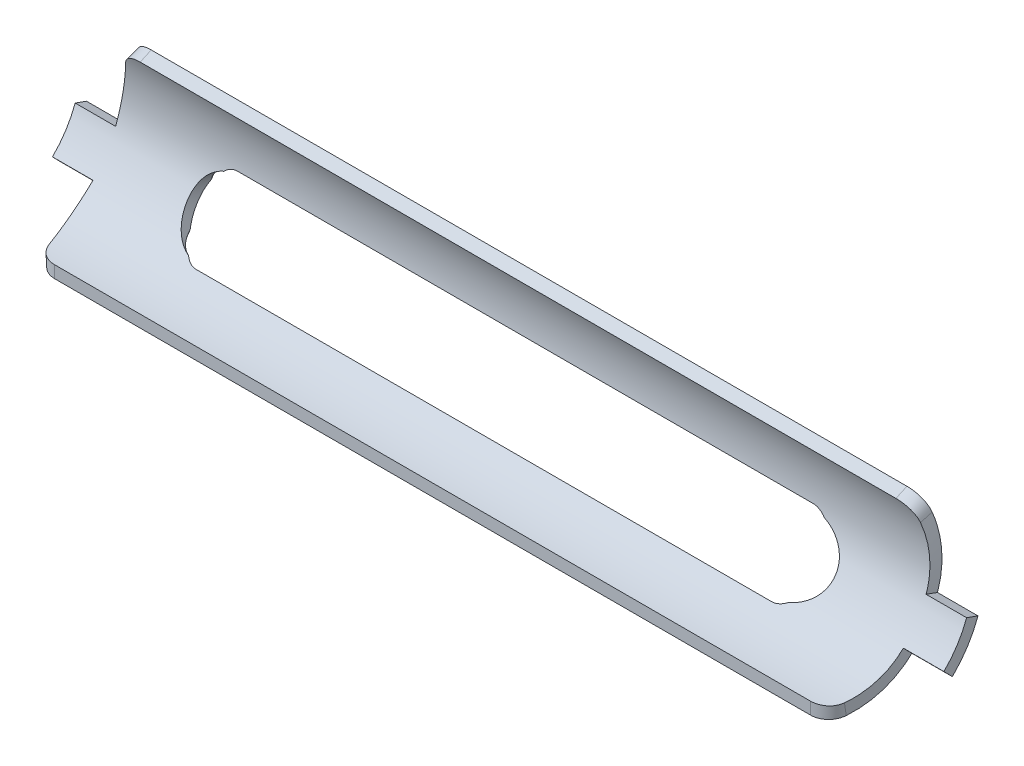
ISO-10303-21;
HEADER;
FILE_DESCRIPTION(('STEP AP214'),'2;1');
FILE_NAME('part.step','',(''),(''),'','','');
FILE_SCHEMA(('AUTOMOTIVE_DESIGN { 1 0 10303 214 1 1 1 1 }'));
ENDSEC;
DATA;
#1=APPLICATION_CONTEXT('core data for automotive mechanical design processes');
#2=APPLICATION_PROTOCOL_DEFINITION('international standard','automotive_design',2000,#1);
#3=PRODUCT_CONTEXT('',#1,'mechanical');
#4=PRODUCT('Part','Part','',(#3));
#5=PRODUCT_RELATED_PRODUCT_CATEGORY('part','',(#4));
#6=PRODUCT_DEFINITION_FORMATION('','',#4);
#7=PRODUCT_DEFINITION_CONTEXT('part definition',#1,'design');
#8=PRODUCT_DEFINITION('design','',#6,#7);
#9=PRODUCT_DEFINITION_SHAPE('','',#8);
#10=(LENGTH_UNIT() NAMED_UNIT(*) SI_UNIT(.MILLI.,.METRE.));
#11=(NAMED_UNIT(*) PLANE_ANGLE_UNIT() SI_UNIT($,.RADIAN.));
#12=(NAMED_UNIT(*) SI_UNIT($,.STERADIAN.) SOLID_ANGLE_UNIT());
#13=UNCERTAINTY_MEASURE_WITH_UNIT(LENGTH_MEASURE(1.E-05),#10,'distance_accuracy_value','');
#14=(GEOMETRIC_REPRESENTATION_CONTEXT(3) GLOBAL_UNCERTAINTY_ASSIGNED_CONTEXT((#13)) GLOBAL_UNIT_ASSIGNED_CONTEXT((#10,
#11,#12)) REPRESENTATION_CONTEXT('',''));
#15=CARTESIAN_POINT('',(0.,0.,0.));
#16=DIRECTION('',(0.,0.,1.));
#17=DIRECTION('',(1.,0.,0.));
#18=AXIS2_PLACEMENT_3D('',#15,#16,#17);
#19=CARTESIAN_POINT('',(-18.034,-59.7868010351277,33.6653794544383));
#20=DIRECTION('',(0.,0.840764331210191,-0.54140127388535));
#21=DIRECTION('',(0.,0.54140127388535,0.840764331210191));
#22=AXIS2_PLACEMENT_3D('',#19,#20,#21);
#23=CYLINDRICAL_SURFACE('',#22,2.286);
#24=CARTESIAN_POINT('',(-18.034,7.02089103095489,-6.63577073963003));
#25=CARTESIAN_POINT('',(-18.0776048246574,7.02090493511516,-6.63576579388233));
#26=CARTESIAN_POINT('',(-18.1212021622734,7.01877280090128,-6.63589021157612));
#27=CARTESIAN_POINT('',(-18.2079587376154,7.01032336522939,-6.63636124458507));
#28=CARTESIAN_POINT('',(-18.2511182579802,7.00400896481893,-6.63670770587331));
#29=CARTESIAN_POINT('',(-18.3362802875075,6.98737143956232,-6.63758271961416));
#30=CARTESIAN_POINT('',(-18.3782894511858,6.97708225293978,-6.63810972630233));
#31=CARTESIAN_POINT('',(-18.4611753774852,6.95269370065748,-6.63928003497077));
#32=CARTESIAN_POINT('',(-18.5020520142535,6.93859391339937,-6.63992334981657));
#33=CARTESIAN_POINT('',(-18.6223316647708,6.890996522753,-6.64190458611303));
#34=CARTESIAN_POINT('',(-18.6996716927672,6.85214265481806,-6.64329773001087));
#35=CARTESIAN_POINT('',(-18.8471075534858,6.762466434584,-6.64546971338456));
#36=CARTESIAN_POINT('',(-18.9171887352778,6.71162053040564,-6.64624733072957));
#37=CARTESIAN_POINT('',(-19.0713668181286,6.58191049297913,-6.64643149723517));
#38=CARTESIAN_POINT('',(-19.1523533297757,6.49935568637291,-6.64529488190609));
#39=CARTESIAN_POINT('',(-19.300271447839,6.32266382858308,-6.63903718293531));
#40=CARTESIAN_POINT('',(-19.3671792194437,6.22850755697,-6.63390941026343));
#41=CARTESIAN_POINT('',(-19.4727579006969,6.05789456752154,-6.62063803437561));
#42=CARTESIAN_POINT('',(-19.5142742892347,5.98306870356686,-6.61360093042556));
#43=CARTESIAN_POINT('',(-19.5910228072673,5.83055927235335,-6.5965251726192));
#44=CARTESIAN_POINT('',(-19.6262518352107,5.75287431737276,-6.58648504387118));
#45=CARTESIAN_POINT('',(-19.6911945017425,5.59557340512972,-6.5632297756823));
#46=CARTESIAN_POINT('',(-19.7208993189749,5.51595458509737,-6.55000963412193));
#47=CARTESIAN_POINT('',(-19.775444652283,5.35565400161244,-6.52031801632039));
#48=CARTESIAN_POINT('',(-19.8002835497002,5.27497189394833,-6.50384546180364));
#49=CARTESIAN_POINT('',(-19.8589651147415,5.06609346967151,-6.45707052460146));
#50=CARTESIAN_POINT('',(-19.8896424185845,4.93755427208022,-6.42429669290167));
#51=CARTESIAN_POINT('',(-19.9426101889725,4.68108777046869,-6.35054304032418));
#52=CARTESIAN_POINT('',(-19.9648958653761,4.55316085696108,-6.30955855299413));
#53=CARTESIAN_POINT('',(-20.0027546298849,4.29904553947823,-6.2194996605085));
#54=CARTESIAN_POINT('',(-20.0183209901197,4.17285899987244,-6.17041721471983));
#55=CARTESIAN_POINT('',(-20.0439381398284,3.92328971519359,-6.06441781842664));
#56=CARTESIAN_POINT('',(-20.0539898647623,3.7999064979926,-6.00750219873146));
#57=CARTESIAN_POINT('',(-20.0697786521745,3.55084811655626,-5.88319626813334));
#58=CARTESIAN_POINT('',(-20.0752878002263,3.42534298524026,-5.8154365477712));
#59=CARTESIAN_POINT('',(-20.0816829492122,3.17885646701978,-5.6719214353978));
#60=CARTESIAN_POINT('',(-20.0825684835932,3.05787553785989,-5.59616523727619));
#61=CARTESIAN_POINT('',(-20.0797978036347,2.82107473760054,-5.43704809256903));
#62=CARTESIAN_POINT('',(-20.0761415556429,2.7052549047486,-5.35368708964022));
#63=CARTESIAN_POINT('',(-20.0639468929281,2.47938621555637,-5.17982651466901));
#64=CARTESIAN_POINT('',(-20.0554091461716,2.36933657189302,-5.08932792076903));
#65=CARTESIAN_POINT('',(-20.033934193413,2.16751328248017,-4.91221744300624));
#66=CARTESIAN_POINT('',(-20.0215933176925,2.07506967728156,-4.82629638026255));
#67=CARTESIAN_POINT('',(-19.9915702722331,1.89563136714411,-4.64977580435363));
#68=CARTESIAN_POINT('',(-19.9738873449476,1.80863743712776,-4.55917562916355));
#69=CARTESIAN_POINT('',(-19.9320364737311,1.64074527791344,-4.37417470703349));
#70=CARTESIAN_POINT('',(-19.9078796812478,1.55983687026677,-4.27978073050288));
#71=CARTESIAN_POINT('',(-19.8515562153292,1.4045525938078,-4.08811489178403));
#72=CARTESIAN_POINT('',(-19.8193942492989,1.33017292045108,-3.99084475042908));
#73=CARTESIAN_POINT('',(-19.7386035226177,1.17600069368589,-3.77748839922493));
#74=CARTESIAN_POINT('',(-19.6880693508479,1.09757369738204,-3.66111419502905));
#75=CARTESIAN_POINT('',(-19.5696181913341,0.951905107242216,-3.43012787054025));
#76=CARTESIAN_POINT('',(-19.5017230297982,0.884649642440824,-3.3155137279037));
#77=CARTESIAN_POINT('',(-19.3636785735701,0.777519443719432,-3.12089887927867));
#78=CARTESIAN_POINT('',(-19.2980261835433,0.734953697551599,-3.03921928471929));
#79=CARTESIAN_POINT('',(-19.1531919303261,0.657889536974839,-2.88439359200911));
#80=CARTESIAN_POINT('',(-19.0740289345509,0.623380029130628,-2.81123582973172));
#81=CARTESIAN_POINT('',(-18.9211121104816,0.569870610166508,-2.69324976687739));
#82=CARTESIAN_POINT('',(-18.8500468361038,0.549128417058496,-2.64573615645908));
#83=CARTESIAN_POINT('',(-18.7004001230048,0.513352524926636,-2.56171468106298));
#84=CARTESIAN_POINT('',(-18.6218345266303,0.49830711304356,-2.52518426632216));
#85=CARTESIAN_POINT('',(-18.5003793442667,0.480316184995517,-2.48077148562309));
#86=CARTESIAN_POINT('',(-18.4596376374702,0.475106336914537,-2.46776239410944));
#87=CARTESIAN_POINT('',(-18.3770338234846,0.466146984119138,-2.44523826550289));
#88=CARTESIAN_POINT('',(-18.3351718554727,0.462397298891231,-2.43572279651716));
#89=CARTESIAN_POINT('',(-18.2503149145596,0.456354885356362,-2.42032781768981));
#90=CARTESIAN_POINT('',(-18.2073133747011,0.454074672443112,-2.41447955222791));
#91=CARTESIAN_POINT('',(-18.1208772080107,0.451030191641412,-2.40665099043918));
#92=CARTESIAN_POINT('',(-18.0774423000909,0.450266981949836,-2.40467339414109));
#93=CARTESIAN_POINT('',(-18.034,0.450268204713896,-2.40468785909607));
#94=B_SPLINE_CURVE_WITH_KNOTS('',3,(#24,#25,#26,#27,#28,#29,#30,#31,#32,#33,#34,#35,#36,#37,#38,
#39,#40,#41,#42,#43,#44,#45,#46,#47,#48,#49,#50,#51,#52,#53,#54,#55,#56,#57,#58,#59,#60,#61,#62,
#63,#64,#65,#66,#67,#68,#69,#70,#71,#72,#73,#74,#75,#76,#77,#78,#79,#80,#81,#82,#83,#84,#85,#86,
#87,#88,#89,#90,#91,#92,#93),.UNSPECIFIED.,.F.,.F.,(4,2,2,2,2,2,2,2,2,2,2,2,2,2,2,2,2,2,2,2,2,2,
2,2,2,2,2,2,2,2,2,2,2,2,4),(0.,0.130749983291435,0.261409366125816,0.39097694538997,
0.52055886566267,0.778856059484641,1.03766482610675,1.38270754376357,1.72832978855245,
1.98557122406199,2.24293920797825,2.5007147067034,2.75857580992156,3.16640876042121,
3.57447416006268,3.98294720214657,4.39135093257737,4.81917621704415,5.24704467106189,
5.67491629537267,6.10272938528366,6.48286526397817,6.86305507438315,7.24259415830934,
7.62191058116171,8.06824612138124,8.51402326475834,8.85223769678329,9.18998362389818,
9.4528872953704,9.71524745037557,9.84435039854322,9.97343738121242,10.10360974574,
10.2338728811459),.UNSPECIFIED.);
#95=CARTESIAN_POINT('',(-20.0202630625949,2.07269942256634,-4.82243249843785));
#96=VERTEX_POINT('',#95);
#97=CARTESIAN_POINT('',(-18.034,0.450268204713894,-2.40468785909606));
#98=VERTEX_POINT('',#97);
#99=EDGE_CURVE('E235',#96,#98,#94,.T.);
#100=ORIENTED_EDGE('',*,*,#99,.F.);
#101=CARTESIAN_POINT('',(-18.8170146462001,1.92859450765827,-3.52111454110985));
#102=CARTESIAN_POINT('',(-18.8710887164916,1.93013937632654,-3.54554188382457));
#103=CARTESIAN_POINT('',(-18.9241137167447,1.93166592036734,-3.57228407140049));
#104=CARTESIAN_POINT('',(-19.0276916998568,1.93496244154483,-3.63012532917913));
#105=CARTESIAN_POINT('',(-19.0782458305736,1.93673230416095,-3.66122234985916));
#106=CARTESIAN_POINT('',(-19.1762524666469,1.94078377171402,-3.72731675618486));
#107=CARTESIAN_POINT('',(-19.2237223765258,1.943062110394,-3.7622885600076));
#108=CARTESIAN_POINT('',(-19.3156623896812,1.94830656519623,-3.83592587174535));
#109=CARTESIAN_POINT('',(-19.3601323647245,1.95127271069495,-3.87459153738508));
#110=CARTESIAN_POINT('',(-19.4465517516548,1.95806052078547,-3.95582549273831));
#111=CARTESIAN_POINT('',(-19.4884530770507,1.96189440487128,-3.99844381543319));
#112=CARTESIAN_POINT('',(-19.5689259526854,1.97040810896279,-4.08663719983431));
#113=CARTESIAN_POINT('',(-19.6074971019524,1.97508803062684,-4.13221261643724));
#114=CARTESIAN_POINT('',(-19.6813501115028,1.98531112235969,-4.22598289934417));
#115=CARTESIAN_POINT('',(-19.7166263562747,1.99085572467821,-4.27418202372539));
#116=CARTESIAN_POINT('',(-19.7837642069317,2.0030037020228,-4.37275440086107));
#117=CARTESIAN_POINT('',(-19.8156266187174,2.00960682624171,-4.42312713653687));
#118=CARTESIAN_POINT('',(-19.8788958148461,2.02468584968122,-4.53064480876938));
#119=CARTESIAN_POINT('',(-19.9099608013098,2.03328108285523,-4.58797367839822));
#120=CARTESIAN_POINT('',(-19.9680578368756,2.05190565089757,-4.70414899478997));
#121=CARTESIAN_POINT('',(-19.9951042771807,2.0619296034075,-4.76298909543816));
#122=CARTESIAN_POINT('',(-20.0202664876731,2.07270814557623,-4.82246519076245));
#123=B_SPLINE_CURVE_WITH_KNOTS('',3,(#101,#102,#103,#104,#105,#106,#107,#108,#109,#110,#111,
#112,#113,#114,#115,#116,#117,#118,#119,#120,#121,#122),.UNSPECIFIED.,.F.,.F.,(4,2,2,2,2,2,2,2,
2,2,4),(0.,0.178008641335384,0.355933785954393,0.532747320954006,0.709568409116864,
0.889054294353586,1.06856176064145,1.24836978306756,1.42813526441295,1.62527854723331,
1.82169786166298),.UNSPECIFIED.);
#124=CARTESIAN_POINT('',(-18.8170095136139,1.92859432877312,-3.52111220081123));
#125=VERTEX_POINT('',#124);
#126=EDGE_CURVE('E220',#125,#96,#123,.T.);
#127=ORIENTED_EDGE('',*,*,#126,.F.);
#128=CARTESIAN_POINT('',(-18.034,5.75171732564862,-5.8184997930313));
#129=CARTESIAN_POINT('',(-18.0615625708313,5.7517214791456,-5.81849915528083));
#130=CARTESIAN_POINT('',(-18.0891104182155,5.75050678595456,-5.818313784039));
#131=CARTESIAN_POINT('',(-18.1439754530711,5.74568896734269,-5.81757048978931));
#132=CARTESIAN_POINT('',(-18.1712927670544,5.74208725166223,-5.81701278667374));
#133=CARTESIAN_POINT('',(-18.2522240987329,5.72784747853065,-5.81478784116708));
#134=CARTESIAN_POINT('',(-18.3052521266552,5.7137730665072,-5.8125688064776));
#135=CARTESIAN_POINT('',(-18.4081442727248,5.67744332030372,-5.80662210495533));
#136=CARTESIAN_POINT('',(-18.4580145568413,5.65520454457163,-5.80289749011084));
#137=CARTESIAN_POINT('',(-18.5539681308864,5.60381728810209,-5.79388651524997));
#138=CARTESIAN_POINT('',(-18.600044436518,5.57465643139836,-5.78859735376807));
#139=CARTESIAN_POINT('',(-18.7088281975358,5.49558751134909,-5.7735033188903));
#140=CARTESIAN_POINT('',(-18.7690259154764,5.442407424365,-5.76274710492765));
#141=CARTESIAN_POINT('',(-18.8800657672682,5.32780050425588,-5.73761430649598));
#142=CARTESIAN_POINT('',(-18.930887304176,5.26635601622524,-5.7232299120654));
#143=CARTESIAN_POINT('',(-19.046544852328,5.10693359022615,-5.68287978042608));
#144=CARTESIAN_POINT('',(-19.1061440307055,5.00574223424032,-5.65468605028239));
#145=CARTESIAN_POINT('',(-19.2094096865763,4.79799152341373,-5.59024427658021));
#146=CARTESIAN_POINT('',(-19.253043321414,4.69142161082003,-5.55397987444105));
#147=CARTESIAN_POINT('',(-19.3178935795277,4.50346359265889,-5.48368710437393));
#148=CARTESIAN_POINT('',(-19.3419864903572,4.42240394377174,-5.45134544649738));
#149=CARTESIAN_POINT('',(-19.3836416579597,4.26037960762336,-5.38240220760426));
#150=CARTESIAN_POINT('',(-19.4012007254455,4.17941498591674,-5.34579855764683));
#151=CARTESIAN_POINT('',(-19.430464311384,4.01831261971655,-5.26847044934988));
#152=CARTESIAN_POINT('',(-19.4421627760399,3.93817581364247,-5.2277417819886));
#153=CARTESIAN_POINT('',(-19.4601300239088,3.77938693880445,-5.14237523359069));
#154=CARTESIAN_POINT('',(-19.4663982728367,3.70073501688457,-5.09773696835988));
#155=CARTESIAN_POINT('',(-19.4738627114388,3.54291894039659,-5.00328100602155));
#156=CARTESIAN_POINT('',(-19.4748906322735,3.46381855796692,-4.95334347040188));
#157=CARTESIAN_POINT('',(-19.4714631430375,3.30815932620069,-4.84980543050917));
#158=CARTESIAN_POINT('',(-19.4670069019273,3.23160086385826,-4.79620437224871));
#159=CARTESIAN_POINT('',(-19.4524328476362,3.08152931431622,-4.68573535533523));
#160=CARTESIAN_POINT('',(-19.4423202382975,3.00801349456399,-4.62887044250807));
#161=CARTESIAN_POINT('',(-19.4160285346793,2.86443666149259,-4.5123273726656));
#162=CARTESIAN_POINT('',(-19.3998515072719,2.79437448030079,-4.45265018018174));
#163=CARTESIAN_POINT('',(-19.3524623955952,2.62915797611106,-4.30516296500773));
#164=CARTESIAN_POINT('',(-19.3177830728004,2.53597623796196,-4.21616373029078));
#165=CARTESIAN_POINT('',(-19.2534402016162,2.40359414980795,-4.08147441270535));
#166=CARTESIAN_POINT('',(-19.2299484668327,2.36071158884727,-4.03639476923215));
#167=CARTESIAN_POINT('',(-19.1783718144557,2.27767043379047,-3.94636589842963));
#168=CARTESIAN_POINT('',(-19.1502886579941,2.23751080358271,-3.90141662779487));
#169=CARTESIAN_POINT('',(-19.0778298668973,2.14616920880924,-3.79608423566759));
#170=CARTESIAN_POINT('',(-19.0312459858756,2.09630184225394,-3.73604423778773));
#171=CARTESIAN_POINT('',(-18.9271876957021,2.0035363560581,-3.6201106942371));
#172=CARTESIAN_POINT('',(-18.8697299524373,1.96062775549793,-3.56421098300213));
#173=CARTESIAN_POINT('',(-18.759242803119,1.89334400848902,-3.47371569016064));
#174=CARTESIAN_POINT('',(-18.7088661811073,1.86703925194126,-3.43733583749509));
#175=CARTESIAN_POINT('',(-18.6015814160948,1.82006621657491,-3.37106372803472));
#176=CARTESIAN_POINT('',(-18.5446803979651,1.79939187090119,-3.34116449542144));
#177=CARTESIAN_POINT('',(-18.4352707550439,1.76757762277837,-3.29449294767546));
#178=CARTESIAN_POINT('',(-18.3836433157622,1.75541716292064,-3.27635647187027));
#179=CARTESIAN_POINT('',(-18.277487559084,1.73618303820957,-3.24746194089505));
#180=CARTESIAN_POINT('',(-18.2229653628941,1.72909906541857,-3.23668893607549));
#181=CARTESIAN_POINT('',(-18.1456373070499,1.72296611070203,-3.22734261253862));
#182=CARTESIAN_POINT('',(-18.1233739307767,1.72164561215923,-3.22532658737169));
#183=CARTESIAN_POINT('',(-18.07874400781,1.71988390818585,-3.22263491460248));
#184=CARTESIAN_POINT('',(-18.056377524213,1.7194422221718,-3.22195853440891));
#185=CARTESIAN_POINT('',(-18.034,1.71944191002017,-3.2219588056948));
#186=B_SPLINE_CURVE_WITH_KNOTS('',3,(#128,#129,#130,#131,#132,#133,#134,#135,#136,#137,#138,
#139,#140,#141,#142,#143,#144,#145,#146,#147,#148,#149,#150,#151,#152,#153,#154,#155,#156,#157,
#158,#159,#160,#161,#162,#163,#164,#165,#166,#167,#168,#169,#170,#171,#172,#173,#174,#175,#176,
#177,#178,#179,#180,#181,#182,#183,#184,#185),.UNSPECIFIED.,.F.,.F.,(4,2,2,2,2,2,2,2,2,2,2,2,2,
2,2,2,2,2,2,2,2,2,2,2,2,2,2,2,4),(0.,0.0826322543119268,0.165215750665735,0.329096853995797,
0.492647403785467,0.656492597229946,0.898246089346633,1.14052448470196,1.50085107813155,
1.86191478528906,2.13318658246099,2.40459061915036,2.67627443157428,2.94798497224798,
3.22836762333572,3.50879276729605,3.78896034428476,4.06903252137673,4.46798700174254,
4.66733154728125,4.86659980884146,5.13846444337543,5.40991572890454,5.61164902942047,
5.81316409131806,5.98064552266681,6.14778590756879,6.21491899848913,6.28201536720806),.UNSPECIFIED.);
#187=CARTESIAN_POINT('',(-18.034,1.71944191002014,-3.22195880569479));
#188=VERTEX_POINT('',#187);
#189=EDGE_CURVE('E205',#125,#188,#186,.T.);
#190=ORIENTED_EDGE('',*,*,#189,.T.);
#191=DIRECTION('',(0.,0.840764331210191,-0.54140127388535));
#192=VECTOR('',#191,1.);
#193=CARTESIAN_POINT('',(-18.034,-58.5491577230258,35.5873667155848));
#194=LINE('',#193,#192);
#195=EDGE_CURVE('E219',#98,#188,#194,.T.);
#196=ORIENTED_EDGE('',*,*,#195,.F.);
#197=EDGE_LOOP('',(#100,#127,#190,#196));
#198=FACE_BOUND('',#197,.T.);
#199=ADVANCED_FACE('F37',(#198),#23,.F.);
#200=CARTESIAN_POINT('',(18.034,-58.5491577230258,35.5873667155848));
#201=DIRECTION('',(0.,-0.54140127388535,-0.840764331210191));
#202=DIRECTION('',(0.,0.840764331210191,-0.54140127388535));
#203=AXIS2_PLACEMENT_3D('',#200,#201,#202);
#204=PLANE('',#203);
#205=DIRECTION('',(-1.,0.,0.));
#206=VECTOR('',#205,1.);
#207=CARTESIAN_POINT('',(85.1820180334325,0.450268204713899,-2.40468785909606));
#208=LINE('',#207,#206);
#209=CARTESIAN_POINT('',(18.034,0.450268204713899,-2.40468785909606));
#210=VERTEX_POINT('',#209);
#211=EDGE_CURVE('E225',#98,#210,#208,.F.);
#212=ORIENTED_EDGE('',*,*,#211,.F.);
#213=ORIENTED_EDGE('',*,*,#195,.T.);
#214=DIRECTION('',(-1.,0.,0.));
#215=VECTOR('',#214,1.);
#216=CARTESIAN_POINT('',(85.1820180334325,1.71944191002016,-3.22195880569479));
#217=LINE('',#216,#215);
#218=CARTESIAN_POINT('',(18.034,1.71944191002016,-3.22195880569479));
#219=VERTEX_POINT('',#218);
#220=EDGE_CURVE('E202',#188,#219,#217,.F.);
#221=ORIENTED_EDGE('',*,*,#220,.T.);
#222=DIRECTION('',(0.,0.840764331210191,-0.54140127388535));
#223=VECTOR('',#222,1.);
#224=CARTESIAN_POINT('',(18.034,-58.5491577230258,35.5873667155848));
#225=LINE('',#224,#223);
#226=EDGE_CURVE('E230',#210,#219,#225,.T.);
#227=ORIENTED_EDGE('',*,*,#226,.F.);
#228=EDGE_LOOP('',(#212,#213,#221,#227));
#229=FACE_BOUND('',#228,.T.);
#230=ADVANCED_FACE('F224',(#229),#204,.T.);
#231=CARTESIAN_POINT('',(18.034,-59.7868010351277,33.6653794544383));
#232=DIRECTION('',(0.,0.840764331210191,-0.54140127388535));
#233=DIRECTION('',(0.,0.54140127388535,0.840764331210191));
#234=AXIS2_PLACEMENT_3D('',#231,#232,#233);
#235=CYLINDRICAL_SURFACE('',#234,2.286);
#236=CARTESIAN_POINT('',(18.034,0.450268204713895,-2.40468785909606));
#237=CARTESIAN_POINT('',(18.0776048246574,0.450266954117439,-2.4046731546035));
#238=CARTESIAN_POINT('',(18.1212021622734,0.451035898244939,-2.40666569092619));
#239=CARTESIAN_POINT('',(18.2079587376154,0.45410319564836,-2.41455280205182));
#240=CARTESIAN_POINT('',(18.2511182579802,0.456400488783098,-2.42044467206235));
#241=CARTESIAN_POINT('',(18.3362802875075,0.462487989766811,-2.43595322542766));
#242=CARTESIAN_POINT('',(18.3782894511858,0.466265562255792,-2.4455383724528));
#243=CARTESIAN_POINT('',(18.4611753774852,0.475291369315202,-2.46822550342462));
#244=CARTESIAN_POINT('',(18.5020520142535,0.480539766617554,-2.48132787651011));
#245=CARTESIAN_POINT('',(18.6223316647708,0.498430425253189,-2.52547944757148));
#246=CARTESIAN_POINT('',(18.6996716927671,0.513238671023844,-2.56142774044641));
#247=CARTESIAN_POINT('',(18.8471075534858,0.548366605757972,-2.64396603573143));
#248=CARTESIAN_POINT('',(18.9171887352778,0.568697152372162,-2.69057697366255));
#249=CARTESIAN_POINT('',(19.0713668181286,0.622199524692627,-2.80873882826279));
#250=CARTESIAN_POINT('',(19.1523533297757,0.657392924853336,-2.88342492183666));
#251=CARTESIAN_POINT('',(19.300271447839,0.736199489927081,-3.04169272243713));
#252=CARTESIAN_POINT('',(19.3671792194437,0.779826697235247,-3.12528915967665));
#253=CARTESIAN_POINT('',(19.4727579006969,0.862503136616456,-3.27512082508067));
#254=CARTESIAN_POINT('',(19.5142742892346,0.899870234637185,-3.34032918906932));
#255=CARTESIAN_POINT('',(19.5910228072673,0.978519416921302,-3.4721055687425));
#256=CARTESIAN_POINT('',(19.6262518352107,1.0198034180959,-3.53867423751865));
#257=CARTESIAN_POINT('',(19.6911945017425,1.1060608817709,-3.67225580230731));
#258=CARTESIAN_POINT('',(19.7208993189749,1.15104008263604,-3.73926923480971));
#259=CARTESIAN_POINT('',(19.775444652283,1.24439825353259,-3.872918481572));
#260=CARTESIAN_POINT('',(19.8002835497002,1.29277834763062,-3.93955416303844));
#261=CARTESIAN_POINT('',(19.8589651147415,1.42178888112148,-4.11035923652));
#262=CARTESIAN_POINT('',(19.8896424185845,1.50481115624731,-4.21381817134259));
#263=CARTESIAN_POINT('',(19.9426101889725,1.67807310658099,-4.41678359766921));
#264=CARTESIAN_POINT('',(19.9648958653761,1.76831686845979,-4.51628780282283));
#265=CARTESIAN_POINT('',(20.0027546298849,1.95544996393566,-4.71036614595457));
#266=CARTESIAN_POINT('',(20.0183209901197,2.05234584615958,-4.80493525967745));
#267=CARTESIAN_POINT('',(20.0439381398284,2.25210987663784,-4.9882792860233));
#268=CARTESIAN_POINT('',(20.0539898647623,2.3549770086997,-5.07705517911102));
#269=CARTESIAN_POINT('',(20.0697786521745,2.57119557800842,-5.25235940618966));
#270=CARTESIAN_POINT('',(20.0752878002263,2.68481296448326,-5.338580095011));
#271=CARTESIAN_POINT('',(20.0816829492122,2.91745506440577,-5.50359477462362));
#272=CARTESIAN_POINT('',(20.0825684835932,3.03648032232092,-5.58238801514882));
#273=CARTESIAN_POINT('',(20.0797978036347,3.27931857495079,-5.73212935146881));
#274=CARTESIAN_POINT('',(20.0761415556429,3.40313160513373,-5.80307738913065));
#275=CARTESIAN_POINT('',(20.0639468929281,3.65486863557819,-5.93676595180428));
#276=CARTESIAN_POINT('',(20.0554091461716,3.78279207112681,-5.99950759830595));
#277=CARTESIAN_POINT('',(20.033934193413,4.02753850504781,-6.10996095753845));
#278=CARTESIAN_POINT('',(20.0215933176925,4.14400980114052,-6.15856842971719));
#279=CARTESIAN_POINT('',(19.9915702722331,4.37895698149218,-6.24888699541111));
#280=CARTESIAN_POINT('',(19.9738873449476,4.49743314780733,-6.2905971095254));
#281=CARTESIAN_POINT('',(19.9320364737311,4.73532323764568,-6.36689536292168));
#282=CARTESIAN_POINT('',(19.9078796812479,4.85473520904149,-6.40149556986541));
#283=CARTESIAN_POINT('',(19.8515562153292,5.09347616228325,-6.46355809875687));
#284=CARTESIAN_POINT('',(19.819394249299,5.21280515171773,-6.49102459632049));
#285=CARTESIAN_POINT('',(19.7386035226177,5.47083261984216,-6.54309986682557));
#286=CARTESIAN_POINT('',(19.6880693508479,5.60922825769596,-6.56634629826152));
#287=CARTESIAN_POINT('',(19.5696181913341,5.87978718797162,-6.60338527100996));
#288=CARTESIAN_POINT('',(19.5017230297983,6.01195806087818,-6.61718960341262));
#289=CARTESIAN_POINT('',(19.3636785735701,6.23345905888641,-6.63419332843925));
#290=CARTESIAN_POINT('',(19.2980261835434,6.32543107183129,-6.63914789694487));
#291=CARTESIAN_POINT('',(19.1531919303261,6.49826834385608,-6.64524358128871));
#292=CARTESIAN_POINT('',(19.0740289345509,6.57914881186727,-6.64638997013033));
#293=CARTESIAN_POINT('',(18.9211121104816,6.70870172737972,-6.64628495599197));
#294=CARTESIAN_POINT('',(18.8500468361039,6.76053973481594,-6.64550859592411));
#295=CARTESIAN_POINT('',(18.7004001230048,6.85183432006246,-6.64331280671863));
#296=CARTESIAN_POINT('',(18.6218345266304,6.89131627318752,-6.64189471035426));
#297=CARTESIAN_POINT('',(18.5003793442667,6.93919295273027,-6.63989667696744));
#298=CARTESIAN_POINT('',(18.4596376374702,6.95319186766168,-6.63925686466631));
#299=CARTESIAN_POINT('',(18.3770338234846,6.97740452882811,-6.63809350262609));
#300=CARTESIAN_POINT('',(18.3351718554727,6.98761874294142,-6.63756993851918));
#301=CARTESIAN_POINT('',(18.2503149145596,7.00413421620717,-6.63670087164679));
#302=CARTESIAN_POINT('',(18.2073133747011,7.01040185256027,-6.63635690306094));
#303=CARTESIAN_POINT('',(18.1208772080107,7.018788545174,-6.63588932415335));
#304=CARTESIAN_POINT('',(18.0774423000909,7.02090470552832,-6.63576586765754));
#305=CARTESIAN_POINT('',(18.034,7.0208910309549,-6.63577073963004));
#306=B_SPLINE_CURVE_WITH_KNOTS('',3,(#236,#237,#238,#239,#240,#241,#242,#243,#244,#245,#246,
#247,#248,#249,#250,#251,#252,#253,#254,#255,#256,#257,#258,#259,#260,#261,#262,#263,#264,#265,
#266,#267,#268,#269,#270,#271,#272,#273,#274,#275,#276,#277,#278,#279,#280,#281,#282,#283,#284,
#285,#286,#287,#288,#289,#290,#291,#292,#293,#294,#295,#296,#297,#298,#299,#300,#301,#302,#303,
#304,#305),.UNSPECIFIED.,.F.,.F.,(4,2,2,2,2,2,2,2,2,2,2,2,2,2,2,2,2,2,2,2,2,2,2,2,2,2,2,2,2,2,2,
2,2,2,4),(0.,0.130749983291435,0.261409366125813,0.39097694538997,0.52055886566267,
0.778856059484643,1.03766482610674,1.38270754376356,1.72832978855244,1.98557122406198,
2.24293920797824,2.50071470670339,2.75857580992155,3.16640876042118,3.57447416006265,
3.98294720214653,4.39135093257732,4.8191762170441,5.24704467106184,5.67491629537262,
6.10272938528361,6.48286526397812,6.86305507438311,7.2425941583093,7.62191058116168,
8.06824612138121,8.5140232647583,8.85223769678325,9.18998362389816,9.45288729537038,
9.71524745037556,9.84435039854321,9.97343738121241,10.1036097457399,10.2338728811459),.UNSPECIFIED.);
#307=CARTESIAN_POINT('',(20.0202636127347,2.07270522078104,-4.82243794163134));
#308=VERTEX_POINT('',#307);
#309=EDGE_CURVE('E515',#210,#308,#306,.T.);
#310=ORIENTED_EDGE('',*,*,#309,.F.);
#311=ORIENTED_EDGE('',*,*,#226,.T.);
#312=CARTESIAN_POINT('',(18.034,1.71944191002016,-3.22195880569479));
#313=CARTESIAN_POINT('',(18.0615625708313,1.71944077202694,-3.22195476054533));
#314=CARTESIAN_POINT('',(18.0891104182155,1.72011213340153,-3.22298389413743));
#315=CARTESIAN_POINT('',(18.1439754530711,1.72278228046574,-3.22706239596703));
#316=CARTESIAN_POINT('',(18.1712927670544,1.72478028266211,-3.23011057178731));
#317=CARTESIAN_POINT('',(18.2522240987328,1.73269781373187,-3.24215358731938));
#318=CARTESIAN_POINT('',(18.3052521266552,1.74054154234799,-3.25404850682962));
#319=CARTESIAN_POINT('',(18.4081442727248,1.76098744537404,-3.28466188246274));
#320=CARTESIAN_POINT('',(18.4580145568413,1.77357998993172,-3.30336652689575));
#321=CARTESIAN_POINT('',(18.5539681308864,1.80304588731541,-3.34642008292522));
#322=CARTESIAN_POINT('',(18.600044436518,1.81992691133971,-3.37077910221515));
#323=CARTESIAN_POINT('',(18.7088281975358,1.86638453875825,-3.4365165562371));
#324=CARTESIAN_POINT('',(18.7690259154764,1.89818108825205,-3.48048014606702));
#325=CARTESIAN_POINT('',(18.8800657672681,1.96848235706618,-3.57441701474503));
#326=CARTESIAN_POINT('',(18.9308873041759,2.00700149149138,-3.62440313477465));
#327=CARTESIAN_POINT('',(19.046544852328,2.10969962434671,-3.7528427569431));
#328=CARTESIAN_POINT('',(19.1061440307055,2.17723656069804,-3.83329982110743));
#329=CARTESIAN_POINT('',(19.2094096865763,2.3218640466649,-3.99576824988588));
#330=CARTESIAN_POINT('',(19.253043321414,2.39897385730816,-4.07778245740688));
#331=CARTESIAN_POINT('',(19.3178935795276,2.54073837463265,-4.21981101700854));
#332=CARTESIAN_POINT('',(19.3419864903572,2.60372162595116,-4.28022425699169));
#333=CARTESIAN_POINT('',(19.3836416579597,2.73352699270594,-4.39920166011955));
#334=CARTESIAN_POINT('',(19.4012007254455,2.80035096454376,-4.45776490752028));
#335=CARTESIAN_POINT('',(19.430464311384,2.93740828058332,-4.57243356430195));
#336=CARTESIAN_POINT('',(19.4421627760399,3.0076450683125,-4.62853637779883));
#337=CARTESIAN_POINT('',(19.4601300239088,3.1510631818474,-4.73777281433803));
#338=CARTESIAN_POINT('',(19.4663982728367,3.22424479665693,-4.79090614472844));
#339=CARTESIAN_POINT('',(19.4738627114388,3.37553523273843,-4.89549604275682));
#340=CARTESIAN_POINT('',(19.4748906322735,3.45372676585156,-4.94684496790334));
#341=CARTESIAN_POINT('',(19.4714631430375,3.61239292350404,-5.0457134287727));
#342=CARTESIAN_POINT('',(19.4670069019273,3.69286789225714,-5.09323238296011));
#343=CARTESIAN_POINT('',(19.4524328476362,3.85553187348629,-5.18414609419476));
#344=CARTESIAN_POINT('',(19.4423202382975,3.93771924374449,-5.22754459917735));
#345=CARTESIAN_POINT('',(19.4160285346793,4.10322561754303,-5.31003238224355));
#346=CARTESIAN_POINT('',(19.3998515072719,4.18654422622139,-5.34912312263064));
#347=CARTESIAN_POINT('',(19.3524623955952,4.3891754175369,-5.43850752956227));
#348=CARTESIAN_POINT('',(19.3177830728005,4.50875444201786,-5.48651333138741));
#349=CARTESIAN_POINT('',(19.2534402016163,4.68614878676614,-5.55130126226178));
#350=CARTESIAN_POINT('',(19.2299484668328,4.74493196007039,-5.57168819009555));
#351=CARTESIAN_POINT('',(19.1783718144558,4.86125248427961,-5.61003615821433));
#352=CARTESIAN_POINT('',(19.1502886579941,4.91879030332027,-5.62799812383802));
#353=CARTESIAN_POINT('',(19.0778298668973,5.05247734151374,-5.66757053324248));
#354=CARTESIAN_POINT('',(19.0312459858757,5.12777024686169,-5.68812616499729));
#355=CARTESIAN_POINT('',(18.9271876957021,5.27169754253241,-5.72460842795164));
#356=CARTESIAN_POINT('',(18.8697299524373,5.34034188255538,-5.74054204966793));
#357=CARTESIAN_POINT('',(18.7592428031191,5.45056709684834,-5.76435176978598));
#358=CARTESIAN_POINT('',(18.7088661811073,5.49457075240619,-5.77324627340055));
#359=CARTESIAN_POINT('',(18.6015814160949,5.57433967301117,-5.78858830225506));
#360=CARTESIAN_POINT('',(18.5446803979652,5.61011379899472,-5.79503846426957));
#361=CARTESIAN_POINT('',(18.4352707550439,5.66576648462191,-5.8046903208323));
#362=CARTESIAN_POINT('',(18.3836433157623,5.68730922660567,-5.80825666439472));
#363=CARTESIAN_POINT('',(18.2774875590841,5.72157277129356,-5.81381139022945));
#364=CARTESIAN_POINT('',(18.2229653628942,5.73431144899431,-5.81580297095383));
#365=CARTESIAN_POINT('',(18.14563730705,5.74535779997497,-5.8175190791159));
#366=CARTESIAN_POINT('',(18.1233739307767,5.74773953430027,-5.81788706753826));
#367=CARTESIAN_POINT('',(18.0787440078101,5.75091892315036,-5.8183771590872));
#368=CARTESIAN_POINT('',(18.056377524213,5.75171744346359,-5.81849939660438));
#369=CARTESIAN_POINT('',(18.034,5.75171732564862,-5.81849979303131));
#370=B_SPLINE_CURVE_WITH_KNOTS('',3,(#312,#313,#314,#315,#316,#317,#318,#319,#320,#321,#322,
#323,#324,#325,#326,#327,#328,#329,#330,#331,#332,#333,#334,#335,#336,#337,#338,#339,#340,#341,
#342,#343,#344,#345,#346,#347,#348,#349,#350,#351,#352,#353,#354,#355,#356,#357,#358,#359,#360,
#361,#362,#363,#364,#365,#366,#367,#368,#369),.UNSPECIFIED.,.F.,.F.,(4,2,2,2,2,2,2,2,2,2,2,2,2,
2,2,2,2,2,2,2,2,2,2,2,2,2,2,2,4),(0.,0.0826322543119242,0.16521575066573,0.329096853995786,
0.492647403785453,0.656492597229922,0.89824608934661,1.14052448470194,1.50085107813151,
1.86191478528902,2.13318658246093,2.40459061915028,2.67627443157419,2.94798497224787,
3.2283676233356,3.50879276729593,3.78896034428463,4.06903252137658,4.46798700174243,
4.66733154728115,4.86659980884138,5.13846444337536,5.40991572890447,5.6116490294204,
5.813164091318,5.98064552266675,6.14778590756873,6.21491899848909,6.28201536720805),.UNSPECIFIED.);
#371=CARTESIAN_POINT('',(18.8170075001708,1.92859492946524,-3.5211111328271));
#372=VERTEX_POINT('',#371);
#373=EDGE_CURVE('E209',#219,#372,#370,.T.);
#374=ORIENTED_EDGE('',*,*,#373,.T.);
#375=CARTESIAN_POINT('',(20.0202672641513,2.0727138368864,-4.82247047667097));
#376=CARTESIAN_POINT('',(19.9958961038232,2.06227502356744,-4.76486615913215));
#377=CARTESIAN_POINT('',(19.9697607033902,2.05254155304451,-4.70786110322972));
#378=CARTESIAN_POINT('',(19.9137242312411,2.03440604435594,-4.59522020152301));
#379=CARTESIAN_POINT('',(19.8838081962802,2.02600961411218,-4.53959090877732));
#380=CARTESIAN_POINT('',(19.8198063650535,2.01046519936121,-4.42972486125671));
#381=CARTESIAN_POINT('',(19.7856767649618,2.00333260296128,-4.37551133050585));
#382=CARTESIAN_POINT('',(19.7134719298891,1.99029001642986,-4.26959466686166));
#383=CARTESIAN_POINT('',(19.6753954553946,1.98438041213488,-4.21789233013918));
#384=CARTESIAN_POINT('',(19.595434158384,1.97355174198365,-4.11756083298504));
#385=CARTESIAN_POINT('',(19.55355645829,1.96863087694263,-4.06892620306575));
#386=CARTESIAN_POINT('',(19.4659593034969,1.95977615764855,-3.97515616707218));
#387=CARTESIAN_POINT('',(19.4202407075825,1.95584208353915,-3.93001998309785));
#388=CARTESIAN_POINT('',(19.3315548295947,1.94937486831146,-3.84965380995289));
#389=CARTESIAN_POINT('',(19.2890597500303,1.94672393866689,-3.8139116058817));
#390=CARTESIAN_POINT('',(19.2014433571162,1.9420039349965,-3.74576509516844));
#391=CARTESIAN_POINT('',(19.1563223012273,1.93993480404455,-3.71336046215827));
#392=CARTESIAN_POINT('',(19.063421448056,1.93621035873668,-3.6520169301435));
#393=CARTESIAN_POINT('',(19.0156288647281,1.93455728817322,-3.62309724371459));
#394=CARTESIAN_POINT('',(18.9178705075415,1.93146648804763,-3.56913455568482));
#395=CARTESIAN_POINT('',(18.8679038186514,1.9300288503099,-3.54409320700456));
#396=CARTESIAN_POINT('',(18.8170037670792,1.92859310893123,-3.52110892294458));
#397=B_SPLINE_CURVE_WITH_KNOTS('',3,(#375,#376,#377,#378,#379,#380,#381,#382,#383,#384,#385,
#386,#387,#388,#389,#390,#391,#392,#393,#394,#395,#396),.UNSPECIFIED.,.F.,.F.,(4,2,2,2,2,2,2,2,
2,2,4),(0.,0.190233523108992,0.381245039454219,0.574442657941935,0.767701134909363,
0.960604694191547,1.15346523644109,1.32008141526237,1.48668128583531,1.654161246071,
1.82171238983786),.UNSPECIFIED.);
#398=EDGE_CURVE('E507',#308,#372,#397,.T.);
#399=ORIENTED_EDGE('',*,*,#398,.F.);
#400=EDGE_LOOP('',(#310,#311,#374,#399));
#401=FACE_BOUND('',#400,.T.);
#402=ADVANCED_FACE('F483',(#401),#235,.F.);
#403=CARTESIAN_POINT('',(17.9324,1.21307622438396,-3.82798432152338));
#404=CARTESIAN_POINT('',(17.9803181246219,1.21357053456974,-3.82868592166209));
#405=CARTESIAN_POINT('',(18.0237791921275,1.21440571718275,-3.82987118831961));
#406=CARTESIAN_POINT('',(18.0822852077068,1.21617122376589,-3.8323735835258));
#407=CARTESIAN_POINT('',(18.1006729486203,1.21684519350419,-3.83332845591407));
#408=CARTESIAN_POINT('',(18.1265831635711,1.21798463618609,-3.83494167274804));
#409=CARTESIAN_POINT('',(18.1349413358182,1.21838586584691,-3.83550956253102));
#410=CARTESIAN_POINT('',(18.1470607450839,1.21901987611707,-3.83640659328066));
#411=CARTESIAN_POINT('',(18.1510309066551,1.21923657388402,-3.83671313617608));
#412=CARTESIAN_POINT('',(18.1568816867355,1.21956966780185,-3.83718424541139));
#413=CARTESIAN_POINT('',(18.158814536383,1.21968204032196,-3.83734316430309));
#414=CARTESIAN_POINT('',(18.1626454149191,1.21990946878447,-3.83766476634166));
#415=CARTESIAN_POINT('',(18.1639666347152,1.21998882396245,-3.83777697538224));
#416=CARTESIAN_POINT('',(18.24506174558,1.22500808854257,-3.84487326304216));
#417=CARTESIAN_POINT('',(18.3213416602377,1.23199979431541,-3.85473830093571));
#418=CARTESIAN_POINT('',(18.475047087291,1.25106409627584,-3.88137667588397));
#419=CARTESIAN_POINT('',(18.5507979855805,1.26293753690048,-3.89786932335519));
#420=CARTESIAN_POINT('',(18.700096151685,1.29154189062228,-3.93707304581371));
#421=CARTESIAN_POINT('',(18.7729682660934,1.30809322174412,-3.959544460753));
#422=CARTESIAN_POINT('',(19.1385712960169,1.40538949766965,-4.08938910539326));
#423=CARTESIAN_POINT('',(19.3968159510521,1.51889174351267,-4.23563711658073));
#424=CARTESIAN_POINT('',(19.8445445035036,1.83755170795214,-4.59422445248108));
#425=CARTESIAN_POINT('',(20.0170916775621,2.03106550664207,-4.79283521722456));
#426=CARTESIAN_POINT('',(20.2594112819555,2.50254257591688,-5.20585868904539));
#427=CARTESIAN_POINT('',(20.3199941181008,2.76279535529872,-5.40434565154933));
#428=CARTESIAN_POINT('',(20.3200058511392,3.33320901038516,-5.77165715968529));
#429=CARTESIAN_POINT('',(20.2593950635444,3.62159424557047,-5.92645920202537));
#430=CARTESIAN_POINT('',(20.0171042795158,4.19268240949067,-6.1847847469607));
#431=CARTESIAN_POINT('',(19.8445285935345,4.45355845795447,-6.27877541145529));
#432=CARTESIAN_POINT('',(19.5087509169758,4.79729563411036,-6.38507558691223));
#433=CARTESIAN_POINT('',(19.3882386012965,4.89966756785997,-6.41338041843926));
#434=CARTESIAN_POINT('',(19.1945904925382,5.033930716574,-6.44794853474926));
#435=CARTESIAN_POINT('',(19.1278945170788,5.07547445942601,-6.45814962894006));
#436=CARTESIAN_POINT('',(18.9902093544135,5.15202960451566,-6.47629142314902));
#437=CARTESIAN_POINT('',(18.9182552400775,5.18745947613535,-6.48432417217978));
#438=CARTESIAN_POINT('',(18.5574009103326,5.34388692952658,-6.51872672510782));
#439=CARTESIAN_POINT('',(18.2528393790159,5.40785946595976,-6.52992588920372));
#440=CARTESIAN_POINT('',(17.9324,5.40952133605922,-6.53024064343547));
#441=CARTESIAN_POINT('',(17.9324,1.83392101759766,-3.39057006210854));
#442=CARTESIAN_POINT('',(17.9803181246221,1.83435884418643,-3.39119149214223));
#443=CARTESIAN_POINT('',(18.0237791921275,1.8350985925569,-3.39224132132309));
#444=CARTESIAN_POINT('',(18.0822852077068,1.83666235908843,-3.39445777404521));
#445=CARTESIAN_POINT('',(18.1006729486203,1.83725931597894,-3.39530353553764));
#446=CARTESIAN_POINT('',(18.1265831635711,1.83826855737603,-3.39673241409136));
#447=CARTESIAN_POINT('',(18.1349413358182,1.8386239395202,-3.39723541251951));
#448=CARTESIAN_POINT('',(18.1470607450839,1.83918550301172,-3.39802994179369));
#449=CARTESIAN_POINT('',(18.1510309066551,1.83937743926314,-3.39830145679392));
#450=CARTESIAN_POINT('',(18.1568816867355,1.8396724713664,-3.39871873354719));
#451=CARTESIAN_POINT('',(18.158814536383,1.83977200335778,-3.39885949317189));
#452=CARTESIAN_POINT('',(18.1626454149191,1.83997344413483,-3.3991443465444));
#453=CARTESIAN_POINT('',(18.1639666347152,1.84004373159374,-3.39924373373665));
#454=CARTESIAN_POINT('',(18.24506174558,1.84448945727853,-3.4055291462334));
#455=CARTESIAN_POINT('',(18.3213416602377,1.85068223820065,-3.41426693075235));
#456=CARTESIAN_POINT('',(18.475047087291,1.86756810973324,-3.43786140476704));
#457=CARTESIAN_POINT('',(18.5507979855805,1.87808480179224,-3.45246947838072));
#458=CARTESIAN_POINT('',(18.700096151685,1.90342060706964,-3.48719348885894));
#459=CARTESIAN_POINT('',(18.7729682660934,1.91808065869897,-3.50709715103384));
#460=CARTESIAN_POINT('',(19.1385712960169,2.00425913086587,-3.62210477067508));
#461=CARTESIAN_POINT('',(19.3968159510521,2.10479175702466,-3.75164138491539));
#462=CARTESIAN_POINT('',(19.8445445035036,2.38703923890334,-4.06925383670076));
#463=CARTESIAN_POINT('',(20.0170916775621,2.55844069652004,-4.24516984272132));
#464=CARTESIAN_POINT('',(20.2594112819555,2.97604325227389,-4.61099814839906));
#465=CARTESIAN_POINT('',(20.3199941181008,3.20655759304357,-4.78680449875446));
#466=CARTESIAN_POINT('',(20.3200058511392,3.7117914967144,-5.11214423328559));
#467=CARTESIAN_POINT('',(20.2593950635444,3.96722366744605,-5.24925743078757));
#468=CARTESIAN_POINT('',(20.0171042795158,4.47305500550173,-5.47806475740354));
#469=CARTESIAN_POINT('',(19.8445285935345,4.70412139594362,-5.56131534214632));
#470=CARTESIAN_POINT('',(19.5087509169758,5.0085805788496,-5.65546886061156));
#471=CARTESIAN_POINT('',(19.3882386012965,5.09925472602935,-5.68053936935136));
#472=CARTESIAN_POINT('',(19.1945904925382,5.21817595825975,-5.71115747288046));
#473=CARTESIAN_POINT('',(19.1278945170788,5.25497260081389,-5.72019291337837));
#474=CARTESIAN_POINT('',(18.9902093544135,5.32277997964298,-5.73626168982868));
#475=CARTESIAN_POINT('',(18.9182552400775,5.3541613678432,-5.74337655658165));
#476=CARTESIAN_POINT('',(18.5574009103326,5.49271424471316,-5.77384801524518));
#477=CARTESIAN_POINT('',(18.2528393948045,5.54937679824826,-5.78376747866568));
#478=CARTESIAN_POINT('',(17.9324,5.5508487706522,-5.78404626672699));
#479=B_SPLINE_SURFACE_WITH_KNOTS('',1,3,((#403,#404,#405,#406,#407,#408,#409,#410,#411,#412,
#413,#414,#415,#416,#417,#418,#419,#420,#421,#422,#423,#424,#425,#426,#427,#428,#429,#430,#431,
#432,#433,#434,#435,#436,#437,#438,#439,#440),(#441,#442,#443,#444,#445,#446,#447,#448,#449,
#450,#451,#452,#453,#454,#455,#456,#457,#458,#459,#460,#461,#462,#463,#464,#465,#466,#467,#468,
#469,#470,#471,#472,#473,#474,#475,#476,#477,#478)),.UNSPECIFIED.,.F.,.F.,.F.,(2,2),(4,2,2,2,2,
2,2,2,2,2,2,2,2,2,2,2,2,2,4),(0.,1.),(0.,0.015625,0.0234375,0.02734375,0.029296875,0.0302734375,
0.03125,0.0625,0.09375,0.125,0.25,0.375,0.5,0.625,0.75,0.8125,0.84375,0.875,1.),.UNSPECIFIED.);
#480=CARTESIAN_POINT('',(17.9324,1.83392101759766,-3.39057006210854));
#481=CARTESIAN_POINT('',(17.9803181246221,1.83435884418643,-3.39119149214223));
#482=CARTESIAN_POINT('',(18.0237791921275,1.8350985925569,-3.39224132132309));
#483=CARTESIAN_POINT('',(18.0822852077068,1.83666235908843,-3.39445777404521));
#484=CARTESIAN_POINT('',(18.1006729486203,1.83725931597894,-3.39530353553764));
#485=CARTESIAN_POINT('',(18.1265831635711,1.83826855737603,-3.39673241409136));
#486=CARTESIAN_POINT('',(18.1349413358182,1.8386239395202,-3.39723541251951));
#487=CARTESIAN_POINT('',(18.1470607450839,1.83918550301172,-3.39802994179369));
#488=CARTESIAN_POINT('',(18.1510309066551,1.83937743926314,-3.39830145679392));
#489=CARTESIAN_POINT('',(18.1568816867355,1.8396724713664,-3.39871873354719));
#490=CARTESIAN_POINT('',(18.158814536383,1.83977200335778,-3.39885949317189));
#491=CARTESIAN_POINT('',(18.1626454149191,1.83997344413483,-3.3991443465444));
#492=CARTESIAN_POINT('',(18.1639666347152,1.84004373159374,-3.39924373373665));
#493=CARTESIAN_POINT('',(18.24506174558,1.84448945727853,-3.4055291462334));
#494=CARTESIAN_POINT('',(18.3213416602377,1.85068223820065,-3.41426693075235));
#495=CARTESIAN_POINT('',(18.475047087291,1.86756810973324,-3.43786140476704));
#496=CARTESIAN_POINT('',(18.5507979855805,1.87808480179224,-3.45246947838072));
#497=CARTESIAN_POINT('',(18.700096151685,1.90342060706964,-3.48719348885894));
#498=CARTESIAN_POINT('',(18.7729682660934,1.91808065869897,-3.50709715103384));
#499=CARTESIAN_POINT('',(19.1385712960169,2.00425913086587,-3.62210477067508));
#500=CARTESIAN_POINT('',(19.3968159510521,2.10479175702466,-3.75164138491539));
#501=CARTESIAN_POINT('',(19.8445445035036,2.38703923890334,-4.06925383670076));
#502=CARTESIAN_POINT('',(20.0170916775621,2.55844069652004,-4.24516984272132));
#503=CARTESIAN_POINT('',(20.2594112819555,2.97604325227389,-4.61099814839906));
#504=CARTESIAN_POINT('',(20.3199941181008,3.20655759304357,-4.78680449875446));
#505=CARTESIAN_POINT('',(20.3200058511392,3.7117914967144,-5.11214423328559));
#506=CARTESIAN_POINT('',(20.2593950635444,3.96722366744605,-5.24925743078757));
#507=CARTESIAN_POINT('',(20.0171042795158,4.47305500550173,-5.47806475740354));
#508=CARTESIAN_POINT('',(19.8445285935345,4.70412139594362,-5.56131534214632));
#509=CARTESIAN_POINT('',(19.5087509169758,5.0085805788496,-5.65546886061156));
#510=CARTESIAN_POINT('',(19.3882386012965,5.09925472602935,-5.68053936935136));
#511=CARTESIAN_POINT('',(19.1945904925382,5.21817595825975,-5.71115747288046));
#512=CARTESIAN_POINT('',(19.1278945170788,5.25497260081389,-5.72019291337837));
#513=CARTESIAN_POINT('',(18.9902093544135,5.32277997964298,-5.73626168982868));
#514=CARTESIAN_POINT('',(18.9182552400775,5.3541613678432,-5.74337655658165));
#515=CARTESIAN_POINT('',(18.5574009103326,5.49271424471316,-5.77384801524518));
#516=CARTESIAN_POINT('',(18.2528393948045,5.54937679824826,-5.78376747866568));
#517=CARTESIAN_POINT('',(17.9324,5.5508487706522,-5.78404626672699));
#518=B_SPLINE_CURVE_WITH_KNOTS('',3,(#480,#481,#482,#483,#484,#485,#486,#487,#488,#489,#490,
#491,#492,#493,#494,#495,#496,#497,#498,#499,#500,#501,#502,#503,#504,#505,#506,#507,#508,#509,
#510,#511,#512,#513,#514,#515,#516,#517),.UNSPECIFIED.,.F.,.F.,(4,2,2,2,2,2,2,2,2,2,2,2,2,2,2,2,
2,2,4),(0.,0.015625,0.0234375,0.02734375,0.029296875,0.0302734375,0.03125,0.0625,0.09375,0.125,
0.25,0.375,0.5,0.625,0.75,0.8125,0.84375,0.875,1.),.UNSPECIFIED.);
#519=CARTESIAN_POINT('',(18.8170095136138,5.39283267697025,-5.75187174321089));
#520=VERTEX_POINT('',#519);
#521=EDGE_CURVE('E1082',#372,#520,#518,.T.);
#522=CARTESIAN_POINT('',(18.8170146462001,5.39283047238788,-5.75187254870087));
#523=CARTESIAN_POINT('',(18.8710887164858,5.36995304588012,-5.76057341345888));
#524=CARTESIAN_POINT('',(18.924113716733,5.34497580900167,-5.77024877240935));
#525=CARTESIAN_POINT('',(19.0276916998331,5.29095418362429,-5.79118061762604));
#526=CARTESIAN_POINT('',(19.078245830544,5.26191170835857,-5.80243636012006));
#527=CARTESIAN_POINT('',(19.1762524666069,5.20006419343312,-5.82609581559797));
#528=CARTESIAN_POINT('',(19.2237223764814,5.16728379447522,-5.83849191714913));
#529=CARTESIAN_POINT('',(19.315662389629,5.0980757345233,-5.86418632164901));
#530=CARTESIAN_POINT('',(19.3601323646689,5.06164791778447,-5.87748466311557));
#531=CARTESIAN_POINT('',(19.4465517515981,4.98488541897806,-5.90491728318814));
#532=CARTESIAN_POINT('',(19.488453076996,4.9445001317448,-5.91906113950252));
#533=CARTESIAN_POINT('',(19.5689259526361,4.86068777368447,-5.94780213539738));
#534=CARTESIAN_POINT('',(19.6074971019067,4.81726033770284,-5.96239932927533));
#535=CARTESIAN_POINT('',(19.6813501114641,4.7276635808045,-5.9918916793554));
#536=CARTESIAN_POINT('',(19.7166263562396,4.68148979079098,-6.00678729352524));
#537=CARTESIAN_POINT('',(19.7837642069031,4.58672483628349,-6.03651422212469));
#538=CARTESIAN_POINT('',(19.8156266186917,4.5381342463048,-6.05134555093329));
#539=CARTESIAN_POINT('',(19.878895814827,4.43401288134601,-6.08210539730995));
#540=CARTESIAN_POINT('',(19.909960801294,4.37826528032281,-6.09800138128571));
#541=CARTESIAN_POINT('',(19.9680578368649,4.26479511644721,-6.12911569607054));
#542=CARTESIAN_POINT('',(19.9951042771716,4.20708055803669,-6.14433630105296));
#543=CARTESIAN_POINT('',(20.0202664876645,4.14847477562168,-6.15913309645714));
#544=B_SPLINE_CURVE_WITH_KNOTS('',3,(#522,#523,#524,#525,#526,#527,#528,#529,#530,#531,#532,
#533,#534,#535,#536,#537,#538,#539,#540,#541,#542,#543),.UNSPECIFIED.,.F.,.F.,(4,2,2,2,2,2,2,2,
2,2,4),(0.,0.178008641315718,0.355933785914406,0.532747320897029,0.70956840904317,
0.889054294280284,1.06856176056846,1.24836978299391,1.42813526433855,1.62527854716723,
1.8216978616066),.UNSPECIFIED.);
#545=CARTESIAN_POINT('',(20.0202630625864,4.14850814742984,-6.15912751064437));
#546=VERTEX_POINT('',#545);
#547=EDGE_CURVE('E505',#520,#546,#544,.T.);
#548=CARTESIAN_POINT('',(17.9324,5.40952133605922,-6.53024064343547));
#549=CARTESIAN_POINT('',(18.2528393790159,5.40785946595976,-6.52992588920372));
#550=CARTESIAN_POINT('',(18.5574009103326,5.34388692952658,-6.51872672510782));
#551=CARTESIAN_POINT('',(18.9182552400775,5.18745947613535,-6.48432417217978));
#552=CARTESIAN_POINT('',(18.9902093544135,5.15202960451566,-6.47629142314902));
#553=CARTESIAN_POINT('',(19.1278945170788,5.07547445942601,-6.45814962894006));
#554=CARTESIAN_POINT('',(19.1945904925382,5.033930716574,-6.44794853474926));
#555=CARTESIAN_POINT('',(19.3882386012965,4.89966756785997,-6.41338041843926));
#556=CARTESIAN_POINT('',(19.5087509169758,4.79729563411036,-6.38507558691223));
#557=CARTESIAN_POINT('',(19.8445285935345,4.45355845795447,-6.27877541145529));
#558=CARTESIAN_POINT('',(20.0171042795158,4.19268240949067,-6.1847847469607));
#559=CARTESIAN_POINT('',(20.2593950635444,3.62159424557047,-5.92645920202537));
#560=CARTESIAN_POINT('',(20.3200058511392,3.33320901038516,-5.77165715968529));
#561=CARTESIAN_POINT('',(20.3199941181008,2.76279535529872,-5.40434565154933));
#562=CARTESIAN_POINT('',(20.2594112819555,2.50254257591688,-5.20585868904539));
#563=CARTESIAN_POINT('',(20.0170916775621,2.03106550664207,-4.79283521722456));
#564=CARTESIAN_POINT('',(19.8445445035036,1.83755170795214,-4.59422445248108));
#565=CARTESIAN_POINT('',(19.3968159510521,1.51889174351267,-4.23563711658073));
#566=CARTESIAN_POINT('',(19.1385712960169,1.40538949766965,-4.08938910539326));
#567=CARTESIAN_POINT('',(18.7729682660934,1.30809322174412,-3.959544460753));
#568=CARTESIAN_POINT('',(18.700096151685,1.29154189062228,-3.93707304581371));
#569=CARTESIAN_POINT('',(18.5507979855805,1.26293753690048,-3.89786932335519));
#570=CARTESIAN_POINT('',(18.475047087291,1.25106409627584,-3.88137667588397));
#571=CARTESIAN_POINT('',(18.3213416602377,1.23199979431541,-3.85473830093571));
#572=CARTESIAN_POINT('',(18.24506174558,1.22500808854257,-3.84487326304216));
#573=CARTESIAN_POINT('',(18.1639666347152,1.21998882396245,-3.83777697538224));
#574=CARTESIAN_POINT('',(18.1626454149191,1.21990946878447,-3.83766476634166));
#575=CARTESIAN_POINT('',(18.158814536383,1.21968204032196,-3.83734316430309));
#576=CARTESIAN_POINT('',(18.1568816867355,1.21956966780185,-3.83718424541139));
#577=CARTESIAN_POINT('',(18.1510309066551,1.21923657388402,-3.83671313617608));
#578=CARTESIAN_POINT('',(18.1470607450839,1.21901987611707,-3.83640659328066));
#579=CARTESIAN_POINT('',(18.1349413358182,1.21838586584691,-3.83550956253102));
#580=CARTESIAN_POINT('',(18.1265831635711,1.21798463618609,-3.83494167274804));
#581=CARTESIAN_POINT('',(18.1006729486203,1.21684519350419,-3.83332845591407));
#582=CARTESIAN_POINT('',(18.0822852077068,1.21617122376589,-3.8323735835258));
#583=CARTESIAN_POINT('',(18.0237791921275,1.21440571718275,-3.82987118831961));
#584=CARTESIAN_POINT('',(17.9803181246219,1.21357053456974,-3.82868592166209));
#585=CARTESIAN_POINT('',(17.9324,1.21307622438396,-3.82798432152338));
#586=B_SPLINE_CURVE_WITH_KNOTS('',3,(#548,#549,#550,#551,#552,#553,#554,#555,#556,#557,#558,
#559,#560,#561,#562,#563,#564,#565,#566,#567,#568,#569,#570,#571,#572,#573,#574,#575,#576,#577,
#578,#579,#580,#581,#582,#583,#584,#585),.UNSPECIFIED.,.F.,.F.,(4,2,2,2,2,2,2,2,2,2,2,2,2,2,2,2,
2,2,4),(0.,0.125,0.15625,0.1875,0.25,0.375,0.5,0.625,0.75,0.875,0.90625,0.9375,0.96875,
0.9697265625,0.970703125,0.97265625,0.9765625,0.984375,1.),.UNSPECIFIED.);
#587=EDGE_CURVE('E1078',#308,#546,#586,.F.);
#588=ORIENTED_EDGE('',*,*,#521,.T.);
#589=ORIENTED_EDGE('',*,*,#547,.T.);
#590=ORIENTED_EDGE('',*,*,#587,.F.);
#591=ORIENTED_EDGE('',*,*,#398,.T.);
#592=EDGE_LOOP('',(#588,#589,#590,#591));
#593=FACE_BOUND('',#592,.T.);
#594=ADVANCED_FACE('F478',(#593),#479,.T.);
#595=CARTESIAN_POINT('',(-17.9324,5.40952133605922,-6.53024064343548));
#596=CARTESIAN_POINT('',(-17.9803181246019,5.40867808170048,-6.53008093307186));
#597=CARTESIAN_POINT('',(-18.0237791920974,5.4072534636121,-6.52981102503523));
#598=CARTESIAN_POINT('',(-18.0822852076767,5.4042448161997,-6.52923915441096));
#599=CARTESIAN_POINT('',(-18.1006729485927,5.40309664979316,-6.52902068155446));
#600=CARTESIAN_POINT('',(-18.1265831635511,5.40115654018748,-6.52865085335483));
#601=CARTESIAN_POINT('',(-18.1349413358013,5.40047352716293,-6.52852055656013));
#602=CARTESIAN_POINT('',(-18.1470607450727,5.39939455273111,-6.52831452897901));
#603=CARTESIAN_POINT('',(-18.1510309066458,5.39902581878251,-6.52824408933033));
#604=CARTESIAN_POINT('',(-18.1568816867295,5.3984591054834,-6.52813577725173));
#605=CARTESIAN_POINT('',(-18.1588145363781,5.3982679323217,-6.52809923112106));
#606=CARTESIAN_POINT('',(-18.1626454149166,5.39788104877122,-6.52802525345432));
#607=CARTESIAN_POINT('',(-18.1639666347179,5.39774606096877,-6.5279994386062));
#608=CARTESIAN_POINT('',(-18.2450617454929,5.38920891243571,-6.5263662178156));
#609=CARTESIAN_POINT('',(-18.3213416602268,5.37733500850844,-6.5240829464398));
#610=CARTESIAN_POINT('',(-18.4750470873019,5.34519569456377,-6.51774929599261));
#611=CARTESIAN_POINT('',(-18.5507979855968,5.32526822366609,-6.51376408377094));
#612=CARTESIAN_POINT('',(-18.7000961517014,5.27774226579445,-6.50394449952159));
#613=CARTESIAN_POINT('',(-18.7729682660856,5.25043626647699,-6.49817445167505));
#614=CARTESIAN_POINT('',(-19.138571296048,5.09196985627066,-6.46332342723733));
#615=CARTESIAN_POINT('',(-19.3968159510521,4.91186458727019,-6.42050599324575));
#616=CARTESIAN_POINT('',(-19.8445445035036,4.45356150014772,-6.27877621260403));
#617=CARTESIAN_POINT('',(-20.0170916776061,4.19267980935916,-6.18478382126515));
#618=CARTESIAN_POINT('',(-20.2594112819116,3.62158802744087,-5.92645613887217));
#619=CARTESIAN_POINT('',(-20.3199941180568,3.33320450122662,-5.77165457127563));
#620=CARTESIAN_POINT('',(-20.3200058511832,2.76279113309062,-5.40434261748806));
#621=CARTESIAN_POINT('',(-20.2593950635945,2.50253721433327,-5.20585429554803));
#622=CARTESIAN_POINT('',(-20.0171042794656,2.03106358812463,-4.79283323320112));
#623=CARTESIAN_POINT('',(-19.8445285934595,1.83755369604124,-4.59422689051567));
#624=CARTESIAN_POINT('',(-19.5087509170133,1.59855205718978,-4.3252785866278));
#625=CARTESIAN_POINT('',(-19.3882386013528,1.53042548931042,-4.24379271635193));
#626=CARTESIAN_POINT('',(-19.1945904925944,1.44340133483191,-4.13586522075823));
#627=CARTESIAN_POINT('',(-19.1278945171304,1.41692491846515,-4.10226545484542));
#628=CARTESIAN_POINT('',(-18.9902093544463,1.36873278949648,-4.04007756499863));
#629=CARTESIAN_POINT('',(-18.9182552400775,1.34676012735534,-4.01114656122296));
#630=CARTESIAN_POINT('',(-18.5574009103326,1.25071578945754,-3.88297258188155));
#631=CARTESIAN_POINT('',(-18.2528393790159,1.21405040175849,-3.82936702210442));
#632=CARTESIAN_POINT('',(-17.9324,1.21307622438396,-3.82798432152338));
#633=CARTESIAN_POINT('',(-17.9324,5.5508487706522,-5.78404626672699));
#634=CARTESIAN_POINT('',(-17.9803181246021,5.55010187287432,-5.78390480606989));
#635=CARTESIAN_POINT('',(-18.0237791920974,5.54884004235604,-5.78366573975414));
#636=CARTESIAN_POINT('',(-18.0822852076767,5.54617518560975,-5.78315921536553));
#637=CARTESIAN_POINT('',(-18.1006729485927,5.54515821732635,-5.78296570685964));
#638=CARTESIAN_POINT('',(-18.1265831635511,5.54343979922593,-5.7826381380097));
#639=CARTESIAN_POINT('',(-18.1349413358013,5.54283483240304,-5.78252272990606));
#640=CARTESIAN_POINT('',(-18.1470607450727,5.54187914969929,-5.78234024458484));
#641=CARTESIAN_POINT('',(-18.1510309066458,5.54155255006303,-5.78227785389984));
#642=CARTESIAN_POINT('',(-18.1568816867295,5.54105059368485,-5.78218191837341));
#643=CARTESIAN_POINT('',(-18.1588145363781,5.54088126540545,-5.78214954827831));
#644=CARTESIAN_POINT('',(-18.1626454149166,5.54053859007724,-5.78208402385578));
#645=CARTESIAN_POINT('',(-18.1639666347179,5.54041902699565,-5.78206115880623));
#646=CARTESIAN_POINT('',(-18.2450617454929,5.53285739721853,-5.78061456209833));
#647=CARTESIAN_POINT('',(-18.3213416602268,5.52234029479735,-5.77859219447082));
#648=CARTESIAN_POINT('',(-18.4750470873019,5.49387346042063,-5.77298227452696));
#649=CARTESIAN_POINT('',(-18.5507979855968,5.47622305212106,-5.76945244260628));
#650=CARTESIAN_POINT('',(-18.7000961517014,5.4341277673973,-5.76075491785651));
#651=CARTESIAN_POINT('',(-18.7729682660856,5.40994195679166,-5.75564419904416));
#652=CARTESIAN_POINT('',(-19.138571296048,5.26958310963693,-5.72477551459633));
#653=CARTESIAN_POINT('',(-19.3968159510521,5.11005802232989,-5.68685072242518));
#654=CARTESIAN_POINT('',(-19.8445445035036,4.70412409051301,-5.56131605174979));
#655=CARTESIAN_POINT('',(-20.0170916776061,4.4730527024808,-5.47806393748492));
#656=CARTESIAN_POINT('',(-20.2594112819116,3.96721815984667,-5.24925471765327));
#657=CARTESIAN_POINT('',(-20.3199941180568,3.7117875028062,-5.11214194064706));
#658=CARTESIAN_POINT('',(-20.3200058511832,3.2065538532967,-4.78680181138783));
#659=CARTESIAN_POINT('',(-20.2593950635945,2.97603850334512,-4.61099425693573));
#660=CARTESIAN_POINT('',(-20.0171042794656,2.55843899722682,-4.24516808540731));
#661=CARTESIAN_POINT('',(-19.8445285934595,2.38704099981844,-4.06925599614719));
#662=CARTESIAN_POINT('',(-19.5087509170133,2.1753494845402,-3.83103974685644));
#663=CARTESIAN_POINT('',(-19.3882386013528,2.11500757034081,-3.75886506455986));
#664=CARTESIAN_POINT('',(-19.1945904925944,2.03792744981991,-3.66327017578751));
#665=CARTESIAN_POINT('',(-19.1278945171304,2.01447642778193,-3.63350977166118));
#666=CARTESIAN_POINT('',(-18.9902093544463,1.97179109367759,-3.57842793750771));
#667=CARTESIAN_POINT('',(-18.9182552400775,1.95232919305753,-3.55280280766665));
#668=CARTESIAN_POINT('',(-18.5574009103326,1.86725960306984,-3.43927495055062));
#669=CARTESIAN_POINT('',(-18.2528393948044,1.83478387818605,-3.39179476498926));
#670=CARTESIAN_POINT('',(-17.9324,1.83392101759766,-3.39057006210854));
#671=B_SPLINE_SURFACE_WITH_KNOTS('',1,3,((#595,#596,#597,#598,#599,#600,#601,#602,#603,#604,
#605,#606,#607,#608,#609,#610,#611,#612,#613,#614,#615,#616,#617,#618,#619,#620,#621,#622,#623,
#624,#625,#626,#627,#628,#629,#630,#631,#632),(#633,#634,#635,#636,#637,#638,#639,#640,#641,
#642,#643,#644,#645,#646,#647,#648,#649,#650,#651,#652,#653,#654,#655,#656,#657,#658,#659,#660,
#661,#662,#663,#664,#665,#666,#667,#668,#669,#670)),.UNSPECIFIED.,.F.,.F.,.F.,(2,2),(4,2,2,2,2,
2,2,2,2,2,2,2,2,2,2,2,2,2,4),(0.,1.),(0.,0.015625,0.0234375,0.02734375,0.029296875,0.0302734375,
0.03125,0.0625,0.09375,0.125,0.25,0.375,0.5,0.625,0.75,0.8125,0.84375,0.875,1.),.UNSPECIFIED.);
#672=CARTESIAN_POINT('',(-17.9324,5.5508487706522,-5.78404626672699));
#673=CARTESIAN_POINT('',(-17.9803181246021,5.55010187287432,-5.78390480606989));
#674=CARTESIAN_POINT('',(-18.0237791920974,5.54884004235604,-5.78366573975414));
#675=CARTESIAN_POINT('',(-18.0822852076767,5.54617518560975,-5.78315921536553));
#676=CARTESIAN_POINT('',(-18.1006729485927,5.54515821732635,-5.78296570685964));
#677=CARTESIAN_POINT('',(-18.1265831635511,5.54343979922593,-5.7826381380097));
#678=CARTESIAN_POINT('',(-18.1349413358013,5.54283483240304,-5.78252272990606));
#679=CARTESIAN_POINT('',(-18.1470607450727,5.54187914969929,-5.78234024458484));
#680=CARTESIAN_POINT('',(-18.1510309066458,5.54155255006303,-5.78227785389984));
#681=CARTESIAN_POINT('',(-18.1568816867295,5.54105059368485,-5.78218191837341));
#682=CARTESIAN_POINT('',(-18.1588145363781,5.54088126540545,-5.78214954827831));
#683=CARTESIAN_POINT('',(-18.1626454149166,5.54053859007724,-5.78208402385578));
#684=CARTESIAN_POINT('',(-18.1639666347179,5.54041902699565,-5.78206115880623));
#685=CARTESIAN_POINT('',(-18.2450617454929,5.53285739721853,-5.78061456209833));
#686=CARTESIAN_POINT('',(-18.3213416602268,5.52234029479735,-5.77859219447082));
#687=CARTESIAN_POINT('',(-18.4750470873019,5.49387346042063,-5.77298227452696));
#688=CARTESIAN_POINT('',(-18.5507979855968,5.47622305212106,-5.76945244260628));
#689=CARTESIAN_POINT('',(-18.7000961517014,5.4341277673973,-5.76075491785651));
#690=CARTESIAN_POINT('',(-18.7729682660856,5.40994195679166,-5.75564419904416));
#691=CARTESIAN_POINT('',(-19.138571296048,5.26958310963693,-5.72477551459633));
#692=CARTESIAN_POINT('',(-19.3968159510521,5.11005802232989,-5.68685072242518));
#693=CARTESIAN_POINT('',(-19.8445445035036,4.70412409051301,-5.56131605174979));
#694=CARTESIAN_POINT('',(-20.0170916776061,4.4730527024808,-5.47806393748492));
#695=CARTESIAN_POINT('',(-20.2594112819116,3.96721815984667,-5.24925471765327));
#696=CARTESIAN_POINT('',(-20.3199941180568,3.7117875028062,-5.11214194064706));
#697=CARTESIAN_POINT('',(-20.3200058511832,3.2065538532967,-4.78680181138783));
#698=CARTESIAN_POINT('',(-20.2593950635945,2.97603850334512,-4.61099425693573));
#699=CARTESIAN_POINT('',(-20.0171042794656,2.55843899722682,-4.24516808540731));
#700=CARTESIAN_POINT('',(-19.8445285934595,2.38704099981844,-4.06925599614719));
#701=CARTESIAN_POINT('',(-19.5087509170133,2.1753494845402,-3.83103974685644));
#702=CARTESIAN_POINT('',(-19.3882386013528,2.11500757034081,-3.75886506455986));
#703=CARTESIAN_POINT('',(-19.1945904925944,2.03792744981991,-3.66327017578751));
#704=CARTESIAN_POINT('',(-19.1278945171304,2.01447642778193,-3.63350977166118));
#705=CARTESIAN_POINT('',(-18.9902093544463,1.97179109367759,-3.57842793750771));
#706=CARTESIAN_POINT('',(-18.9182552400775,1.95232919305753,-3.55280280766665));
#707=CARTESIAN_POINT('',(-18.5574009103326,1.86725960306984,-3.43927495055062));
#708=CARTESIAN_POINT('',(-18.2528393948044,1.83478387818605,-3.39179476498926));
#709=CARTESIAN_POINT('',(-17.9324,1.83392101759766,-3.39057006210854));
#710=B_SPLINE_CURVE_WITH_KNOTS('',3,(#672,#673,#674,#675,#676,#677,#678,#679,#680,#681,#682,
#683,#684,#685,#686,#687,#688,#689,#690,#691,#692,#693,#694,#695,#696,#697,#698,#699,#700,#701,
#702,#703,#704,#705,#706,#707,#708,#709),.UNSPECIFIED.,.F.,.F.,(4,2,2,2,2,2,2,2,2,2,2,2,2,2,2,2,
2,2,4),(0.,0.015625,0.0234375,0.02734375,0.029296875,0.0302734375,0.03125,0.0625,0.09375,0.125,
0.25,0.375,0.5,0.625,0.75,0.8125,0.84375,0.875,1.),.UNSPECIFIED.);
#711=CARTESIAN_POINT('',(-18.817007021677,5.39283219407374,-5.75187035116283));
#712=VERTEX_POINT('',#711);
#713=EDGE_CURVE('E1094',#712,#125,#710,.T.);
#714=CARTESIAN_POINT('',(-17.9324,1.21307622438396,-3.82798432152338));
#715=CARTESIAN_POINT('',(-18.2528393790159,1.21405040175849,-3.82936702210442));
#716=CARTESIAN_POINT('',(-18.5574009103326,1.25071578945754,-3.88297258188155));
#717=CARTESIAN_POINT('',(-18.9182552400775,1.34676012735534,-4.01114656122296));
#718=CARTESIAN_POINT('',(-18.9902093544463,1.36873278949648,-4.04007756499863));
#719=CARTESIAN_POINT('',(-19.1278945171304,1.41692491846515,-4.10226545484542));
#720=CARTESIAN_POINT('',(-19.1945904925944,1.44340133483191,-4.13586522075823));
#721=CARTESIAN_POINT('',(-19.3882386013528,1.53042548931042,-4.24379271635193));
#722=CARTESIAN_POINT('',(-19.5087509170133,1.59855205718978,-4.3252785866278));
#723=CARTESIAN_POINT('',(-19.8445285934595,1.83755369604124,-4.59422689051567));
#724=CARTESIAN_POINT('',(-20.0171042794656,2.03106358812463,-4.79283323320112));
#725=CARTESIAN_POINT('',(-20.2593950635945,2.50253721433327,-5.20585429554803));
#726=CARTESIAN_POINT('',(-20.3200058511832,2.76279113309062,-5.40434261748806));
#727=CARTESIAN_POINT('',(-20.3199941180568,3.33320450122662,-5.77165457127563));
#728=CARTESIAN_POINT('',(-20.2594112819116,3.62158802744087,-5.92645613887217));
#729=CARTESIAN_POINT('',(-20.0170916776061,4.19267980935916,-6.18478382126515));
#730=CARTESIAN_POINT('',(-19.8445445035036,4.45356150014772,-6.27877621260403));
#731=CARTESIAN_POINT('',(-19.3968159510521,4.91186458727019,-6.42050599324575));
#732=CARTESIAN_POINT('',(-19.138571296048,5.09196985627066,-6.46332342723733));
#733=CARTESIAN_POINT('',(-18.7729682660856,5.25043626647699,-6.49817445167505));
#734=CARTESIAN_POINT('',(-18.7000961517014,5.27774226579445,-6.50394449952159));
#735=CARTESIAN_POINT('',(-18.5507979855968,5.32526822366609,-6.51376408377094));
#736=CARTESIAN_POINT('',(-18.4750470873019,5.34519569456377,-6.51774929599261));
#737=CARTESIAN_POINT('',(-18.3213416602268,5.37733500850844,-6.5240829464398));
#738=CARTESIAN_POINT('',(-18.2450617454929,5.38920891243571,-6.5263662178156));
#739=CARTESIAN_POINT('',(-18.1639666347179,5.39774606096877,-6.5279994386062));
#740=CARTESIAN_POINT('',(-18.1626454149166,5.39788104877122,-6.52802525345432));
#741=CARTESIAN_POINT('',(-18.1588145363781,5.3982679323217,-6.52809923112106));
#742=CARTESIAN_POINT('',(-18.1568816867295,5.3984591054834,-6.52813577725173));
#743=CARTESIAN_POINT('',(-18.1510309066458,5.39902581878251,-6.52824408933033));
#744=CARTESIAN_POINT('',(-18.1470607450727,5.39939455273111,-6.52831452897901));
#745=CARTESIAN_POINT('',(-18.1349413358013,5.40047352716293,-6.52852055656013));
#746=CARTESIAN_POINT('',(-18.1265831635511,5.40115654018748,-6.52865085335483));
#747=CARTESIAN_POINT('',(-18.1006729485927,5.40309664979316,-6.52902068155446));
#748=CARTESIAN_POINT('',(-18.0822852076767,5.4042448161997,-6.52923915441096));
#749=CARTESIAN_POINT('',(-18.0237791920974,5.4072534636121,-6.52981102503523));
#750=CARTESIAN_POINT('',(-17.9803181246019,5.40867808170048,-6.53008093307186));
#751=CARTESIAN_POINT('',(-17.9324,5.40952133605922,-6.53024064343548));
#752=B_SPLINE_CURVE_WITH_KNOTS('',3,(#714,#715,#716,#717,#718,#719,#720,#721,#722,#723,#724,
#725,#726,#727,#728,#729,#730,#731,#732,#733,#734,#735,#736,#737,#738,#739,#740,#741,#742,#743,
#744,#745,#746,#747,#748,#749,#750,#751),.UNSPECIFIED.,.F.,.F.,(4,2,2,2,2,2,2,2,2,2,2,2,2,2,2,2,
2,2,4),(0.,0.125,0.15625,0.1875,0.25,0.375,0.5,0.625,0.75,0.875,0.90625,0.9375,0.96875,
0.9697265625,0.970703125,0.97265625,0.9765625,0.984375,1.),.UNSPECIFIED.);
#753=CARTESIAN_POINT('',(-20.0202636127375,4.14850079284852,-6.1591244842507));
#754=VERTEX_POINT('',#753);
#755=EDGE_CURVE('E1075',#754,#96,#752,.F.);
#756=CARTESIAN_POINT('',(-20.0202672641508,4.14846760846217,-6.1591301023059));
#757=CARTESIAN_POINT('',(-19.9958961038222,4.2052287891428,-6.14479850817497));
#758=CARTESIAN_POINT('',(-19.969760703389,4.26115256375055,-6.13007273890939));
#759=CARTESIAN_POINT('',(-19.9137242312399,4.37120270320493,-6.09997562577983));
#760=CARTESIAN_POINT('',(-19.8838081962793,4.42532078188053,-6.08460188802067));
#761=CARTESIAN_POINT('',(-19.8198063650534,4.53177262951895,-6.05329403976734));
#762=CARTESIAN_POINT('',(-19.7856767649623,4.58407888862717,-6.03735552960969));
#763=CARTESIAN_POINT('',(-19.7134719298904,4.6859001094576,-6.0054041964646));
#764=CARTESIAN_POINT('',(-19.6753954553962,4.73541418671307,-5.98939135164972));
#765=CARTESIAN_POINT('',(-19.595434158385,4.83123472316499,-5.95773547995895));
#766=CARTESIAN_POINT('',(-19.5535564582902,4.87754690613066,-5.94209182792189));
#767=CARTESIAN_POINT('',(-19.4659593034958,4.96657724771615,-5.91135383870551));
#768=CARTESIAN_POINT('',(-19.4202407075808,5.00929620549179,-5.89625937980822));
#769=CARTESIAN_POINT('',(-19.3315548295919,5.08513603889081,-5.86889395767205));
#770=CARTESIAN_POINT('',(-19.2890597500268,5.11877196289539,-5.85651828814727));
#771=CARTESIAN_POINT('',(-19.2014433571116,5.18276429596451,-5.83261835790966));
#772=CARTESIAN_POINT('',(-19.1563223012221,5.21312102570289,-5.82109401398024));
#773=CARTESIAN_POINT('',(-19.0634214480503,5.27050811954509,-5.79910260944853));
#774=CARTESIAN_POINT('',(-19.0156288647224,5.29752006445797,-5.78864145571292));
#775=CARTESIAN_POINT('',(-18.9178705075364,5.3479255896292,-5.76912715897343));
#776=CARTESIAN_POINT('',(-18.8679038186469,5.37131762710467,-5.76007461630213));
#777=CARTESIAN_POINT('',(-18.8170037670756,5.39283616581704,-5.75187149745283));
#778=B_SPLINE_CURVE_WITH_KNOTS('',3,(#756,#757,#758,#759,#760,#761,#762,#763,#764,#765,#766,
#767,#768,#769,#770,#771,#772,#773,#774,#775,#776,#777),.UNSPECIFIED.,.F.,.F.,(4,2,2,2,2,2,2,2,
2,2,4),(0.,0.190233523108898,0.381245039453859,0.574442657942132,0.76770113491,
0.960604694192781,1.153465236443,1.32008141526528,1.48668128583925,1.6541612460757,
1.82171238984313),.UNSPECIFIED.);
#779=EDGE_CURVE('E264',#754,#712,#778,.T.);
#780=ORIENTED_EDGE('',*,*,#713,.T.);
#781=ORIENTED_EDGE('',*,*,#126,.T.);
#782=ORIENTED_EDGE('',*,*,#755,.F.);
#783=ORIENTED_EDGE('',*,*,#779,.T.);
#784=EDGE_LOOP('',(#780,#781,#782,#783));
#785=FACE_BOUND('',#784,.T.);
#786=ADVANCED_FACE('F39',(#785),#671,.T.);
#787=CARTESIAN_POINT('',(85.1820180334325,6.64633333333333,0.));
#788=DIRECTION('',(-1.,0.,0.));
#789=DIRECTION('',(0.,0.,1.));
#790=AXIS2_PLACEMENT_3D('',#787,#788,#789);
#791=CYLINDRICAL_SURFACE('',#790,6.64633333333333);
#792=DIRECTION('',(-1.,0.,0.));
#793=VECTOR('',#792,1.);
#794=CARTESIAN_POINT('',(85.1820180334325,1.8909566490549,-4.64328971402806));
#795=LINE('',#794,#793);
#796=CARTESIAN_POINT('',(-27.94,1.8909566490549,-4.64328971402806));
#797=VERTEX_POINT('',#796);
#798=CARTESIAN_POINT('',(-25.4,1.8909566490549,-4.64328971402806));
#799=VERTEX_POINT('',#798);
#800=EDGE_CURVE('E529',#797,#799,#795,.F.);
#801=ORIENTED_EDGE('',*,*,#800,.F.);
#802=CARTESIAN_POINT('',(-27.94,6.64633333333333,0.));
#803=DIRECTION('',(-1.,0.,0.));
#804=DIRECTION('',(0.,0.,1.));
#805=AXIS2_PLACEMENT_3D('',#802,#803,#804);
#806=CIRCLE('',#805,6.64633333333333);
#807=CARTESIAN_POINT('',(-27.94,4.38679605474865,-6.25045902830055));
#808=VERTEX_POINT('',#807);
#809=EDGE_CURVE('E343',#797,#808,#806,.F.);
#810=ORIENTED_EDGE('',*,*,#809,.T.);
#811=DIRECTION('',(-1.,0.,0.));
#812=VECTOR('',#811,1.);
#813=CARTESIAN_POINT('',(85.1820180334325,4.38679605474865,-6.25045902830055));
#814=LINE('',#813,#812);
#815=CARTESIAN_POINT('',(-25.4,4.38679605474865,-6.25045902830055));
#816=VERTEX_POINT('',#815);
#817=EDGE_CURVE('E335',#816,#808,#814,.T.);
#818=ORIENTED_EDGE('',*,*,#817,.F.);
#819=CARTESIAN_POINT('',(-24.915570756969,8.43613379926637,-6.40080940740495));
#820=CARTESIAN_POINT('',(-24.9406616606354,8.33223694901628,-6.42986114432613));
#821=CARTESIAN_POINT('',(-24.9626377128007,8.2390160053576,-6.45323283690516));
#822=CARTESIAN_POINT('',(-24.9909334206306,8.11588510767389,-6.48197043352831));
#823=CARTESIAN_POINT('',(-24.9995870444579,8.07762223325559,-6.49049096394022));
#824=CARTESIAN_POINT('',(-25.0114000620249,8.02445936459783,-6.50191079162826));
#825=CARTESIAN_POINT('',(-25.0151431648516,8.00744348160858,-6.50549023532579));
#826=CARTESIAN_POINT('',(-25.0204659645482,7.98298342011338,-6.51054395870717));
#827=CARTESIAN_POINT('',(-25.0221915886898,7.97500735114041,-6.51217593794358));
#828=CARTESIAN_POINT('',(-25.0247070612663,7.96330986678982,-6.51454798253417));
#829=CARTESIAN_POINT('',(-25.0255333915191,7.95945514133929,-6.51532600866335));
#830=CARTESIAN_POINT('',(-25.0267546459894,7.95373978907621,-6.51647442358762));
#831=CARTESIAN_POINT('',(-25.0271586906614,7.95184579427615,-6.51685412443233));
#832=CARTESIAN_POINT('',(-25.0279606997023,7.94808006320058,-6.51760737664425));
#833=CARTESIAN_POINT('',(-25.0282156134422,7.94688227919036,-6.51784672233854));
#834=CARTESIAN_POINT('',(-25.0459687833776,7.86324203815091,-6.5345021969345));
#835=CARTESIAN_POINT('',(-25.0627525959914,7.78075313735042,-6.54935469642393));
#836=CARTESIAN_POINT('',(-25.0872812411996,7.65500032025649,-6.56948550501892));
#837=CARTESIAN_POINT('',(-25.0953496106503,7.61274627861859,-6.57583774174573));
#838=CARTESIAN_POINT('',(-25.1112706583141,7.5275763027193,-6.58779225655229));
#839=CARTESIAN_POINT('',(-25.1193129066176,7.48360196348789,-6.59352206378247));
#840=CARTESIAN_POINT('',(-25.1570892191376,7.27269006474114,-6.61893548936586));
#841=CARTESIAN_POINT('',(-25.1848286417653,7.10254516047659,-6.63286784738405));
#842=CARTESIAN_POINT('',(-25.2353442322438,6.76040851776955,-6.64755985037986));
#843=CARTESIAN_POINT('',(-25.2581918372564,6.58781010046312,-6.64829825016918));
#844=CARTESIAN_POINT('',(-25.3593073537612,5.7288524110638,-6.61851498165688));
#845=CARTESIAN_POINT('',(-25.3998356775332,5.04131066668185,-6.48706567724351));
#846=CARTESIAN_POINT('',(-25.4,4.38679605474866,-6.25045902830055));
#847=B_SPLINE_CURVE_WITH_KNOTS('',3,(#819,#820,#821,#822,#823,#824,#825,#826,#827,#828,#829,
#830,#831,#832,#833,#834,#835,#836,#837,#838,#839,#840,#841,#842,#843,#844,#845,#846),
.UNSPECIFIED.,.F.,.F.,(4,2,2,2,2,2,2,2,2,2,2,2,2,4),(0.,0.0625,0.09375,0.109375,0.1171875,
0.12109375,0.123046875,0.125,0.1875,0.21875,0.25,0.375,0.5,1.),.UNSPECIFIED.);
#848=CARTESIAN_POINT('',(-24.915570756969,8.43613379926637,-6.40080940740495));
#849=VERTEX_POINT('',#848);
#850=EDGE_CURVE('E344',#849,#816,#847,.T.);
#851=ORIENTED_EDGE('',*,*,#850,.F.);
#852=CARTESIAN_POINT('',(-23.6853020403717,9.3963821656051,-6.05070063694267));
#853=CARTESIAN_POINT('',(-23.7309048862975,9.39536233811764,-6.05116414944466));
#854=CARTESIAN_POINT('',(-23.7675621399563,9.39380938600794,-6.05186974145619));
#855=CARTESIAN_POINT('',(-23.8022017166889,9.39120109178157,-6.0530527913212));
#856=CARTESIAN_POINT('',(-23.8074640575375,9.39075329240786,-6.05325587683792));
#857=CARTESIAN_POINT('',(-23.8242476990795,9.38907929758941,-6.0540145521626));
#858=CARTESIAN_POINT('',(-23.8326940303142,9.38814416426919,-6.05443815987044));
#859=CARTESIAN_POINT('',(-23.85819655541,9.38504417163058,-6.05584138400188));
#860=CARTESIAN_POINT('',(-23.8754162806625,9.3825847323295,-6.05695343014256));
#861=CARTESIAN_POINT('',(-23.9277295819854,9.37402614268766,-6.06081495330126));
#862=CARTESIAN_POINT('',(-23.9626538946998,9.36691185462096,-6.06401542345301));
#863=CARTESIAN_POINT('',(-24.0303456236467,9.35020032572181,-6.07148530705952));
#864=CARTESIAN_POINT('',(-24.0637712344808,9.34048474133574,-6.07580790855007));
#865=CARTESIAN_POINT('',(-24.162787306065,9.30723289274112,-6.09048006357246));
#866=CARTESIAN_POINT('',(-24.2274001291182,9.27947302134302,-6.10258794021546));
#867=CARTESIAN_POINT('',(-24.3500612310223,9.21420715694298,-6.13033671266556));
#868=CARTESIAN_POINT('',(-24.4084722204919,9.17654548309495,-6.14604776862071));
#869=CARTESIAN_POINT('',(-24.5749465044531,9.04815423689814,-6.19786437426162));
#870=CARTESIAN_POINT('',(-24.6691630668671,8.94681152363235,-6.23671769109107));
#871=CARTESIAN_POINT('',(-24.8196987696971,8.71469522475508,-6.31749369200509));
#872=CARTESIAN_POINT('',(-24.8767429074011,8.58335881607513,-6.35964220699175));
#873=CARTESIAN_POINT('',(-24.915570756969,8.43613379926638,-6.40080940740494));
#874=B_SPLINE_CURVE_WITH_KNOTS('',3,(#852,#853,#854,#855,#856,#857,#858,#859,#860,#861,#862,
#863,#864,#865,#866,#867,#868,#869,#870,#871,#872,#873),.UNSPECIFIED.,.F.,.F.,(4,2,2,2,2,2,2,2,
2,2,4),(0.,0.0625,0.078125,0.09375,0.125,0.1875,0.25,0.375,0.5,0.75,1.),.UNSPECIFIED.);
#875=CARTESIAN_POINT('',(-23.6853020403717,9.3963821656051,-6.05070063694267));
#876=VERTEX_POINT('',#875);
#877=EDGE_CURVE('E374',#849,#876,#874,.F.);
#878=ORIENTED_EDGE('',*,*,#877,.T.);
#879=DIRECTION('',(-1.,0.,0.));
#880=VECTOR('',#879,1.);
#881=CARTESIAN_POINT('',(85.1820180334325,9.3963821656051,-6.05070063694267));
#882=LINE('',#881,#880);
#883=CARTESIAN_POINT('',(23.6853020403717,9.3963821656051,-6.05070063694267));
#884=VERTEX_POINT('',#883);
#885=EDGE_CURVE('E820',#876,#884,#882,.F.);
#886=ORIENTED_EDGE('',*,*,#885,.T.);
#887=CARTESIAN_POINT('',(24.915570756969,8.43613379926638,-6.40080940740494));
#888=CARTESIAN_POINT('',(24.9032403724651,8.48145315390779,-6.38813716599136));
#889=CARTESIAN_POINT('',(24.8926009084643,8.51755879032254,-6.37754318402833));
#890=CARTESIAN_POINT('',(24.8814148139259,8.55133534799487,-6.3674770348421));
#891=CARTESIAN_POINT('',(24.8796643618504,8.55645113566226,-6.36594601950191));
#892=CARTESIAN_POINT('',(24.8738369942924,8.57269547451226,-6.36104925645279));
#893=CARTESIAN_POINT('',(24.8708125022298,8.58084142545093,-6.35857674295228));
#894=CARTESIAN_POINT('',(24.8614066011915,8.60535014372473,-6.35108587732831));
#895=CARTESIAN_POINT('',(24.8546927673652,8.62178377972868,-6.345994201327));
#896=CARTESIAN_POINT('',(24.8332215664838,8.67136421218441,-6.33041839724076));
#897=CARTESIAN_POINT('',(24.8175019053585,8.7040176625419,-6.31987039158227));
#898=CARTESIAN_POINT('',(24.7841532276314,8.76640764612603,-6.29921514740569));
#899=CARTESIAN_POINT('',(24.7662440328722,8.79676291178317,-6.2889089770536));
#900=CARTESIAN_POINT('',(24.7088118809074,8.88533361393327,-6.25815718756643));
#901=CARTESIAN_POINT('',(24.6653968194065,8.94129567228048,-6.23778039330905));
#902=CARTESIAN_POINT('',(24.5708384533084,9.04395099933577,-6.19904717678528));
#903=CARTESIAN_POINT('',(24.5194510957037,9.09096272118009,-6.1805876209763));
#904=CARTESIAN_POINT('',(24.3529644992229,9.21933846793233,-6.12877711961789));
#905=CARTESIAN_POINT('',(24.2314913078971,9.28435861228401,-6.10056046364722));
#906=CARTESIAN_POINT('',(23.9719401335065,9.37151977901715,-6.06212620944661));
#907=CARTESIAN_POINT('',(23.8331355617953,9.39423023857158,-6.05167868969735));
#908=CARTESIAN_POINT('',(23.6853020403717,9.3963821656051,-6.05070063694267));
#909=B_SPLINE_CURVE_WITH_KNOTS('',3,(#887,#888,#889,#890,#891,#892,#893,#894,#895,#896,#897,
#898,#899,#900,#901,#902,#903,#904,#905,#906,#907,#908),.UNSPECIFIED.,.F.,.F.,(4,2,2,2,2,2,2,2,
2,2,4),(0.,0.0625,0.078125,0.09375,0.125,0.1875,0.25,0.375,0.5,0.75,1.),.UNSPECIFIED.);
#910=CARTESIAN_POINT('',(24.915570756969,8.43613379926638,-6.40080940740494));
#911=VERTEX_POINT('',#910);
#912=EDGE_CURVE('E748',#884,#911,#909,.F.);
#913=ORIENTED_EDGE('',*,*,#912,.T.);
#914=CARTESIAN_POINT('',(25.4,4.38679605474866,-6.25045902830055));
#915=CARTESIAN_POINT('',(25.3998356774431,5.04131066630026,-6.48706567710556));
#916=CARTESIAN_POINT('',(25.3593073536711,5.72885241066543,-6.61851498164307));
#917=CARTESIAN_POINT('',(25.2581918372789,6.58781010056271,-6.64829825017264));
#918=CARTESIAN_POINT('',(25.235344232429,6.76040851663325,-6.64755985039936));
#919=CARTESIAN_POINT('',(25.1848286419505,7.1025451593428,-6.63286784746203));
#920=CARTESIAN_POINT('',(25.1570892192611,7.27269006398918,-6.61893548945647));
#921=CARTESIAN_POINT('',(25.1193129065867,7.48360196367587,-6.59352206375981));
#922=CARTESIAN_POINT('',(25.1112706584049,7.52757630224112,-6.58779225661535));
#923=CARTESIAN_POINT('',(25.095349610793,7.61274627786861,-6.57583774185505));
#924=CARTESIAN_POINT('',(25.0872812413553,7.65500031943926,-6.5694855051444));
#925=CARTESIAN_POINT('',(25.0627525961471,7.78075313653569,-6.54935469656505));
#926=CARTESIAN_POINT('',(25.0459687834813,7.86324203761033,-6.53450219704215));
#927=CARTESIAN_POINT('',(25.0282156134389,7.94688227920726,-6.51784672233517));
#928=CARTESIAN_POINT('',(25.0279606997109,7.94808006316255,-6.51760737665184));
#929=CARTESIAN_POINT('',(25.0271586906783,7.95184579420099,-6.51685412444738));
#930=CARTESIAN_POINT('',(25.0267546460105,7.95373978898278,-6.51647442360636));
#931=CARTESIAN_POINT('',(25.0255333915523,7.95945514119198,-6.51532600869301));
#932=CARTESIAN_POINT('',(25.0247070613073,7.96330986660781,-6.51454798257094));
#933=CARTESIAN_POINT('',(25.0221915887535,7.97500735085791,-6.51217593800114));
#934=CARTESIAN_POINT('',(25.0204659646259,7.98298341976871,-6.51054395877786));
#935=CARTESIAN_POINT('',(25.0151431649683,8.00744348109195,-6.50549023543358));
#936=CARTESIAN_POINT('',(25.0114000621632,8.02445936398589,-6.50191079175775));
#937=CARTESIAN_POINT('',(24.999587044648,8.07762223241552,-6.4904909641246));
#938=CARTESIAN_POINT('',(24.990933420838,8.11588510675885,-6.48197043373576));
#939=CARTESIAN_POINT('',(24.9626377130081,8.23901600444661,-6.45323283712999));
#940=CARTESIAN_POINT('',(24.9406616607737,8.33223694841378,-6.4298611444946));
#941=CARTESIAN_POINT('',(24.915570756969,8.43613379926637,-6.40080940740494));
#942=B_SPLINE_CURVE_WITH_KNOTS('',3,(#914,#915,#916,#917,#918,#919,#920,#921,#922,#923,#924,
#925,#926,#927,#928,#929,#930,#931,#932,#933,#934,#935,#936,#937,#938,#939,#940,#941),
.UNSPECIFIED.,.F.,.F.,(4,2,2,2,2,2,2,2,2,2,2,2,2,4),(0.,0.5,0.625,0.75,0.78125,0.8125,0.875,
0.876953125,0.87890625,0.8828125,0.890625,0.90625,0.9375,1.),.UNSPECIFIED.);
#943=CARTESIAN_POINT('',(25.4,4.38679605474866,-6.25045902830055));
#944=VERTEX_POINT('',#943);
#945=EDGE_CURVE('E841',#911,#944,#942,.F.);
#946=ORIENTED_EDGE('',*,*,#945,.T.);
#947=DIRECTION('',(-1.,0.,0.));
#948=VECTOR('',#947,1.);
#949=CARTESIAN_POINT('',(85.1820180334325,4.38679605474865,-6.25045902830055));
#950=LINE('',#949,#948);
#951=CARTESIAN_POINT('',(27.94,4.38679605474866,-6.25045902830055));
#952=VERTEX_POINT('',#951);
#953=EDGE_CURVE('E525',#944,#952,#950,.F.);
#954=ORIENTED_EDGE('',*,*,#953,.T.);
#955=CARTESIAN_POINT('',(27.94,6.64633333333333,0.));
#956=DIRECTION('',(-1.,0.,0.));
#957=DIRECTION('',(0.,0.,1.));
#958=AXIS2_PLACEMENT_3D('',#955,#956,#957);
#959=CIRCLE('',#958,6.64633333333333);
#960=CARTESIAN_POINT('',(27.94,1.8909566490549,-4.64328971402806));
#961=VERTEX_POINT('',#960);
#962=EDGE_CURVE('E522',#952,#961,#959,.T.);
#963=ORIENTED_EDGE('',*,*,#962,.T.);
#964=DIRECTION('',(-1.,0.,0.));
#965=VECTOR('',#964,1.);
#966=CARTESIAN_POINT('',(85.1820180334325,1.8909566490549,-4.64328971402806));
#967=LINE('',#966,#965);
#968=CARTESIAN_POINT('',(25.4,1.8909566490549,-4.64328971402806));
#969=VERTEX_POINT('',#968);
#970=EDGE_CURVE('E526',#961,#969,#967,.T.);
#971=ORIENTED_EDGE('',*,*,#970,.T.);
#972=CARTESIAN_POINT('',(24.915570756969,0.0785886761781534,-1.01905686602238));
#973=CARTESIAN_POINT('',(25.076560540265,0.181937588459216,-1.68513281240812));
#974=CARTESIAN_POINT('',(25.1975248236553,0.388546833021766,-2.34235161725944));
#975=CARTESIAN_POINT('',(25.2986372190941,0.771067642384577,-3.11200049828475));
#976=CARTESIAN_POINT('',(25.3164460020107,0.85412724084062,-3.26402840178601));
#977=CARTESIAN_POINT('',(25.346827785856,1.03133408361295,-3.56024103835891));
#978=CARTESIAN_POINT('',(25.3594688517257,1.12573873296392,-3.70494367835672));
#979=CARTESIAN_POINT('',(25.3720829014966,1.25065210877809,-3.88100953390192));
#980=CARTESIAN_POINT('',(25.3745559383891,1.27703266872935,-3.91743160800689));
#981=CARTESIAN_POINT('',(25.3790490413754,1.32905820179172,-3.98776192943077));
#982=CARTESIAN_POINT('',(25.3811280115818,1.35528648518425,-4.02249235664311));
#983=CARTESIAN_POINT('',(25.3868621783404,1.43457148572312,-4.12538290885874));
#984=CARTESIAN_POINT('',(25.3900146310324,1.48822805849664,-4.19224190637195));
#985=CARTESIAN_POINT('',(25.3925743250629,1.54426227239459,-4.25941600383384));
#986=CARTESIAN_POINT('',(25.3926102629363,1.54506338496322,-4.26037504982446));
#987=CARTESIAN_POINT('',(25.3927229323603,1.54758746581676,-4.26339550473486));
#988=CARTESIAN_POINT('',(25.3927789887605,1.54885783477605,-4.2649143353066));
#989=CARTESIAN_POINT('',(25.3929463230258,1.55269399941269,-4.26949657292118));
#990=CARTESIAN_POINT('',(25.3930567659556,1.55528485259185,-4.27258572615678));
#991=CARTESIAN_POINT('',(25.3933847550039,1.56315822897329,-4.28195565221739));
#992=CARTESIAN_POINT('',(25.3935989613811,1.56854156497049,-4.28833889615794));
#993=CARTESIAN_POINT('',(25.3942282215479,1.5850996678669,-4.30789419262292));
#994=CARTESIAN_POINT('',(25.3946299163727,1.59668246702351,-4.32147188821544));
#995=CARTESIAN_POINT('',(25.3957815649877,1.6331040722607,-4.36379017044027));
#996=CARTESIAN_POINT('',(25.3964780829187,1.65961516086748,-4.39411728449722));
#997=CARTESIAN_POINT('',(25.3983538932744,1.7462014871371,-4.49109863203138));
#998=CARTESIAN_POINT('',(25.3993194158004,1.81331503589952,-4.56377386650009));
#999=CARTESIAN_POINT('',(25.4,1.8909566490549,-4.64328971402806));
#1000=B_SPLINE_CURVE_WITH_KNOTS('',3,(#972,#973,#974,#975,#976,#977,#978,#979,#980,#981,#982,
#983,#984,#985,#986,#987,#988,#989,#990,#991,#992,#993,#994,#995,#996,#997,#998,#999),
.UNSPECIFIED.,.F.,.F.,(4,2,2,2,2,2,2,2,2,2,2,2,2,4),(0.,0.5,0.625,0.75,0.78125,0.8125,0.875,
0.876953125,0.87890625,0.8828125,0.890625,0.90625,0.9375,1.),.UNSPECIFIED.);
#1001=CARTESIAN_POINT('',(24.915570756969,0.0785886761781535,-1.01905686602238));
#1002=VERTEX_POINT('',#1001);
#1003=EDGE_CURVE('E1144',#969,#1002,#1000,.F.);
#1004=ORIENTED_EDGE('',*,*,#1003,.T.);
#1005=CARTESIAN_POINT('',(23.6853020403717,0.,0.));
#1006=CARTESIAN_POINT('',(23.7309048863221,0.,-0.00112021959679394));
#1007=CARTESIAN_POINT('',(23.7675621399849,2.05843162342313E-07,-0.00282595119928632));
#1008=CARTESIAN_POINT('',(23.8022017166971,2.41095671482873E-06,-0.00569000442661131));
#1009=CARTESIAN_POINT('',(23.8074640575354,2.81124951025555E-06,-0.00618170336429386));
#1010=CARTESIAN_POINT('',(23.8242476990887,4.77477207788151E-06,-0.00801959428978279));
#1011=CARTESIAN_POINT('',(23.8326940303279,6.05952071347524E-06,-0.00904619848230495));
#1012=CARTESIAN_POINT('',(23.8581965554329,1.12717164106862E-05,-0.0124489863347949));
#1013=CARTESIAN_POINT('',(23.8754162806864,1.6525724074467E-05,-0.0151481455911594));
#1014=CARTESIAN_POINT('',(23.9277295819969,4.23473020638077E-05,-0.0245375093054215));
#1015=CARTESIAN_POINT('',(23.9626538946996,7.23717974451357E-05,-0.0323384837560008));
#1016=CARTESIAN_POINT('',(24.0303456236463,0.000186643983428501,-0.0506431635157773));
#1017=CARTESIAN_POINT('',(24.0637712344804,0.000271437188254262,-0.0612766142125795));
#1018=CARTESIAN_POINT('',(24.1627873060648,0.000672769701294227,-0.0976193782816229));
#1019=CARTESIAN_POINT('',(24.2274001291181,0.00113616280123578,-0.1279013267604));
#1020=CARTESIAN_POINT('',(24.3500612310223,0.00287919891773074,-0.198799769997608));
#1021=CARTESIAN_POINT('',(24.4084722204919,0.00415938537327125,-0.23958702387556));
#1022=CARTESIAN_POINT('',(24.5749465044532,0.0101108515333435,-0.377912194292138));
#1023=CARTESIAN_POINT('',(24.6691630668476,0.0166720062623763,-0.486249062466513));
#1024=CARTESIAN_POINT('',(24.8196987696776,0.0391776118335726,-0.730986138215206));
#1025=CARTESIAN_POINT('',(24.8767429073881,0.0551493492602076,-0.867992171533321));
#1026=CARTESIAN_POINT('',(24.915570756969,0.0785886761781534,-1.01905686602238));
#1027=B_SPLINE_CURVE_WITH_KNOTS('',3,(#1005,#1006,#1007,#1008,#1009,#1010,#1011,#1012,#1013,
#1014,#1015,#1016,#1017,#1018,#1019,#1020,#1021,#1022,#1023,#1024,#1025,#1026),.UNSPECIFIED.,
.F.,.F.,(4,2,2,2,2,2,2,2,2,2,4),(0.,0.0625,0.078125,0.09375,0.125,0.1875,0.25,0.375,0.5,0.75,
1.),.UNSPECIFIED.);
#1028=CARTESIAN_POINT('',(23.6853020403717,0.,0.));
#1029=VERTEX_POINT('',#1028);
#1030=EDGE_CURVE('E1141',#1002,#1029,#1027,.F.);
#1031=ORIENTED_EDGE('',*,*,#1030,.T.);
#1032=DIRECTION('',(-1.,0.,0.));
#1033=VECTOR('',#1032,1.);
#1034=CARTESIAN_POINT('',(85.1820180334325,0.,0.));
#1035=LINE('',#1034,#1033);
#1036=CARTESIAN_POINT('',(-23.6853020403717,0.,0.));
#1037=VERTEX_POINT('',#1036);
#1038=EDGE_CURVE('E1140',#1029,#1037,#1035,.T.);
#1039=ORIENTED_EDGE('',*,*,#1038,.T.);
#1040=CARTESIAN_POINT('',(-24.915570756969,0.0785886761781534,-1.01905686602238));
#1041=CARTESIAN_POINT('',(-24.9032403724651,0.0713734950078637,-0.972555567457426));
#1042=CARTESIAN_POINT('',(-24.8926009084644,0.0660786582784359,-0.935302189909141));
#1043=CARTESIAN_POINT('',(-24.8814148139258,0.0612669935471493,-0.900387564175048));
#1044=CARTESIAN_POINT('',(-24.8796643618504,0.0605440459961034,-0.895096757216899));
#1045=CARTESIAN_POINT('',(-24.8738369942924,0.0582805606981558,-0.878282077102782));
#1046=CARTESIAN_POINT('',(-24.8708125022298,0.0571609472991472,-0.869843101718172));
#1047=CARTESIAN_POINT('',(-24.8614066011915,0.0538395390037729,-0.844431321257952));
#1048=CARTESIAN_POINT('',(-24.8546927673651,0.0516751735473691,-0.827363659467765));
#1049=CARTESIAN_POINT('',(-24.8332215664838,0.0453402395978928,-0.775781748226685));
#1050=CARTESIAN_POINT('',(-24.8175019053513,0.0414319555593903,-0.741690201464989));
#1051=CARTESIAN_POINT('',(-24.7841532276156,0.0344210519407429,-0.676344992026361));
#1052=CARTESIAN_POINT('',(-24.7662440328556,0.0312435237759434,-0.644445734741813));
#1053=CARTESIAN_POINT('',(-24.7088118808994,0.0225915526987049,-0.551088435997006));
#1054=CARTESIAN_POINT('',(-24.6653968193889,0.0179868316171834,-0.491710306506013));
#1055=CARTESIAN_POINT('',(-24.5708384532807,0.0107732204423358,-0.382228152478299));
#1056=CARTESIAN_POINT('',(-24.5194510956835,0.00812645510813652,-0.331791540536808));
#1057=CARTESIAN_POINT('',(-24.3529644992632,0.00217584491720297,-0.193483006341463));
#1058=CARTESIAN_POINT('',(-24.2314913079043,0.000960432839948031,-0.122614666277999));
#1059=CARTESIAN_POINT('',(-23.9719401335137,-0.000114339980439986,-0.0273618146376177));
#1060=CARTESIAN_POINT('',(-23.8331355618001,0.,-0.00236376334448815));
#1061=CARTESIAN_POINT('',(-23.6853020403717,0.,0.));
#1062=B_SPLINE_CURVE_WITH_KNOTS('',3,(#1040,#1041,#1042,#1043,#1044,#1045,#1046,#1047,#1048,
#1049,#1050,#1051,#1052,#1053,#1054,#1055,#1056,#1057,#1058,#1059,#1060,#1061),.UNSPECIFIED.,
.F.,.F.,(4,2,2,2,2,2,2,2,2,2,4),(0.,0.0625,0.078125,0.09375,0.125,0.1875,0.25,0.375,0.5,0.75,
1.),.UNSPECIFIED.);
#1063=CARTESIAN_POINT('',(-24.915570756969,0.0785886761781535,-1.01905686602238));
#1064=VERTEX_POINT('',#1063);
#1065=EDGE_CURVE('E1139',#1037,#1064,#1062,.F.);
#1066=ORIENTED_EDGE('',*,*,#1065,.T.);
#1067=CARTESIAN_POINT('',(-25.4,1.8909566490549,-4.64328971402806));
#1068=CARTESIAN_POINT('',(-25.3993194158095,1.81331503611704,-4.56377386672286));
#1069=CARTESIAN_POINT('',(-25.3983538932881,1.74620148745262,-4.49109863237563));
#1070=CARTESIAN_POINT('',(-25.3964780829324,1.65961516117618,-4.39411728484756));
#1071=CARTESIAN_POINT('',(-25.3957815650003,1.63310407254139,-4.36379017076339));
#1072=CARTESIAN_POINT('',(-25.3946299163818,1.59668246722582,-4.32147188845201));
#1073=CARTESIAN_POINT('',(-25.3942282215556,1.58509966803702,-4.30789419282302));
#1074=CARTESIAN_POINT('',(-25.3935989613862,1.56854156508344,-4.28833889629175));
#1075=CARTESIAN_POINT('',(-25.393384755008,1.5631582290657,-4.28195565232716));
#1076=CARTESIAN_POINT('',(-25.3930567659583,1.55528485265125,-4.27258572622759));
#1077=CARTESIAN_POINT('',(-25.392946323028,1.55269399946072,-4.2694965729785));
#1078=CARTESIAN_POINT('',(-25.3927789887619,1.54885783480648,-4.26491433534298));
#1079=CARTESIAN_POINT('',(-25.3927229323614,1.54758746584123,-4.26339550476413));
#1080=CARTESIAN_POINT('',(-25.3926102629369,1.54506338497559,-4.26037504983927));
#1081=CARTESIAN_POINT('',(-25.3925743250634,1.5442622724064,-4.25941600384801));
#1082=CARTESIAN_POINT('',(-25.3900146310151,1.4882280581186,-4.19224190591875));
#1083=CARTESIAN_POINT('',(-25.3868621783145,1.43457148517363,-4.12538290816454));
#1084=CARTESIAN_POINT('',(-25.3811280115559,1.35528648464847,-4.02249235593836));
#1085=CARTESIAN_POINT('',(-25.3790490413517,1.32905820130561,-3.98776192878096));
#1086=CARTESIAN_POINT('',(-25.374555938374,1.27703266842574,-3.91743160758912));
#1087=CARTESIAN_POINT('',(-25.3720829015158,1.25065210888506,-3.8810095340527));
#1088=CARTESIAN_POINT('',(-25.3594688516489,1.12573873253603,-3.70494367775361));
#1089=CARTESIAN_POINT('',(-25.3468277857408,1.03133408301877,-3.56024103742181));
#1090=CARTESIAN_POINT('',(-25.3164460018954,0.854127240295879,-3.26402840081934));
#1091=CARTESIAN_POINT('',(-25.298637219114,0.771067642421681,-3.11200049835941));
#1092=CARTESIAN_POINT('',(-25.1975248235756,0.388546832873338,-2.34235161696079));
#1093=CARTESIAN_POINT('',(-25.076560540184,0.181937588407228,-1.68513281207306));
#1094=CARTESIAN_POINT('',(-24.915570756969,0.0785886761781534,-1.01905686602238));
#1095=B_SPLINE_CURVE_WITH_KNOTS('',3,(#1067,#1068,#1069,#1070,#1071,#1072,#1073,#1074,#1075,
#1076,#1077,#1078,#1079,#1080,#1081,#1082,#1083,#1084,#1085,#1086,#1087,#1088,#1089,#1090,#1091,
#1092,#1093,#1094),.UNSPECIFIED.,.F.,.F.,(4,2,2,2,2,2,2,2,2,2,2,2,2,4),(0.,0.0625,0.09375,
0.109375,0.1171875,0.12109375,0.123046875,0.125,0.1875,0.21875,0.25,0.375,0.5,1.),.UNSPECIFIED.);
#1096=EDGE_CURVE('E558',#799,#1064,#1095,.T.);
#1097=ORIENTED_EDGE('',*,*,#1096,.F.);
#1098=EDGE_LOOP('',(#801,#810,#818,#851,#878,#886,#913,#946,#954,#963,#971,#1004,#1031,#1039,
#1066,#1097));
#1099=FACE_BOUND('',#1098,.T.);
#1100=ORIENTED_EDGE('',*,*,#587,.T.);
#1101=CARTESIAN_POINT('',(18.034,7.0208910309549,-6.63577073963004));
#1102=VERTEX_POINT('',#1101);
#1103=EDGE_CURVE('E58',#546,#1102,#306,.T.);
#1104=ORIENTED_EDGE('',*,*,#1103,.T.);
#1105=DIRECTION('',(-1.,0.,0.));
#1106=VECTOR('',#1105,1.);
#1107=CARTESIAN_POINT('',(85.1820180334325,7.0208910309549,-6.63577073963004));
#1108=LINE('',#1107,#1106);
#1109=CARTESIAN_POINT('',(-18.034,7.02089103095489,-6.63577073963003));
#1110=VERTEX_POINT('',#1109);
#1111=EDGE_CURVE('E62',#1102,#1110,#1108,.T.);
#1112=ORIENTED_EDGE('',*,*,#1111,.T.);
#1113=EDGE_CURVE('E1121',#1110,#754,#94,.T.);
#1114=ORIENTED_EDGE('',*,*,#1113,.T.);
#1115=ORIENTED_EDGE('',*,*,#755,.T.);
#1116=ORIENTED_EDGE('',*,*,#99,.T.);
#1117=ORIENTED_EDGE('',*,*,#211,.T.);
#1118=ORIENTED_EDGE('',*,*,#309,.T.);
#1119=EDGE_LOOP('',(#1100,#1104,#1112,#1114,#1115,#1116,#1117,#1118));
#1120=FACE_BOUND('',#1119,.T.);
#1121=ADVANCED_FACE('F266',(#1099,#1120),#791,.T.);
#1122=CARTESIAN_POINT('',(85.1820180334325,6.64633333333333,0.));
#1123=DIRECTION('',(-1.,0.,0.));
#1124=DIRECTION('',(0.,0.,1.));
#1125=AXIS2_PLACEMENT_3D('',#1122,#1123,#1124);
#1126=CYLINDRICAL_SURFACE('',#1125,5.88687333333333);
#1127=DIRECTION('',(-1.,0.,0.));
#1128=VECTOR('',#1127,1.);
#1129=CARTESIAN_POINT('',(85.1820180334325,2.43434173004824,-4.11271253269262));
#1130=LINE('',#1129,#1128);
#1131=CARTESIAN_POINT('',(-27.94,2.43434173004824,-4.11271253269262));
#1132=VERTEX_POINT('',#1131);
#1133=CARTESIAN_POINT('',(-25.4,2.43434173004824,-4.11271253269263));
#1134=VERTEX_POINT('',#1133);
#1135=EDGE_CURVE('E538',#1132,#1134,#1130,.F.);
#1136=ORIENTED_EDGE('',*,*,#1135,.T.);
#1137=CARTESIAN_POINT('',(-24.915570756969,0.829068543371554,-0.902611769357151));
#1138=CARTESIAN_POINT('',(-25.0765607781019,0.920608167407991,-1.4925777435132));
#1139=CARTESIAN_POINT('',(-25.1975248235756,1.10360855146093,-2.07469691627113));
#1140=CARTESIAN_POINT('',(-25.298637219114,1.44241965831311,-2.75639993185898));
#1141=CARTESIAN_POINT('',(-25.3164460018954,1.51598824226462,-2.89105598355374));
#1142=CARTESIAN_POINT('',(-25.3468277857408,1.67294609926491,-3.15342113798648));
#1143=CARTESIAN_POINT('',(-25.3594688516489,1.7565633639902,-3.28158896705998));
#1144=CARTESIAN_POINT('',(-25.3720829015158,1.86720319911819,-3.43753621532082));
#1145=CARTESIAN_POINT('',(-25.374555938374,1.89056931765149,-3.46979642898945));
#1146=CARTESIAN_POINT('',(-25.3790490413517,1.93665002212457,-3.53209027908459));
#1147=CARTESIAN_POINT('',(-25.3811280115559,1.9598812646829,-3.56285214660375));
#1148=CARTESIAN_POINT('',(-25.3868621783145,2.03010656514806,-3.65398565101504));
#1149=CARTESIAN_POINT('',(-25.3900146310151,2.07763193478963,-3.71320483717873));
#1150=CARTESIAN_POINT('',(-25.3925743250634,2.12726325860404,-3.77270311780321));
#1151=CARTESIAN_POINT('',(-25.3926102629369,2.12797283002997,-3.7735525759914));
#1152=CARTESIAN_POINT('',(-25.3927229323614,2.1302084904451,-3.77622789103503));
#1153=CARTESIAN_POINT('',(-25.3927789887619,2.13133369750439,-3.77757316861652));
#1154=CARTESIAN_POINT('',(-25.392946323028,2.13473151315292,-3.78163180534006));
#1155=CARTESIAN_POINT('',(-25.3930567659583,2.13702631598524,-3.78436796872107));
#1156=CARTESIAN_POINT('',(-25.393384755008,2.14400002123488,-3.79266721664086));
#1157=CARTESIAN_POINT('',(-25.3935989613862,2.14876821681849,-3.79832106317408));
#1158=CARTESIAN_POINT('',(-25.3942282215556,2.16343426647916,-3.81564182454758));
#1159=CARTESIAN_POINT('',(-25.3946299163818,2.17369352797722,-3.82766803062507));
#1160=CARTESIAN_POINT('',(-25.3957815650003,2.20595332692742,-3.86515070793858));
#1161=CARTESIAN_POINT('',(-25.3964780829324,2.22943505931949,-3.89201241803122));
#1162=CARTESIAN_POINT('',(-25.3983538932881,2.30612738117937,-3.97791194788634));
#1163=CARTESIAN_POINT('',(-25.3993194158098,2.36557203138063,-4.04228276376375));
#1164=CARTESIAN_POINT('',(-25.4,2.43434173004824,-4.11271253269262));
#1165=B_SPLINE_CURVE_WITH_KNOTS('',3,(#1137,#1138,#1139,#1140,#1141,#1142,#1143,#1144,#1145,
#1146,#1147,#1148,#1149,#1150,#1151,#1152,#1153,#1154,#1155,#1156,#1157,#1158,#1159,#1160,#1161,
#1162,#1163,#1164),.UNSPECIFIED.,.F.,.F.,(4,2,2,2,2,2,2,2,2,2,2,2,2,4),(0.,0.5,0.625,0.75,
0.78125,0.8125,0.875,0.876953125,0.87890625,0.8828125,0.890625,0.90625,0.9375,1.),.UNSPECIFIED.);
#1166=CARTESIAN_POINT('',(-24.915570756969,0.829068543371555,-0.902611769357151));
#1167=VERTEX_POINT('',#1166);
#1168=EDGE_CURVE('E517',#1134,#1167,#1165,.F.);
#1169=ORIENTED_EDGE('',*,*,#1168,.T.);
#1170=CARTESIAN_POINT('',(-23.6853020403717,0.75946,0.));
#1171=CARTESIAN_POINT('',(-23.8331355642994,0.75946,-0.00209366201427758));
#1172=CARTESIAN_POINT('',(-23.9719401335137,0.759358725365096,-0.0242352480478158));
#1173=CARTESIAN_POINT('',(-24.2314913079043,0.760310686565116,-0.108603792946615));
#1174=CARTESIAN_POINT('',(-24.3529644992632,0.761387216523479,-0.1713741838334));
#1175=CARTESIAN_POINT('',(-24.5194510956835,0.766657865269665,-0.293878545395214));
#1176=CARTESIAN_POINT('',(-24.5708384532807,0.769002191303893,-0.338551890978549));
#1177=CARTESIAN_POINT('',(-24.6653968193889,0.775391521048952,-0.435523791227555));
#1178=CARTESIAN_POINT('',(-24.7088118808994,0.779470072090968,-0.488116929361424));
#1179=CARTESIAN_POINT('',(-24.7662440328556,0.787133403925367,-0.570806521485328));
#1180=CARTESIAN_POINT('',(-24.7841532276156,0.789947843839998,-0.599060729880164));
#1181=CARTESIAN_POINT('',(-24.8175019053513,0.796157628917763,-0.656939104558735));
#1182=CARTESIAN_POINT('',(-24.8332215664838,0.799619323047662,-0.68713509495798));
#1183=CARTESIAN_POINT('',(-24.8546927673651,0.805230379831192,-0.732822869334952));
#1184=CARTESIAN_POINT('',(-24.8614066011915,0.807147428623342,-0.74794025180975));
#1185=CARTESIAN_POINT('',(-24.8708125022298,0.810089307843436,-0.770448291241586));
#1186=CARTESIAN_POINT('',(-24.8738369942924,0.811080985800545,-0.777922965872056));
#1187=CARTESIAN_POINT('',(-24.8796643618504,0.813085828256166,-0.792816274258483));
#1188=CARTESIAN_POINT('',(-24.8814148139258,0.813726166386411,-0.797502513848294));
#1189=CARTESIAN_POINT('',(-24.8926009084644,0.817988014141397,-0.828427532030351));
#1190=CARTESIAN_POINT('',(-24.9032403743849,0.822677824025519,-0.861424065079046));
#1191=CARTESIAN_POINT('',(-24.915570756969,0.829068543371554,-0.902611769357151));
#1192=B_SPLINE_CURVE_WITH_KNOTS('',3,(#1170,#1171,#1172,#1173,#1174,#1175,#1176,#1177,#1178,
#1179,#1180,#1181,#1182,#1183,#1184,#1185,#1186,#1187,#1188,#1189,#1190,#1191),.UNSPECIFIED.,
.F.,.F.,(4,2,2,2,2,2,2,2,2,2,4),(0.,0.25,0.5,0.625,0.75,0.8125,0.875,0.90625,0.921875,0.9375,
1.),.UNSPECIFIED.);
#1193=CARTESIAN_POINT('',(-23.6853020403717,0.75946,0.));
#1194=VERTEX_POINT('',#1193);
#1195=EDGE_CURVE('E1150',#1194,#1167,#1192,.T.);
#1196=ORIENTED_EDGE('',*,*,#1195,.F.);
#1197=DIRECTION('',(-1.,0.,0.));
#1198=VECTOR('',#1197,1.);
#1199=CARTESIAN_POINT('',(85.1820180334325,0.75946,0.));
#1200=LINE('',#1199,#1198);
#1201=CARTESIAN_POINT('',(23.6853020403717,0.75946,0.));
#1202=VERTEX_POINT('',#1201);
#1203=EDGE_CURVE('E1154',#1202,#1194,#1200,.T.);
#1204=ORIENTED_EDGE('',*,*,#1203,.F.);
#1205=CARTESIAN_POINT('',(24.915570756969,0.829068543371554,-0.90261176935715));
#1206=CARTESIAN_POINT('',(24.8767429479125,0.808307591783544,-0.768809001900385));
#1207=CARTESIAN_POINT('',(24.8196987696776,0.794160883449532,-0.647458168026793));
#1208=CARTESIAN_POINT('',(24.6691630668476,0.774226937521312,-0.430686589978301));
#1209=CARTESIAN_POINT('',(24.5749465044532,0.768415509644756,-0.334729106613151));
#1210=CARTESIAN_POINT('',(24.4084722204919,0.763144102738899,-0.212210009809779));
#1211=CARTESIAN_POINT('',(24.3500612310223,0.762010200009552,-0.176083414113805));
#1212=CARTESIAN_POINT('',(24.2274001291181,0.760466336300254,-0.11328635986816));
#1213=CARTESIAN_POINT('',(24.1627873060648,0.760055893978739,-0.0864646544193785));
#1214=CARTESIAN_POINT('',(24.0637712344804,0.759700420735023,-0.054274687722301));
#1215=CARTESIAN_POINT('',(24.0303456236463,0.75962531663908,-0.0448562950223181));
#1216=CARTESIAN_POINT('',(23.9626538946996,0.759524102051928,-0.0286432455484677));
#1217=CARTESIAN_POINT('',(23.9277295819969,0.759497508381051,-0.0217336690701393));
#1218=CARTESIAN_POINT('',(23.8754162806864,0.759474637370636,-0.0134172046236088));
#1219=CARTESIAN_POINT('',(23.8581965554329,0.759469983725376,-0.0110264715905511));
#1220=CARTESIAN_POINT('',(23.8326940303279,0.759465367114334,-0.00801251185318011));
#1221=CARTESIAN_POINT('',(23.8242476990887,0.759464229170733,-0.00710321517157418));
#1222=CARTESIAN_POINT('',(23.8074640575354,0.759462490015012,-0.00547533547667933));
#1223=CARTESIAN_POINT('',(23.8022017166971,0.75946213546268,-0.00503982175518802));
#1224=CARTESIAN_POINT('',(23.7675621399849,0.759460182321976,-0.00250303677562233));
#1225=CARTESIAN_POINT('',(23.7309048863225,0.75946,-0.00099221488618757));
#1226=CARTESIAN_POINT('',(23.6853020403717,0.75946,0.));
#1227=B_SPLINE_CURVE_WITH_KNOTS('',3,(#1205,#1206,#1207,#1208,#1209,#1210,#1211,#1212,#1213,
#1214,#1215,#1216,#1217,#1218,#1219,#1220,#1221,#1222,#1223,#1224,#1225,#1226),.UNSPECIFIED.,
.F.,.F.,(4,2,2,2,2,2,2,2,2,2,4),(0.,0.25,0.5,0.625,0.75,0.8125,0.875,0.90625,0.921875,0.9375,
1.),.UNSPECIFIED.);
#1228=CARTESIAN_POINT('',(24.915570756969,0.829068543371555,-0.90261176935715));
#1229=VERTEX_POINT('',#1228);
#1230=EDGE_CURVE('E1161',#1229,#1202,#1227,.T.);
#1231=ORIENTED_EDGE('',*,*,#1230,.F.);
#1232=CARTESIAN_POINT('',(25.4,2.43434173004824,-4.11271253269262));
#1233=CARTESIAN_POINT('',(25.3993194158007,2.36557203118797,-4.04228276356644));
#1234=CARTESIAN_POINT('',(25.3983538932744,2.30612738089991,-3.97791194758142));
#1235=CARTESIAN_POINT('',(25.3964780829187,2.22943505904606,-3.89201241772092));
#1236=CARTESIAN_POINT('',(25.3957815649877,2.2059533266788,-3.86515070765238));
#1237=CARTESIAN_POINT('',(25.3946299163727,2.17369352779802,-3.82766803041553));
#1238=CARTESIAN_POINT('',(25.3942282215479,2.16343426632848,-3.81564182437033));
#1239=CARTESIAN_POINT('',(25.3935989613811,2.14876821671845,-3.79832106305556));
#1240=CARTESIAN_POINT('',(25.3933847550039,2.14400002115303,-3.79266721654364));
#1241=CARTESIAN_POINT('',(25.3930567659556,2.13702631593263,-3.78436796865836));
#1242=CARTESIAN_POINT('',(25.3929463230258,2.13473151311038,-3.78163180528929));
#1243=CARTESIAN_POINT('',(25.3927789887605,2.13133369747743,-3.77757316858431));
#1244=CARTESIAN_POINT('',(25.3927229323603,2.13020849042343,-3.77622789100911));
#1245=CARTESIAN_POINT('',(25.3926102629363,2.12797283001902,-3.77355257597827));
#1246=CARTESIAN_POINT('',(25.3925743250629,2.12726325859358,-3.77270311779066));
#1247=CARTESIAN_POINT('',(25.3900146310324,2.07763193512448,-3.71320483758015));
#1248=CARTESIAN_POINT('',(25.3868621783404,2.03010656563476,-3.65398565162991));
#1249=CARTESIAN_POINT('',(25.3811280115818,1.95988126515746,-3.56285214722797));
#1250=CARTESIAN_POINT('',(25.3790490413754,1.93665002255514,-3.53209027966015));
#1251=CARTESIAN_POINT('',(25.3745559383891,1.8905693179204,-3.46979642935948));
#1252=CARTESIAN_POINT('',(25.3720829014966,1.86720319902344,-3.43753621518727));
#1253=CARTESIAN_POINT('',(25.3594688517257,1.75656336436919,-3.28158896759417));
#1254=CARTESIAN_POINT('',(25.346827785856,1.67294609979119,-3.1534211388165));
#1255=CARTESIAN_POINT('',(25.3164460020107,1.51598824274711,-2.89105598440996));
#1256=CARTESIAN_POINT('',(25.2986372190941,1.44241965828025,-2.75639993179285));
#1257=CARTESIAN_POINT('',(25.1975248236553,1.1036085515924,-2.07469691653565));
#1258=CARTESIAN_POINT('',(25.0765607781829,0.920608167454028,-1.4925777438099));
#1259=CARTESIAN_POINT('',(24.915570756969,0.829068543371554,-0.90261176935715));
#1260=B_SPLINE_CURVE_WITH_KNOTS('',3,(#1232,#1233,#1234,#1235,#1236,#1237,#1238,#1239,#1240,
#1241,#1242,#1243,#1244,#1245,#1246,#1247,#1248,#1249,#1250,#1251,#1252,#1253,#1254,#1255,#1256,
#1257,#1258,#1259),.UNSPECIFIED.,.F.,.F.,(4,2,2,2,2,2,2,2,2,2,2,2,2,4),(0.,0.0625,0.09375,
0.109375,0.1171875,0.12109375,0.123046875,0.125,0.1875,0.21875,0.25,0.375,0.5,1.),.UNSPECIFIED.);
#1261=CARTESIAN_POINT('',(25.4,2.43434173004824,-4.11271253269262));
#1262=VERTEX_POINT('',#1261);
#1263=EDGE_CURVE('E1197',#1262,#1229,#1260,.T.);
#1264=ORIENTED_EDGE('',*,*,#1263,.F.);
#1265=DIRECTION('',(-1.,0.,0.));
#1266=VECTOR('',#1265,1.);
#1267=CARTESIAN_POINT('',(85.1820180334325,2.43434173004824,-4.11271253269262));
#1268=LINE('',#1267,#1266);
#1269=CARTESIAN_POINT('',(27.94,2.43434173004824,-4.11271253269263));
#1270=VERTEX_POINT('',#1269);
#1271=EDGE_CURVE('E534',#1270,#1262,#1268,.T.);
#1272=ORIENTED_EDGE('',*,*,#1271,.F.);
#1273=CARTESIAN_POINT('',(27.94,6.64633333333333,0.));
#1274=DIRECTION('',(-1.,0.,0.));
#1275=DIRECTION('',(0.,0.,1.));
#1276=AXIS2_PLACEMENT_3D('',#1273,#1274,#1275);
#1277=CIRCLE('',#1276,5.88687333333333);
#1278=CARTESIAN_POINT('',(27.94,4.64498776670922,-5.53623460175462));
#1279=VERTEX_POINT('',#1278);
#1280=EDGE_CURVE('E530',#1279,#1270,#1277,.T.);
#1281=ORIENTED_EDGE('',*,*,#1280,.F.);
#1282=DIRECTION('',(-1.,0.,0.));
#1283=VECTOR('',#1282,1.);
#1284=CARTESIAN_POINT('',(85.1820180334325,4.64498776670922,-5.53623460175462));
#1285=LINE('',#1284,#1283);
#1286=CARTESIAN_POINT('',(25.4,4.64498776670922,-5.53623460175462));
#1287=VERTEX_POINT('',#1286);
#1288=EDGE_CURVE('E533',#1287,#1279,#1285,.F.);
#1289=ORIENTED_EDGE('',*,*,#1288,.F.);
#1290=CARTESIAN_POINT('',(24.915570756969,8.23161774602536,-5.66940481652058));
#1291=CARTESIAN_POINT('',(24.9406616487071,8.13959297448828,-5.69513687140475));
#1292=CARTESIAN_POINT('',(24.9626377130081,8.05702411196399,-5.71583795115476));
#1293=CARTESIAN_POINT('',(24.990933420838,7.94796307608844,-5.74129177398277));
#1294=CARTESIAN_POINT('',(24.999587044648,7.91407240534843,-5.74883868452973));
#1295=CARTESIAN_POINT('',(25.0114000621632,7.86698432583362,-5.75895359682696));
#1296=CARTESIAN_POINT('',(25.0151431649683,7.85191280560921,-5.76212402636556));
#1297=CARTESIAN_POINT('',(25.0204659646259,7.83024773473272,-5.76660027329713));
#1298=CARTESIAN_POINT('',(25.0221915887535,7.82318307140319,-5.76804577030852));
#1299=CARTESIAN_POINT('',(25.0247070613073,7.81282222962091,-5.77014676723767));
#1300=CARTESIAN_POINT('',(25.0255333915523,7.80940797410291,-5.77083589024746));
#1301=CARTESIAN_POINT('',(25.0267546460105,7.80434570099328,-5.77185307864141));
#1302=CARTESIAN_POINT('',(25.0271586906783,7.80266812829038,-5.77218939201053));
#1303=CARTESIAN_POINT('',(25.0279606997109,7.79933269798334,-5.77285657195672));
#1304=CARTESIAN_POINT('',(25.0282156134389,7.79827178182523,-5.77306856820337));
#1305=CARTESIAN_POINT('',(25.0459687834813,7.72418890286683,-5.78782086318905));
#1306=CARTESIAN_POINT('',(25.0627525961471,7.65112580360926,-5.80097620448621));
#1307=CARTESIAN_POINT('',(25.0872812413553,7.53974244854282,-5.81880671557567));
#1308=CARTESIAN_POINT('',(25.095349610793,7.50231667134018,-5.82443309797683));
#1309=CARTESIAN_POINT('',(25.1112706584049,7.42687885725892,-5.83502160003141));
#1310=CARTESIAN_POINT('',(25.1193129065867,7.3879293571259,-5.84009667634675));
#1311=CARTESIAN_POINT('',(25.1570892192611,7.20111783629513,-5.86260617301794));
#1312=CARTESIAN_POINT('',(25.1848286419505,7.05041496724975,-5.87494651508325));
#1313=CARTESIAN_POINT('',(25.235344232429,6.74737342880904,-5.88795969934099));
#1314=CARTESIAN_POINT('',(25.2581918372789,6.59449740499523,-5.88861372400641));
#1315=CARTESIAN_POINT('',(25.3593073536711,5.83369067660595,-5.8622337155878));
#1316=CARTESIAN_POINT('',(25.3998356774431,5.22471261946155,-5.7458047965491));
#1317=CARTESIAN_POINT('',(25.4,4.64498776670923,-5.53623460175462));
#1318=B_SPLINE_CURVE_WITH_KNOTS('',3,(#1290,#1291,#1292,#1293,#1294,#1295,#1296,#1297,#1298,
#1299,#1300,#1301,#1302,#1303,#1304,#1305,#1306,#1307,#1308,#1309,#1310,#1311,#1312,#1313,#1314,
#1315,#1316,#1317),.UNSPECIFIED.,.F.,.F.,(4,2,2,2,2,2,2,2,2,2,2,2,2,4),(0.,0.0625,0.09375,
0.109375,0.1171875,0.12109375,0.123046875,0.125,0.1875,0.21875,0.25,0.375,0.5,1.),.UNSPECIFIED.);
#1319=CARTESIAN_POINT('',(24.915570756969,8.23161774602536,-5.66940481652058));
#1320=VERTEX_POINT('',#1319);
#1321=EDGE_CURVE('E722',#1320,#1287,#1318,.T.);
#1322=ORIENTED_EDGE('',*,*,#1321,.F.);
#1323=CARTESIAN_POINT('',(23.6853020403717,9.0821409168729,-5.35930210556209));
#1324=CARTESIAN_POINT('',(23.8331355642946,9.08023488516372,-5.36016839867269));
#1325=CARTESIAN_POINT('',(23.9719401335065,9.06011949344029,-5.369422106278));
#1326=CARTESIAN_POINT('',(24.2314913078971,8.98291801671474,-5.40346457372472));
#1327=CARTESIAN_POINT('',(24.3529644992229,8.92532756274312,-5.42845698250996));
#1328=CARTESIAN_POINT('',(24.5194510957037,8.81162099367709,-5.47434722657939));
#1329=CARTESIAN_POINT('',(24.5708384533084,8.76998118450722,-5.49069745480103));
#1330=CARTESIAN_POINT('',(24.6653968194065,8.67905602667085,-5.52500472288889));
#1331=CARTESIAN_POINT('',(24.7088118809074,8.62948861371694,-5.543053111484));
#1332=CARTESIAN_POINT('',(24.7662440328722,8.55103866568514,-5.57029097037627));
#1333=CARTESIAN_POINT('',(24.7841532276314,8.52415202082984,-5.57941948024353));
#1334=CARTESIAN_POINT('',(24.8175019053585,8.46889118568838,-5.59771450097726));
#1335=CARTESIAN_POINT('',(24.8332215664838,8.43996896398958,-5.60705721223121));
#1336=CARTESIAN_POINT('',(24.8546927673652,8.39605396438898,-5.620853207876));
#1337=CARTESIAN_POINT('',(24.8614066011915,8.3814981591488,-5.62536307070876));
#1338=CARTESIAN_POINT('',(24.8708125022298,8.35978999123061,-5.63199797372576));
#1339=CARTESIAN_POINT('',(24.8738369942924,8.35257485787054,-5.63418795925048));
#1340=CARTESIAN_POINT('',(24.8796643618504,8.33818671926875,-5.6385251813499));
#1341=CARTESIAN_POINT('',(24.8814148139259,8.33365549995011,-5.63988125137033));
#1342=CARTESIAN_POINT('',(24.8926009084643,8.30373850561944,-5.64879716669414));
#1343=CARTESIAN_POINT('',(24.9032403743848,8.27175856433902,-5.65818060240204));
#1344=CARTESIAN_POINT('',(24.915570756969,8.23161774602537,-5.66940481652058));
#1345=B_SPLINE_CURVE_WITH_KNOTS('',3,(#1323,#1324,#1325,#1326,#1327,#1328,#1329,#1330,#1331,
#1332,#1333,#1334,#1335,#1336,#1337,#1338,#1339,#1340,#1341,#1342,#1343,#1344),.UNSPECIFIED.,
.F.,.F.,(4,2,2,2,2,2,2,2,2,2,4),(0.,0.25,0.5,0.625,0.75,0.8125,0.875,0.90625,0.921875,0.9375,
1.),.UNSPECIFIED.);
#1346=CARTESIAN_POINT('',(23.6853020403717,9.0821409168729,-5.35930210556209));
#1347=VERTEX_POINT('',#1346);
#1348=EDGE_CURVE('E727',#1347,#1320,#1345,.T.);
#1349=ORIENTED_EDGE('',*,*,#1348,.F.);
#1350=DIRECTION('',(-1.,0.,0.));
#1351=VECTOR('',#1350,1.);
#1352=CARTESIAN_POINT('',(85.1820180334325,9.0821409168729,-5.35930210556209));
#1353=LINE('',#1352,#1351);
#1354=CARTESIAN_POINT('',(-23.6853020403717,9.0821409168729,-5.35930210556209));
#1355=VERTEX_POINT('',#1354);
#1356=EDGE_CURVE('E732',#1355,#1347,#1353,.F.);
#1357=ORIENTED_EDGE('',*,*,#1356,.F.);
#1358=CARTESIAN_POINT('',(-24.915570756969,8.23161774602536,-5.66940481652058));
#1359=CARTESIAN_POINT('',(-24.8767429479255,8.36201958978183,-5.63294172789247));
#1360=CARTESIAN_POINT('',(-24.8196987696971,8.47834864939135,-5.59560938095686));
#1361=CARTESIAN_POINT('',(-24.6691630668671,8.68394159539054,-5.52406345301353));
#1362=CARTESIAN_POINT('',(-24.5749465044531,8.7737041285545,-5.48964980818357));
#1363=CARTESIAN_POINT('',(-24.4084722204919,8.88742442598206,-5.44375415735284));
#1364=CARTESIAN_POINT('',(-24.3500612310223,8.92078259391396,-5.42983836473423));
#1365=CARTESIAN_POINT('',(-24.2274001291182,8.9785906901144,-5.40526037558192));
#1366=CARTESIAN_POINT('',(-24.162787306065,9.00317850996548,-5.39453603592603));
#1367=CARTESIAN_POINT('',(-24.0637712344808,9.03263075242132,-5.38154043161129));
#1368=CARTESIAN_POINT('',(-24.0303456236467,9.04123616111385,-5.3777117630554));
#1369=CARTESIAN_POINT('',(-23.9626538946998,9.05603810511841,-5.37109544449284));
#1370=CARTESIAN_POINT('',(-23.9277295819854,9.06233946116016,-5.36826068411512));
#1371=CARTESIAN_POINT('',(-23.8754162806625,9.06992008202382,-5.36484040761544));
#1372=CARTESIAN_POINT('',(-23.85819655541,9.0720984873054,-5.36385543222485));
#1373=CARTESIAN_POINT('',(-23.8326940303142,9.07484425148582,-5.36261255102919));
#1374=CARTESIAN_POINT('',(-23.8242476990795,9.07567252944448,-5.36223734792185));
#1375=CARTESIAN_POINT('',(-23.8074640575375,9.07715524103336,-5.36156536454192));
#1376=CARTESIAN_POINT('',(-23.8022017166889,9.077551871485,-5.36138548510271));
#1377=CARTESIAN_POINT('',(-23.7675621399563,9.07986212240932,-5.36033761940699));
#1378=CARTESIAN_POINT('',(-23.7309048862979,9.08123762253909,-5.35971265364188));
#1379=CARTESIAN_POINT('',(-23.6853020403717,9.0821409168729,-5.35930210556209));
#1380=B_SPLINE_CURVE_WITH_KNOTS('',3,(#1358,#1359,#1360,#1361,#1362,#1363,#1364,#1365,#1366,
#1367,#1368,#1369,#1370,#1371,#1372,#1373,#1374,#1375,#1376,#1377,#1378,#1379),.UNSPECIFIED.,
.F.,.F.,(4,2,2,2,2,2,2,2,2,2,4),(0.,0.25,0.5,0.625,0.75,0.8125,0.875,0.90625,0.921875,0.9375,
1.),.UNSPECIFIED.);
#1381=CARTESIAN_POINT('',(-24.915570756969,8.23161774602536,-5.66940481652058));
#1382=VERTEX_POINT('',#1381);
#1383=EDGE_CURVE('E736',#1382,#1355,#1380,.T.);
#1384=ORIENTED_EDGE('',*,*,#1383,.F.);
#1385=CARTESIAN_POINT('',(-25.4,4.64498776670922,-5.53623460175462));
#1386=CARTESIAN_POINT('',(-25.3998356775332,5.22471261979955,-5.74580479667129));
#1387=CARTESIAN_POINT('',(-25.3593073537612,5.83369067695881,-5.86223371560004));
#1388=CARTESIAN_POINT('',(-25.2581918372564,6.59449740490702,-5.88861372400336));
#1389=CARTESIAN_POINT('',(-25.2353442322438,6.7473734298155,-5.88795969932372));
#1390=CARTESIAN_POINT('',(-25.1848286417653,7.05041496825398,-5.87494651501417));
#1391=CARTESIAN_POINT('',(-25.1570892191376,7.20111783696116,-5.86260617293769));
#1392=CARTESIAN_POINT('',(-25.1193129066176,7.3879293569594,-5.84009667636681));
#1393=CARTESIAN_POINT('',(-25.1112706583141,7.42687885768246,-5.83502159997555));
#1394=CARTESIAN_POINT('',(-25.0953496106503,7.50231667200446,-5.82443309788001));
#1395=CARTESIAN_POINT('',(-25.0872812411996,7.53974244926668,-5.81880671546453));
#1396=CARTESIAN_POINT('',(-25.0627525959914,7.65112580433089,-5.80097620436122));
#1397=CARTESIAN_POINT('',(-25.0459687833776,7.72418890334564,-5.78782086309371));
#1398=CARTESIAN_POINT('',(-25.0282156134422,7.79827178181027,-5.77306856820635));
#1399=CARTESIAN_POINT('',(-25.0279606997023,7.79933269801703,-5.77285657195));
#1400=CARTESIAN_POINT('',(-25.0271586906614,7.80266812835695,-5.77218939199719));
#1401=CARTESIAN_POINT('',(-25.0267546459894,7.80434570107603,-5.77185307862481));
#1402=CARTESIAN_POINT('',(-25.0255333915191,7.80940797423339,-5.77083589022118));
#1403=CARTESIAN_POINT('',(-25.0247070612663,7.81282222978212,-5.7701467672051));
#1404=CARTESIAN_POINT('',(-25.0221915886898,7.82318307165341,-5.76804577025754));
#1405=CARTESIAN_POINT('',(-25.0204659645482,7.830247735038,-5.76660027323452));
#1406=CARTESIAN_POINT('',(-25.0151431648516,7.85191280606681,-5.76212402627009));
#1407=CARTESIAN_POINT('',(-25.0114000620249,7.86698432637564,-5.75895359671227));
#1408=CARTESIAN_POINT('',(-24.9995870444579,7.9140724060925,-5.74883868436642));
#1409=CARTESIAN_POINT('',(-24.9909334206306,7.94796307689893,-5.74129177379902));
#1410=CARTESIAN_POINT('',(-24.9626377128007,8.05702411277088,-5.71583795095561));
#1411=CARTESIAN_POINT('',(-24.9406616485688,8.13959297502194,-5.69513687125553));
#1412=CARTESIAN_POINT('',(-24.915570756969,8.23161774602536,-5.66940481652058));
#1413=B_SPLINE_CURVE_WITH_KNOTS('',3,(#1385,#1386,#1387,#1388,#1389,#1390,#1391,#1392,#1393,
#1394,#1395,#1396,#1397,#1398,#1399,#1400,#1401,#1402,#1403,#1404,#1405,#1406,#1407,#1408,#1409,
#1410,#1411,#1412),.UNSPECIFIED.,.F.,.F.,(4,2,2,2,2,2,2,2,2,2,2,2,2,4),(0.,0.5,0.625,0.75,
0.78125,0.8125,0.875,0.876953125,0.87890625,0.8828125,0.890625,0.90625,0.9375,1.),.UNSPECIFIED.);
#1414=CARTESIAN_POINT('',(-25.4,4.64498776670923,-5.53623460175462));
#1415=VERTEX_POINT('',#1414);
#1416=EDGE_CURVE('E354',#1382,#1415,#1413,.F.);
#1417=ORIENTED_EDGE('',*,*,#1416,.T.);
#1418=DIRECTION('',(-1.,0.,0.));
#1419=VECTOR('',#1418,1.);
#1420=CARTESIAN_POINT('',(85.1820180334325,4.64498776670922,-5.53623460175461));
#1421=LINE('',#1420,#1419);
#1422=CARTESIAN_POINT('',(-27.94,4.64498776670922,-5.53623460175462));
#1423=VERTEX_POINT('',#1422);
#1424=EDGE_CURVE('E356',#1415,#1423,#1421,.T.);
#1425=ORIENTED_EDGE('',*,*,#1424,.T.);
#1426=CARTESIAN_POINT('',(-27.94,6.64633333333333,0.));
#1427=DIRECTION('',(-1.,0.,0.));
#1428=DIRECTION('',(0.,0.,1.));
#1429=AXIS2_PLACEMENT_3D('',#1426,#1427,#1428);
#1430=CIRCLE('',#1429,5.88687333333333);
#1431=EDGE_CURVE('E535',#1132,#1423,#1430,.F.);
#1432=ORIENTED_EDGE('',*,*,#1431,.F.);
#1433=EDGE_LOOP('',(#1136,#1169,#1196,#1204,#1231,#1264,#1272,#1281,#1289,#1322,#1349,#1357,
#1384,#1417,#1425,#1432));
#1434=FACE_BOUND('',#1433,.T.);
#1435=CARTESIAN_POINT('',(18.034,5.75171732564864,-5.81849979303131));
#1436=VERTEX_POINT('',#1435);
#1437=EDGE_CURVE('E11',#520,#1436,#370,.T.);
#1438=ORIENTED_EDGE('',*,*,#1437,.F.);
#1439=ORIENTED_EDGE('',*,*,#521,.F.);
#1440=ORIENTED_EDGE('',*,*,#373,.F.);
#1441=ORIENTED_EDGE('',*,*,#220,.F.);
#1442=ORIENTED_EDGE('',*,*,#189,.F.);
#1443=ORIENTED_EDGE('',*,*,#713,.F.);
#1444=CARTESIAN_POINT('',(-18.034,5.75171732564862,-5.8184997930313));
#1445=VERTEX_POINT('',#1444);
#1446=EDGE_CURVE('E1129',#1445,#712,#186,.T.);
#1447=ORIENTED_EDGE('',*,*,#1446,.F.);
#1448=DIRECTION('',(-1.,0.,0.));
#1449=VECTOR('',#1448,1.);
#1450=CARTESIAN_POINT('',(85.1820180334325,5.75171732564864,-5.81849979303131));
#1451=LINE('',#1450,#1449);
#1452=EDGE_CURVE('E50',#1436,#1445,#1451,.T.);
#1453=ORIENTED_EDGE('',*,*,#1452,.F.);
#1454=EDGE_LOOP('',(#1438,#1439,#1440,#1441,#1442,#1443,#1447,#1453));
#1455=FACE_BOUND('',#1454,.T.);
#1456=ADVANCED_FACE('F204',(#1434,#1455),#1126,.F.);
#1457=CARTESIAN_POINT('',(-26.67,4.53758001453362,-5.83335196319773));
#1458=DIRECTION('',(0.,-0.940437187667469,0.339967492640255));
#1459=DIRECTION('',(-1.,0.,0.));
#1460=AXIS2_PLACEMENT_3D('',#1457,#1458,#1459);
#1461=PLANE('',#1460);
#1462=DIRECTION('',(0.,-0.339967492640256,-0.940437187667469));
#1463=VECTOR('',#1462,1.);
#1464=CARTESIAN_POINT('',(-27.94,4.53758001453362,-5.83335196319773));
#1465=LINE('',#1464,#1463);
#1466=EDGE_CURVE('E221',#1423,#808,#1465,.T.);
#1467=ORIENTED_EDGE('',*,*,#1466,.F.);
#1468=ORIENTED_EDGE('',*,*,#1424,.F.);
#1469=CARTESIAN_POINT('',(-25.4,4.38679605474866,-6.25045902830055));
#1470=CARTESIAN_POINT('',(-25.4,4.64498776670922,-5.53623460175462));
#1471=B_SPLINE_CURVE_WITH_KNOTS('',1,(#1469,#1470),.UNSPECIFIED.,.F.,.F.,(2,2),(0.,1.),.UNSPECIFIED.);
#1472=EDGE_CURVE('E458',#1415,#816,#1471,.F.);
#1473=ORIENTED_EDGE('',*,*,#1472,.T.);
#1474=ORIENTED_EDGE('',*,*,#817,.T.);
#1475=EDGE_LOOP('',(#1467,#1468,#1473,#1474));
#1476=FACE_BOUND('',#1475,.T.);
#1477=ADVANCED_FACE('F464',(#1476),#1461,.F.);
#1478=CARTESIAN_POINT('',(-24.915570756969,8.43613379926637,-6.40080940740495));
#1479=CARTESIAN_POINT('',(-24.9406616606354,8.33223694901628,-6.42986114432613));
#1480=CARTESIAN_POINT('',(-24.9626377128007,8.2390160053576,-6.45323283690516));
#1481=CARTESIAN_POINT('',(-24.9909334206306,8.11588510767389,-6.48197043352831));
#1482=CARTESIAN_POINT('',(-24.9995870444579,8.07762223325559,-6.49049096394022));
#1483=CARTESIAN_POINT('',(-25.0114000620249,8.02445936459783,-6.50191079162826));
#1484=CARTESIAN_POINT('',(-25.0151431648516,8.00744348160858,-6.50549023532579));
#1485=CARTESIAN_POINT('',(-25.0204659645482,7.98298342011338,-6.51054395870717));
#1486=CARTESIAN_POINT('',(-25.0221915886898,7.97500735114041,-6.51217593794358));
#1487=CARTESIAN_POINT('',(-25.0247070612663,7.96330986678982,-6.51454798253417));
#1488=CARTESIAN_POINT('',(-25.0255333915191,7.95945514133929,-6.51532600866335));
#1489=CARTESIAN_POINT('',(-25.0267546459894,7.95373978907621,-6.51647442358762));
#1490=CARTESIAN_POINT('',(-25.0271586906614,7.95184579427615,-6.51685412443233));
#1491=CARTESIAN_POINT('',(-25.0279606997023,7.94808006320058,-6.51760737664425));
#1492=CARTESIAN_POINT('',(-25.0282156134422,7.94688227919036,-6.51784672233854));
#1493=CARTESIAN_POINT('',(-25.0459687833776,7.86324203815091,-6.5345021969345));
#1494=CARTESIAN_POINT('',(-25.0627525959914,7.78075313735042,-6.54935469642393));
#1495=CARTESIAN_POINT('',(-25.0872812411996,7.65500032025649,-6.56948550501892));
#1496=CARTESIAN_POINT('',(-25.0953496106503,7.61274627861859,-6.57583774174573));
#1497=CARTESIAN_POINT('',(-25.1112706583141,7.5275763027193,-6.58779225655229));
#1498=CARTESIAN_POINT('',(-25.1193129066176,7.48360196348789,-6.59352206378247));
#1499=CARTESIAN_POINT('',(-25.1570892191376,7.27269006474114,-6.61893548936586));
#1500=CARTESIAN_POINT('',(-25.1848286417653,7.10254516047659,-6.63286784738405));
#1501=CARTESIAN_POINT('',(-25.2353442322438,6.76040851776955,-6.64755985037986));
#1502=CARTESIAN_POINT('',(-25.2581918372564,6.58781010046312,-6.64829825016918));
#1503=CARTESIAN_POINT('',(-25.3593073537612,5.7288524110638,-6.61851498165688));
#1504=CARTESIAN_POINT('',(-25.3998356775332,5.04131066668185,-6.48706567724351));
#1505=CARTESIAN_POINT('',(-25.4,4.38679605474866,-6.25045902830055));
#1506=CARTESIAN_POINT('',(-24.915570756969,8.23161774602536,-5.66940481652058));
#1507=CARTESIAN_POINT('',(-24.9406616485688,8.13959297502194,-5.69513687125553));
#1508=CARTESIAN_POINT('',(-24.9626377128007,8.05702411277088,-5.71583795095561));
#1509=CARTESIAN_POINT('',(-24.9909334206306,7.94796307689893,-5.74129177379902));
#1510=CARTESIAN_POINT('',(-24.9995870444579,7.9140724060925,-5.74883868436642));
#1511=CARTESIAN_POINT('',(-25.0114000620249,7.86698432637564,-5.75895359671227));
#1512=CARTESIAN_POINT('',(-25.0151431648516,7.85191280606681,-5.76212402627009));
#1513=CARTESIAN_POINT('',(-25.0204659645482,7.830247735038,-5.76660027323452));
#1514=CARTESIAN_POINT('',(-25.0221915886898,7.82318307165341,-5.76804577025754));
#1515=CARTESIAN_POINT('',(-25.0247070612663,7.81282222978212,-5.7701467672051));
#1516=CARTESIAN_POINT('',(-25.0255333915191,7.80940797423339,-5.77083589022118));
#1517=CARTESIAN_POINT('',(-25.0267546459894,7.80434570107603,-5.77185307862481));
#1518=CARTESIAN_POINT('',(-25.0271586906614,7.80266812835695,-5.77218939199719));
#1519=CARTESIAN_POINT('',(-25.0279606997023,7.79933269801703,-5.77285657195));
#1520=CARTESIAN_POINT('',(-25.0282156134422,7.79827178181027,-5.77306856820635));
#1521=CARTESIAN_POINT('',(-25.0459687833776,7.72418890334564,-5.78782086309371));
#1522=CARTESIAN_POINT('',(-25.0627525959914,7.65112580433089,-5.80097620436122));
#1523=CARTESIAN_POINT('',(-25.0872812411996,7.53974244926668,-5.81880671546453));
#1524=CARTESIAN_POINT('',(-25.0953496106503,7.50231667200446,-5.82443309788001));
#1525=CARTESIAN_POINT('',(-25.1112706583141,7.42687885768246,-5.83502159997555));
#1526=CARTESIAN_POINT('',(-25.1193129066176,7.3879293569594,-5.84009667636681));
#1527=CARTESIAN_POINT('',(-25.1570892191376,7.20111783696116,-5.86260617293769));
#1528=CARTESIAN_POINT('',(-25.1848286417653,7.05041496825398,-5.87494651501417));
#1529=CARTESIAN_POINT('',(-25.2353442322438,6.7473734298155,-5.88795969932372));
#1530=CARTESIAN_POINT('',(-25.2581918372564,6.59449740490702,-5.88861372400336));
#1531=CARTESIAN_POINT('',(-25.3593073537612,5.83369067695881,-5.86223371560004));
#1532=CARTESIAN_POINT('',(-25.3998356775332,5.22471261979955,-5.74580479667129));
#1533=CARTESIAN_POINT('',(-25.4,4.64498776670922,-5.53623460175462));
#1534=B_SPLINE_SURFACE_WITH_KNOTS('',1,3,((#1478,#1479,#1480,#1481,#1482,#1483,#1484,#1485,
#1486,#1487,#1488,#1489,#1490,#1491,#1492,#1493,#1494,#1495,#1496,#1497,#1498,#1499,#1500,#1501,
#1502,#1503,#1504,#1505),(#1506,#1507,#1508,#1509,#1510,#1511,#1512,#1513,#1514,#1515,#1516,
#1517,#1518,#1519,#1520,#1521,#1522,#1523,#1524,#1525,#1526,#1527,#1528,#1529,#1530,#1531,#1532,
#1533)),.UNSPECIFIED.,.F.,.F.,.F.,(2,2),(4,2,2,2,2,2,2,2,2,2,2,2,2,4),(0.,1.),(0.,0.0625,
0.09375,0.109375,0.1171875,0.12109375,0.123046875,0.125,0.1875,0.21875,0.25,0.375,0.5,1.),.UNSPECIFIED.);
#1535=CARTESIAN_POINT('',(-24.915570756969,8.23161774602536,-5.66940481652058));
#1536=CARTESIAN_POINT('',(-24.915570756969,8.43613379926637,-6.40080940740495));
#1537=B_SPLINE_CURVE_WITH_KNOTS('',1,(#1535,#1536),.UNSPECIFIED.,.F.,.F.,(2,2),(0.,1.),.UNSPECIFIED.);
#1538=EDGE_CURVE('E439',#1382,#849,#1537,.T.);
#1539=ORIENTED_EDGE('',*,*,#1472,.F.);
#1540=ORIENTED_EDGE('',*,*,#1416,.F.);
#1541=ORIENTED_EDGE('',*,*,#1538,.T.);
#1542=ORIENTED_EDGE('',*,*,#850,.T.);
#1543=EDGE_LOOP('',(#1539,#1540,#1541,#1542));
#1544=FACE_BOUND('',#1543,.T.);
#1545=ADVANCED_FACE('F393',(#1544),#1534,.F.);
#1546=CARTESIAN_POINT('',(-24.915570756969,8.43613379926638,-6.40080940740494));
#1547=CARTESIAN_POINT('',(-24.8767429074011,8.58335881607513,-6.35964220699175));
#1548=CARTESIAN_POINT('',(-24.8196987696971,8.71469522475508,-6.31749369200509));
#1549=CARTESIAN_POINT('',(-24.6691630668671,8.94681152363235,-6.23671769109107));
#1550=CARTESIAN_POINT('',(-24.5749465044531,9.04815423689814,-6.19786437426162));
#1551=CARTESIAN_POINT('',(-24.4084722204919,9.17654548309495,-6.14604776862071));
#1552=CARTESIAN_POINT('',(-24.3500612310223,9.21420715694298,-6.13033671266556));
#1553=CARTESIAN_POINT('',(-24.2274001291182,9.27947302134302,-6.10258794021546));
#1554=CARTESIAN_POINT('',(-24.162787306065,9.30723289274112,-6.09048006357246));
#1555=CARTESIAN_POINT('',(-24.0637712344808,9.34048474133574,-6.07580790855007));
#1556=CARTESIAN_POINT('',(-24.0303456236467,9.35020032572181,-6.07148530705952));
#1557=CARTESIAN_POINT('',(-23.9626538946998,9.36691185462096,-6.06401542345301));
#1558=CARTESIAN_POINT('',(-23.9277295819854,9.37402614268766,-6.06081495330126));
#1559=CARTESIAN_POINT('',(-23.8754162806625,9.3825847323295,-6.05695343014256));
#1560=CARTESIAN_POINT('',(-23.85819655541,9.38504417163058,-6.05584138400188));
#1561=CARTESIAN_POINT('',(-23.8326940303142,9.38814416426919,-6.05443815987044));
#1562=CARTESIAN_POINT('',(-23.8242476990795,9.38907929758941,-6.0540145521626));
#1563=CARTESIAN_POINT('',(-23.8074640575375,9.39075329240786,-6.05325587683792));
#1564=CARTESIAN_POINT('',(-23.8022017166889,9.39120109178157,-6.0530527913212));
#1565=CARTESIAN_POINT('',(-23.7675621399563,9.39380938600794,-6.05186974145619));
#1566=CARTESIAN_POINT('',(-23.7309048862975,9.39536233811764,-6.05116414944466));
#1567=CARTESIAN_POINT('',(-23.6853020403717,9.3963821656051,-6.05070063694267));
#1568=CARTESIAN_POINT('',(-24.915570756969,8.23161774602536,-5.66940481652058));
#1569=CARTESIAN_POINT('',(-24.8767429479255,8.36201958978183,-5.63294172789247));
#1570=CARTESIAN_POINT('',(-24.8196987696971,8.47834864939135,-5.59560938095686));
#1571=CARTESIAN_POINT('',(-24.6691630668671,8.68394159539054,-5.52406345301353));
#1572=CARTESIAN_POINT('',(-24.5749465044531,8.7737041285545,-5.48964980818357));
#1573=CARTESIAN_POINT('',(-24.4084722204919,8.88742442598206,-5.44375415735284));
#1574=CARTESIAN_POINT('',(-24.3500612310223,8.92078259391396,-5.42983836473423));
#1575=CARTESIAN_POINT('',(-24.2274001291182,8.9785906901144,-5.40526037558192));
#1576=CARTESIAN_POINT('',(-24.162787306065,9.00317850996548,-5.39453603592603));
#1577=CARTESIAN_POINT('',(-24.0637712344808,9.03263075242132,-5.38154043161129));
#1578=CARTESIAN_POINT('',(-24.0303456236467,9.04123616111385,-5.3777117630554));
#1579=CARTESIAN_POINT('',(-23.9626538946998,9.05603810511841,-5.37109544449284));
#1580=CARTESIAN_POINT('',(-23.9277295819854,9.06233946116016,-5.36826068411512));
#1581=CARTESIAN_POINT('',(-23.8754162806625,9.06992008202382,-5.36484040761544));
#1582=CARTESIAN_POINT('',(-23.85819655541,9.0720984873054,-5.36385543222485));
#1583=CARTESIAN_POINT('',(-23.8326940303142,9.07484425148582,-5.36261255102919));
#1584=CARTESIAN_POINT('',(-23.8242476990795,9.07567252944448,-5.36223734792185));
#1585=CARTESIAN_POINT('',(-23.8074640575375,9.07715524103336,-5.36156536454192));
#1586=CARTESIAN_POINT('',(-23.8022017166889,9.077551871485,-5.36138548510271));
#1587=CARTESIAN_POINT('',(-23.7675621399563,9.07986212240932,-5.36033761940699));
#1588=CARTESIAN_POINT('',(-23.7309048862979,9.08123762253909,-5.35971265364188));
#1589=CARTESIAN_POINT('',(-23.6853020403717,9.0821409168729,-5.35930210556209));
#1590=B_SPLINE_SURFACE_WITH_KNOTS('',1,3,((#1546,#1547,#1548,#1549,#1550,#1551,#1552,#1553,
#1554,#1555,#1556,#1557,#1558,#1559,#1560,#1561,#1562,#1563,#1564,#1565,#1566,#1567),(#1568,
#1569,#1570,#1571,#1572,#1573,#1574,#1575,#1576,#1577,#1578,#1579,#1580,#1581,#1582,#1583,#1584,
#1585,#1586,#1587,#1588,#1589)),.UNSPECIFIED.,.F.,.F.,.F.,(2,2),(4,2,2,2,2,2,2,2,2,2,4),(0.,1.),
(0.,0.25,0.5,0.625,0.75,0.8125,0.875,0.90625,0.921875,0.9375,1.),.UNSPECIFIED.);
#1591=CARTESIAN_POINT('',(-23.6853020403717,9.0821409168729,-5.35930210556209));
#1592=CARTESIAN_POINT('',(-23.6853020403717,9.3963821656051,-6.05070063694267));
#1593=B_SPLINE_CURVE_WITH_KNOTS('',1,(#1591,#1592),.UNSPECIFIED.,.F.,.F.,(2,2),(0.,1.),.UNSPECIFIED.);
#1594=EDGE_CURVE('E426',#1355,#876,#1593,.T.);
#1595=ORIENTED_EDGE('',*,*,#1538,.F.);
#1596=ORIENTED_EDGE('',*,*,#1383,.T.);
#1597=ORIENTED_EDGE('',*,*,#1594,.T.);
#1598=ORIENTED_EDGE('',*,*,#877,.F.);
#1599=EDGE_LOOP('',(#1595,#1596,#1597,#1598));
#1600=FACE_BOUND('',#1599,.T.);
#1601=ADVANCED_FACE('F380',(#1600),#1590,.T.);
#1602=CARTESIAN_POINT('',(0.,9.2128652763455,-5.64692389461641));
#1603=DIRECTION('',(0.,0.910381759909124,0.41376932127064));
#1604=DIRECTION('',(1.,0.,0.));
#1605=AXIS2_PLACEMENT_3D('',#1602,#1603,#1604);
#1606=PLANE('',#1605);
#1607=ORIENTED_EDGE('',*,*,#1594,.F.);
#1608=ORIENTED_EDGE('',*,*,#1356,.T.);
#1609=CARTESIAN_POINT('',(23.6853020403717,9.3963821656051,-6.05070063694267));
#1610=CARTESIAN_POINT('',(23.6853020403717,9.0821409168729,-5.35930210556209));
#1611=B_SPLINE_CURVE_WITH_KNOTS('',1,(#1609,#1610),.UNSPECIFIED.,.F.,.F.,(2,2),(0.,1.),.UNSPECIFIED.);
#1612=EDGE_CURVE('E800',#1347,#884,#1611,.F.);
#1613=ORIENTED_EDGE('',*,*,#1612,.T.);
#1614=ORIENTED_EDGE('',*,*,#885,.F.);
#1615=EDGE_LOOP('',(#1607,#1608,#1613,#1614));
#1616=FACE_BOUND('',#1615,.T.);
#1617=ADVANCED_FACE('F392',(#1616),#1606,.T.);
#1618=CARTESIAN_POINT('',(23.6853020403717,9.3963821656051,-6.05070063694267));
#1619=CARTESIAN_POINT('',(23.8331355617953,9.39423023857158,-6.05167868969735));
#1620=CARTESIAN_POINT('',(23.9719401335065,9.37151977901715,-6.06212620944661));
#1621=CARTESIAN_POINT('',(24.2314913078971,9.28435861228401,-6.10056046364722));
#1622=CARTESIAN_POINT('',(24.3529644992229,9.21933846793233,-6.12877711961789));
#1623=CARTESIAN_POINT('',(24.5194510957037,9.09096272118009,-6.1805876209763));
#1624=CARTESIAN_POINT('',(24.5708384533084,9.04395099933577,-6.19904717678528));
#1625=CARTESIAN_POINT('',(24.6653968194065,8.94129567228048,-6.23778039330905));
#1626=CARTESIAN_POINT('',(24.7088118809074,8.88533361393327,-6.25815718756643));
#1627=CARTESIAN_POINT('',(24.7662440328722,8.79676291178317,-6.2889089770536));
#1628=CARTESIAN_POINT('',(24.7841532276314,8.76640764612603,-6.29921514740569));
#1629=CARTESIAN_POINT('',(24.8175019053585,8.7040176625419,-6.31987039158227));
#1630=CARTESIAN_POINT('',(24.8332215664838,8.67136421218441,-6.33041839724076));
#1631=CARTESIAN_POINT('',(24.8546927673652,8.62178377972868,-6.345994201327));
#1632=CARTESIAN_POINT('',(24.8614066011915,8.60535014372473,-6.35108587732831));
#1633=CARTESIAN_POINT('',(24.8708125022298,8.58084142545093,-6.35857674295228));
#1634=CARTESIAN_POINT('',(24.8738369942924,8.57269547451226,-6.36104925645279));
#1635=CARTESIAN_POINT('',(24.8796643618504,8.55645113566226,-6.36594601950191));
#1636=CARTESIAN_POINT('',(24.8814148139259,8.55133534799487,-6.3674770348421));
#1637=CARTESIAN_POINT('',(24.8926009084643,8.51755879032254,-6.37754318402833));
#1638=CARTESIAN_POINT('',(24.9032403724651,8.48145315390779,-6.38813716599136));
#1639=CARTESIAN_POINT('',(24.915570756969,8.43613379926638,-6.40080940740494));
#1640=CARTESIAN_POINT('',(23.6853020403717,9.0821409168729,-5.35930210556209));
#1641=CARTESIAN_POINT('',(23.8331355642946,9.08023488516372,-5.36016839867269));
#1642=CARTESIAN_POINT('',(23.9719401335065,9.06011949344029,-5.369422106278));
#1643=CARTESIAN_POINT('',(24.2314913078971,8.98291801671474,-5.40346457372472));
#1644=CARTESIAN_POINT('',(24.3529644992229,8.92532756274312,-5.42845698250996));
#1645=CARTESIAN_POINT('',(24.5194510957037,8.81162099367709,-5.47434722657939));
#1646=CARTESIAN_POINT('',(24.5708384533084,8.76998118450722,-5.49069745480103));
#1647=CARTESIAN_POINT('',(24.6653968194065,8.67905602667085,-5.52500472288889));
#1648=CARTESIAN_POINT('',(24.7088118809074,8.62948861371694,-5.543053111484));
#1649=CARTESIAN_POINT('',(24.7662440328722,8.55103866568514,-5.57029097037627));
#1650=CARTESIAN_POINT('',(24.7841532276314,8.52415202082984,-5.57941948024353));
#1651=CARTESIAN_POINT('',(24.8175019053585,8.46889118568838,-5.59771450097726));
#1652=CARTESIAN_POINT('',(24.8332215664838,8.43996896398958,-5.60705721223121));
#1653=CARTESIAN_POINT('',(24.8546927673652,8.39605396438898,-5.620853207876));
#1654=CARTESIAN_POINT('',(24.8614066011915,8.3814981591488,-5.62536307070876));
#1655=CARTESIAN_POINT('',(24.8708125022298,8.35978999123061,-5.63199797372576));
#1656=CARTESIAN_POINT('',(24.8738369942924,8.35257485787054,-5.63418795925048));
#1657=CARTESIAN_POINT('',(24.8796643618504,8.33818671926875,-5.6385251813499));
#1658=CARTESIAN_POINT('',(24.8814148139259,8.33365549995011,-5.63988125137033));
#1659=CARTESIAN_POINT('',(24.8926009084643,8.30373850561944,-5.64879716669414));
#1660=CARTESIAN_POINT('',(24.9032403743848,8.27175856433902,-5.65818060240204));
#1661=CARTESIAN_POINT('',(24.915570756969,8.23161774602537,-5.66940481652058));
#1662=B_SPLINE_SURFACE_WITH_KNOTS('',1,3,((#1618,#1619,#1620,#1621,#1622,#1623,#1624,#1625,
#1626,#1627,#1628,#1629,#1630,#1631,#1632,#1633,#1634,#1635,#1636,#1637,#1638,#1639),(#1640,
#1641,#1642,#1643,#1644,#1645,#1646,#1647,#1648,#1649,#1650,#1651,#1652,#1653,#1654,#1655,#1656,
#1657,#1658,#1659,#1660,#1661)),.UNSPECIFIED.,.F.,.F.,.F.,(2,2),(4,2,2,2,2,2,2,2,2,2,4),(0.,1.),
(0.,0.25,0.5,0.625,0.75,0.8125,0.875,0.90625,0.921875,0.9375,1.),.UNSPECIFIED.);
#1663=CARTESIAN_POINT('',(24.915570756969,8.23161774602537,-5.66940481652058));
#1664=CARTESIAN_POINT('',(24.915570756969,8.43613379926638,-6.40080940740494));
#1665=B_SPLINE_CURVE_WITH_KNOTS('',1,(#1663,#1664),.UNSPECIFIED.,.F.,.F.,(2,2),(0.,1.),.UNSPECIFIED.);
#1666=EDGE_CURVE('E790',#1320,#911,#1665,.T.);
#1667=ORIENTED_EDGE('',*,*,#1612,.F.);
#1668=ORIENTED_EDGE('',*,*,#1348,.T.);
#1669=ORIENTED_EDGE('',*,*,#1666,.T.);
#1670=ORIENTED_EDGE('',*,*,#912,.F.);
#1671=EDGE_LOOP('',(#1667,#1668,#1669,#1670));
#1672=FACE_BOUND('',#1671,.T.);
#1673=ADVANCED_FACE('F751',(#1672),#1662,.T.);
#1674=CARTESIAN_POINT('',(24.915570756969,8.43613379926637,-6.40080940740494));
#1675=CARTESIAN_POINT('',(24.9406616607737,8.33223694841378,-6.4298611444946));
#1676=CARTESIAN_POINT('',(24.9626377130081,8.23901600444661,-6.45323283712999));
#1677=CARTESIAN_POINT('',(24.990933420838,8.11588510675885,-6.48197043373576));
#1678=CARTESIAN_POINT('',(24.999587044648,8.07762223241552,-6.4904909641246));
#1679=CARTESIAN_POINT('',(25.0114000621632,8.02445936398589,-6.50191079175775));
#1680=CARTESIAN_POINT('',(25.0151431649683,8.00744348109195,-6.50549023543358));
#1681=CARTESIAN_POINT('',(25.0204659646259,7.98298341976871,-6.51054395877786));
#1682=CARTESIAN_POINT('',(25.0221915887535,7.97500735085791,-6.51217593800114));
#1683=CARTESIAN_POINT('',(25.0247070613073,7.96330986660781,-6.51454798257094));
#1684=CARTESIAN_POINT('',(25.0255333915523,7.95945514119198,-6.51532600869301));
#1685=CARTESIAN_POINT('',(25.0267546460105,7.95373978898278,-6.51647442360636));
#1686=CARTESIAN_POINT('',(25.0271586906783,7.95184579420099,-6.51685412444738));
#1687=CARTESIAN_POINT('',(25.0279606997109,7.94808006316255,-6.51760737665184));
#1688=CARTESIAN_POINT('',(25.0282156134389,7.94688227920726,-6.51784672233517));
#1689=CARTESIAN_POINT('',(25.0459687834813,7.86324203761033,-6.53450219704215));
#1690=CARTESIAN_POINT('',(25.0627525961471,7.78075313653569,-6.54935469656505));
#1691=CARTESIAN_POINT('',(25.0872812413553,7.65500031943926,-6.5694855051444));
#1692=CARTESIAN_POINT('',(25.095349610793,7.61274627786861,-6.57583774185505));
#1693=CARTESIAN_POINT('',(25.1112706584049,7.52757630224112,-6.58779225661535));
#1694=CARTESIAN_POINT('',(25.1193129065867,7.48360196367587,-6.59352206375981));
#1695=CARTESIAN_POINT('',(25.1570892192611,7.27269006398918,-6.61893548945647));
#1696=CARTESIAN_POINT('',(25.1848286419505,7.1025451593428,-6.63286784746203));
#1697=CARTESIAN_POINT('',(25.235344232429,6.76040851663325,-6.64755985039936));
#1698=CARTESIAN_POINT('',(25.2581918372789,6.58781010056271,-6.64829825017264));
#1699=CARTESIAN_POINT('',(25.3593073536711,5.72885241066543,-6.61851498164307));
#1700=CARTESIAN_POINT('',(25.3998356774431,5.04131066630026,-6.48706567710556));
#1701=CARTESIAN_POINT('',(25.4,4.38679605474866,-6.25045902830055));
#1702=CARTESIAN_POINT('',(24.915570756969,8.23161774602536,-5.66940481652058));
#1703=CARTESIAN_POINT('',(24.9406616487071,8.13959297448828,-5.69513687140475));
#1704=CARTESIAN_POINT('',(24.9626377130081,8.05702411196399,-5.71583795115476));
#1705=CARTESIAN_POINT('',(24.990933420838,7.94796307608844,-5.74129177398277));
#1706=CARTESIAN_POINT('',(24.999587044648,7.91407240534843,-5.74883868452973));
#1707=CARTESIAN_POINT('',(25.0114000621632,7.86698432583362,-5.75895359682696));
#1708=CARTESIAN_POINT('',(25.0151431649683,7.85191280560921,-5.76212402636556));
#1709=CARTESIAN_POINT('',(25.0204659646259,7.83024773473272,-5.76660027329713));
#1710=CARTESIAN_POINT('',(25.0221915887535,7.82318307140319,-5.76804577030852));
#1711=CARTESIAN_POINT('',(25.0247070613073,7.81282222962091,-5.77014676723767));
#1712=CARTESIAN_POINT('',(25.0255333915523,7.80940797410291,-5.77083589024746));
#1713=CARTESIAN_POINT('',(25.0267546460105,7.80434570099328,-5.77185307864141));
#1714=CARTESIAN_POINT('',(25.0271586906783,7.80266812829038,-5.77218939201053));
#1715=CARTESIAN_POINT('',(25.0279606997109,7.79933269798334,-5.77285657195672));
#1716=CARTESIAN_POINT('',(25.0282156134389,7.79827178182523,-5.77306856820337));
#1717=CARTESIAN_POINT('',(25.0459687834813,7.72418890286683,-5.78782086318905));
#1718=CARTESIAN_POINT('',(25.0627525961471,7.65112580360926,-5.80097620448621));
#1719=CARTESIAN_POINT('',(25.0872812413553,7.53974244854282,-5.81880671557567));
#1720=CARTESIAN_POINT('',(25.095349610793,7.50231667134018,-5.82443309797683));
#1721=CARTESIAN_POINT('',(25.1112706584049,7.42687885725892,-5.83502160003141));
#1722=CARTESIAN_POINT('',(25.1193129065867,7.3879293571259,-5.84009667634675));
#1723=CARTESIAN_POINT('',(25.1570892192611,7.20111783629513,-5.86260617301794));
#1724=CARTESIAN_POINT('',(25.1848286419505,7.05041496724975,-5.87494651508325));
#1725=CARTESIAN_POINT('',(25.235344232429,6.74737342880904,-5.88795969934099));
#1726=CARTESIAN_POINT('',(25.2581918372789,6.59449740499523,-5.88861372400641));
#1727=CARTESIAN_POINT('',(25.3593073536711,5.83369067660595,-5.8622337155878));
#1728=CARTESIAN_POINT('',(25.3998356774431,5.22471261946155,-5.7458047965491));
#1729=CARTESIAN_POINT('',(25.4,4.64498776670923,-5.53623460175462));
#1730=B_SPLINE_SURFACE_WITH_KNOTS('',1,3,((#1674,#1675,#1676,#1677,#1678,#1679,#1680,#1681,
#1682,#1683,#1684,#1685,#1686,#1687,#1688,#1689,#1690,#1691,#1692,#1693,#1694,#1695,#1696,#1697,
#1698,#1699,#1700,#1701),(#1702,#1703,#1704,#1705,#1706,#1707,#1708,#1709,#1710,#1711,#1712,
#1713,#1714,#1715,#1716,#1717,#1718,#1719,#1720,#1721,#1722,#1723,#1724,#1725,#1726,#1727,#1728,
#1729)),.UNSPECIFIED.,.F.,.F.,.F.,(2,2),(4,2,2,2,2,2,2,2,2,2,2,2,2,4),(0.,1.),(0.,0.0625,
0.09375,0.109375,0.1171875,0.12109375,0.123046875,0.125,0.1875,0.21875,0.25,0.375,0.5,1.),.UNSPECIFIED.);
#1731=CARTESIAN_POINT('',(25.4,4.64498776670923,-5.53623460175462));
#1732=CARTESIAN_POINT('',(25.4,4.38679605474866,-6.25045902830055));
#1733=B_SPLINE_CURVE_WITH_KNOTS('',1,(#1731,#1732),.UNSPECIFIED.,.F.,.F.,(2,2),(0.,1.),.UNSPECIFIED.);
#1734=EDGE_CURVE('E849',#1287,#944,#1733,.T.);
#1735=ORIENTED_EDGE('',*,*,#1666,.F.);
#1736=ORIENTED_EDGE('',*,*,#1321,.T.);
#1737=ORIENTED_EDGE('',*,*,#1734,.T.);
#1738=ORIENTED_EDGE('',*,*,#945,.F.);
#1739=EDGE_LOOP('',(#1735,#1736,#1737,#1738));
#1740=FACE_BOUND('',#1739,.T.);
#1741=ADVANCED_FACE('F762',(#1740),#1730,.T.);
#1742=CARTESIAN_POINT('',(26.67,4.53758001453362,-5.83335196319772));
#1743=DIRECTION('',(0.,0.940437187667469,-0.339967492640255));
#1744=DIRECTION('',(1.,0.,0.));
#1745=AXIS2_PLACEMENT_3D('',#1742,#1743,#1744);
#1746=PLANE('',#1745);
#1747=ORIENTED_EDGE('',*,*,#1734,.F.);
#1748=ORIENTED_EDGE('',*,*,#1288,.T.);
#1749=DIRECTION('',(0.,-0.339967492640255,-0.940437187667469));
#1750=VECTOR('',#1749,1.);
#1751=CARTESIAN_POINT('',(27.94,4.53758001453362,-5.83335196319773));
#1752=LINE('',#1751,#1750);
#1753=EDGE_CURVE('E861',#1279,#952,#1752,.T.);
#1754=ORIENTED_EDGE('',*,*,#1753,.T.);
#1755=ORIENTED_EDGE('',*,*,#953,.F.);
#1756=EDGE_LOOP('',(#1747,#1748,#1754,#1755));
#1757=FACE_BOUND('',#1756,.T.);
#1758=ADVANCED_FACE('F884',(#1757),#1746,.T.);
#1759=CARTESIAN_POINT('',(27.94,6.64633333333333,0.));
#1760=DIRECTION('',(1.,0.,0.));
#1761=DIRECTION('',(0.,1.,0.));
#1762=AXIS2_PLACEMENT_3D('',#1759,#1760,#1761);
#1763=PLANE('',#1762);
#1764=ORIENTED_EDGE('',*,*,#1753,.F.);
#1765=ORIENTED_EDGE('',*,*,#1280,.T.);
#1766=DIRECTION('',(0.,-0.715488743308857,-0.698624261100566));
#1767=VECTOR('',#1766,1.);
#1768=CARTESIAN_POINT('',(27.94,2.20829353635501,-4.33343264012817));
#1769=LINE('',#1768,#1767);
#1770=EDGE_CURVE('E863',#1270,#961,#1769,.T.);
#1771=ORIENTED_EDGE('',*,*,#1770,.T.);
#1772=ORIENTED_EDGE('',*,*,#962,.F.);
#1773=EDGE_LOOP('',(#1764,#1765,#1771,#1772));
#1774=FACE_BOUND('',#1773,.T.);
#1775=ADVANCED_FACE('F860',(#1774),#1763,.T.);
#1776=CARTESIAN_POINT('',(26.67,2.20829353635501,-4.33343264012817));
#1777=DIRECTION('',(0.,-0.698624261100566,0.715488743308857));
#1778=DIRECTION('',(-1.,0.,0.));
#1779=AXIS2_PLACEMENT_3D('',#1776,#1777,#1778);
#1780=PLANE('',#1779);
#1781=ORIENTED_EDGE('',*,*,#1770,.F.);
#1782=ORIENTED_EDGE('',*,*,#1271,.T.);
#1783=CARTESIAN_POINT('',(25.4,1.8909566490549,-4.64328971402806));
#1784=CARTESIAN_POINT('',(25.4,2.43434173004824,-4.11271253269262));
#1785=B_SPLINE_CURVE_WITH_KNOTS('',1,(#1783,#1784),.UNSPECIFIED.,.F.,.F.,(2,2),(0.,1.),.UNSPECIFIED.);
#1786=EDGE_CURVE('E867',#1262,#969,#1785,.F.);
#1787=ORIENTED_EDGE('',*,*,#1786,.T.);
#1788=ORIENTED_EDGE('',*,*,#970,.F.);
#1789=EDGE_LOOP('',(#1781,#1782,#1787,#1788));
#1790=FACE_BOUND('',#1789,.T.);
#1791=ADVANCED_FACE('F695',(#1790),#1780,.T.);
#1792=CARTESIAN_POINT('',(25.4,1.8909566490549,-4.64328971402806));
#1793=CARTESIAN_POINT('',(25.3993194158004,1.81331503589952,-4.56377386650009));
#1794=CARTESIAN_POINT('',(25.3983538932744,1.7462014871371,-4.49109863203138));
#1795=CARTESIAN_POINT('',(25.3964780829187,1.65961516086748,-4.39411728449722));
#1796=CARTESIAN_POINT('',(25.3957815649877,1.6331040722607,-4.36379017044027));
#1797=CARTESIAN_POINT('',(25.3946299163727,1.59668246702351,-4.32147188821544));
#1798=CARTESIAN_POINT('',(25.3942282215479,1.5850996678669,-4.30789419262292));
#1799=CARTESIAN_POINT('',(25.3935989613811,1.56854156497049,-4.28833889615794));
#1800=CARTESIAN_POINT('',(25.3933847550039,1.56315822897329,-4.28195565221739));
#1801=CARTESIAN_POINT('',(25.3930567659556,1.55528485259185,-4.27258572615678));
#1802=CARTESIAN_POINT('',(25.3929463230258,1.55269399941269,-4.26949657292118));
#1803=CARTESIAN_POINT('',(25.3927789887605,1.54885783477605,-4.2649143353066));
#1804=CARTESIAN_POINT('',(25.3927229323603,1.54758746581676,-4.26339550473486));
#1805=CARTESIAN_POINT('',(25.3926102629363,1.54506338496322,-4.26037504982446));
#1806=CARTESIAN_POINT('',(25.3925743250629,1.54426227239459,-4.25941600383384));
#1807=CARTESIAN_POINT('',(25.3900146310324,1.48822805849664,-4.19224190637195));
#1808=CARTESIAN_POINT('',(25.3868621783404,1.43457148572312,-4.12538290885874));
#1809=CARTESIAN_POINT('',(25.3811280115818,1.35528648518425,-4.02249235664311));
#1810=CARTESIAN_POINT('',(25.3790490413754,1.32905820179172,-3.98776192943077));
#1811=CARTESIAN_POINT('',(25.3745559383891,1.27703266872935,-3.91743160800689));
#1812=CARTESIAN_POINT('',(25.3720829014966,1.25065210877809,-3.88100953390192));
#1813=CARTESIAN_POINT('',(25.3594688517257,1.12573873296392,-3.70494367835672));
#1814=CARTESIAN_POINT('',(25.346827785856,1.03133408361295,-3.56024103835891));
#1815=CARTESIAN_POINT('',(25.3164460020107,0.85412724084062,-3.26402840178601));
#1816=CARTESIAN_POINT('',(25.2986372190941,0.771067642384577,-3.11200049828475));
#1817=CARTESIAN_POINT('',(25.1975248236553,0.388546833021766,-2.34235161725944));
#1818=CARTESIAN_POINT('',(25.076560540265,0.181937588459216,-1.68513281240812));
#1819=CARTESIAN_POINT('',(24.915570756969,0.0785886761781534,-1.01905686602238));
#1820=CARTESIAN_POINT('',(25.4,2.43434173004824,-4.11271253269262));
#1821=CARTESIAN_POINT('',(25.3993194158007,2.36557203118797,-4.04228276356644));
#1822=CARTESIAN_POINT('',(25.3983538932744,2.30612738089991,-3.97791194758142));
#1823=CARTESIAN_POINT('',(25.3964780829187,2.22943505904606,-3.89201241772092));
#1824=CARTESIAN_POINT('',(25.3957815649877,2.2059533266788,-3.86515070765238));
#1825=CARTESIAN_POINT('',(25.3946299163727,2.17369352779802,-3.82766803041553));
#1826=CARTESIAN_POINT('',(25.3942282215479,2.16343426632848,-3.81564182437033));
#1827=CARTESIAN_POINT('',(25.3935989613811,2.14876821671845,-3.79832106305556));
#1828=CARTESIAN_POINT('',(25.3933847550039,2.14400002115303,-3.79266721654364));
#1829=CARTESIAN_POINT('',(25.3930567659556,2.13702631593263,-3.78436796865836));
#1830=CARTESIAN_POINT('',(25.3929463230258,2.13473151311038,-3.78163180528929));
#1831=CARTESIAN_POINT('',(25.3927789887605,2.13133369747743,-3.77757316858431));
#1832=CARTESIAN_POINT('',(25.3927229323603,2.13020849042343,-3.77622789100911));
#1833=CARTESIAN_POINT('',(25.3926102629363,2.12797283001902,-3.77355257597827));
#1834=CARTESIAN_POINT('',(25.3925743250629,2.12726325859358,-3.77270311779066));
#1835=CARTESIAN_POINT('',(25.3900146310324,2.07763193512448,-3.71320483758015));
#1836=CARTESIAN_POINT('',(25.3868621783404,2.03010656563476,-3.65398565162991));
#1837=CARTESIAN_POINT('',(25.3811280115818,1.95988126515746,-3.56285214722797));
#1838=CARTESIAN_POINT('',(25.3790490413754,1.93665002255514,-3.53209027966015));
#1839=CARTESIAN_POINT('',(25.3745559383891,1.8905693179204,-3.46979642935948));
#1840=CARTESIAN_POINT('',(25.3720829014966,1.86720319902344,-3.43753621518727));
#1841=CARTESIAN_POINT('',(25.3594688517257,1.75656336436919,-3.28158896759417));
#1842=CARTESIAN_POINT('',(25.346827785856,1.67294609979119,-3.1534211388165));
#1843=CARTESIAN_POINT('',(25.3164460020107,1.51598824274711,-2.89105598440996));
#1844=CARTESIAN_POINT('',(25.2986372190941,1.44241965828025,-2.75639993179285));
#1845=CARTESIAN_POINT('',(25.1975248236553,1.1036085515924,-2.07469691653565));
#1846=CARTESIAN_POINT('',(25.0765607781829,0.920608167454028,-1.4925777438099));
#1847=CARTESIAN_POINT('',(24.915570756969,0.829068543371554,-0.90261176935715));
#1848=B_SPLINE_SURFACE_WITH_KNOTS('',1,3,((#1792,#1793,#1794,#1795,#1796,#1797,#1798,#1799,
#1800,#1801,#1802,#1803,#1804,#1805,#1806,#1807,#1808,#1809,#1810,#1811,#1812,#1813,#1814,#1815,
#1816,#1817,#1818,#1819),(#1820,#1821,#1822,#1823,#1824,#1825,#1826,#1827,#1828,#1829,#1830,
#1831,#1832,#1833,#1834,#1835,#1836,#1837,#1838,#1839,#1840,#1841,#1842,#1843,#1844,#1845,#1846,
#1847)),.UNSPECIFIED.,.F.,.F.,.F.,(2,2),(4,2,2,2,2,2,2,2,2,2,2,2,2,4),(0.,1.),(0.,0.0625,
0.09375,0.109375,0.1171875,0.12109375,0.123046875,0.125,0.1875,0.21875,0.25,0.375,0.5,1.),.UNSPECIFIED.);
#1849=CARTESIAN_POINT('',(24.915570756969,0.829068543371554,-0.90261176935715));
#1850=CARTESIAN_POINT('',(24.915570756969,0.0785886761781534,-1.01905686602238));
#1851=B_SPLINE_CURVE_WITH_KNOTS('',1,(#1849,#1850),.UNSPECIFIED.,.F.,.F.,(2,2),(0.,1.),.UNSPECIFIED.);
#1852=EDGE_CURVE('E678',#1229,#1002,#1851,.T.);
#1853=ORIENTED_EDGE('',*,*,#1786,.F.);
#1854=ORIENTED_EDGE('',*,*,#1263,.T.);
#1855=ORIENTED_EDGE('',*,*,#1852,.T.);
#1856=ORIENTED_EDGE('',*,*,#1003,.F.);
#1857=EDGE_LOOP('',(#1853,#1854,#1855,#1856));
#1858=FACE_BOUND('',#1857,.T.);
#1859=ADVANCED_FACE('F684',(#1858),#1848,.T.);
#1860=CARTESIAN_POINT('',(24.915570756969,0.0785886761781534,-1.01905686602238));
#1861=CARTESIAN_POINT('',(24.8767429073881,0.0551493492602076,-0.867992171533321));
#1862=CARTESIAN_POINT('',(24.8196987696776,0.0391776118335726,-0.730986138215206));
#1863=CARTESIAN_POINT('',(24.6691630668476,0.0166720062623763,-0.486249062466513));
#1864=CARTESIAN_POINT('',(24.5749465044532,0.0101108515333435,-0.377912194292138));
#1865=CARTESIAN_POINT('',(24.4084722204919,0.00415938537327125,-0.23958702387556));
#1866=CARTESIAN_POINT('',(24.3500612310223,0.00287919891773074,-0.198799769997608));
#1867=CARTESIAN_POINT('',(24.2274001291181,0.00113616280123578,-0.1279013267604));
#1868=CARTESIAN_POINT('',(24.1627873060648,0.000672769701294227,-0.0976193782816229));
#1869=CARTESIAN_POINT('',(24.0637712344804,0.000271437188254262,-0.0612766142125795));
#1870=CARTESIAN_POINT('',(24.0303456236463,0.000186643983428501,-0.0506431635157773));
#1871=CARTESIAN_POINT('',(23.9626538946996,7.23717974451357E-05,-0.0323384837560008));
#1872=CARTESIAN_POINT('',(23.9277295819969,4.23473020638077E-05,-0.0245375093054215));
#1873=CARTESIAN_POINT('',(23.8754162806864,1.6525724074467E-05,-0.0151481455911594));
#1874=CARTESIAN_POINT('',(23.8581965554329,1.12717164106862E-05,-0.0124489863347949));
#1875=CARTESIAN_POINT('',(23.8326940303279,6.05952071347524E-06,-0.00904619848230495));
#1876=CARTESIAN_POINT('',(23.8242476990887,4.77477207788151E-06,-0.00801959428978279));
#1877=CARTESIAN_POINT('',(23.8074640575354,2.81124951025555E-06,-0.00618170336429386));
#1878=CARTESIAN_POINT('',(23.8022017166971,2.41095671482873E-06,-0.00569000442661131));
#1879=CARTESIAN_POINT('',(23.7675621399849,2.05843162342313E-07,-0.00282595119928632));
#1880=CARTESIAN_POINT('',(23.7309048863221,0.,-0.00112021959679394));
#1881=CARTESIAN_POINT('',(23.6853020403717,0.,0.));
#1882=CARTESIAN_POINT('',(24.915570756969,0.829068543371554,-0.90261176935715));
#1883=CARTESIAN_POINT('',(24.8767429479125,0.808307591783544,-0.768809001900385));
#1884=CARTESIAN_POINT('',(24.8196987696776,0.794160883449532,-0.647458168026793));
#1885=CARTESIAN_POINT('',(24.6691630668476,0.774226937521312,-0.430686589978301));
#1886=CARTESIAN_POINT('',(24.5749465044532,0.768415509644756,-0.334729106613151));
#1887=CARTESIAN_POINT('',(24.4084722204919,0.763144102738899,-0.212210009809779));
#1888=CARTESIAN_POINT('',(24.3500612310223,0.762010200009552,-0.176083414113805));
#1889=CARTESIAN_POINT('',(24.2274001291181,0.760466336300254,-0.11328635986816));
#1890=CARTESIAN_POINT('',(24.1627873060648,0.760055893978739,-0.0864646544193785));
#1891=CARTESIAN_POINT('',(24.0637712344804,0.759700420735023,-0.054274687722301));
#1892=CARTESIAN_POINT('',(24.0303456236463,0.75962531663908,-0.0448562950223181));
#1893=CARTESIAN_POINT('',(23.9626538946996,0.759524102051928,-0.0286432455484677));
#1894=CARTESIAN_POINT('',(23.9277295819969,0.759497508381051,-0.0217336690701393));
#1895=CARTESIAN_POINT('',(23.8754162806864,0.759474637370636,-0.0134172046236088));
#1896=CARTESIAN_POINT('',(23.8581965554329,0.759469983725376,-0.0110264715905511));
#1897=CARTESIAN_POINT('',(23.8326940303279,0.759465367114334,-0.00801251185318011));
#1898=CARTESIAN_POINT('',(23.8242476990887,0.759464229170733,-0.00710321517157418));
#1899=CARTESIAN_POINT('',(23.8074640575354,0.759462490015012,-0.00547533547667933));
#1900=CARTESIAN_POINT('',(23.8022017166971,0.75946213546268,-0.00503982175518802));
#1901=CARTESIAN_POINT('',(23.7675621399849,0.759460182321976,-0.00250303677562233));
#1902=CARTESIAN_POINT('',(23.7309048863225,0.75946,-0.00099221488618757));
#1903=CARTESIAN_POINT('',(23.6853020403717,0.75946,0.));
#1904=B_SPLINE_SURFACE_WITH_KNOTS('',1,3,((#1860,#1861,#1862,#1863,#1864,#1865,#1866,#1867,
#1868,#1869,#1870,#1871,#1872,#1873,#1874,#1875,#1876,#1877,#1878,#1879,#1880,#1881),(#1882,
#1883,#1884,#1885,#1886,#1887,#1888,#1889,#1890,#1891,#1892,#1893,#1894,#1895,#1896,#1897,#1898,
#1899,#1900,#1901,#1902,#1903)),.UNSPECIFIED.,.F.,.F.,.F.,(2,2),(4,2,2,2,2,2,2,2,2,2,4),(0.,1.),
(0.,0.25,0.5,0.625,0.75,0.8125,0.875,0.90625,0.921875,0.9375,1.),.UNSPECIFIED.);
#1905=CARTESIAN_POINT('',(23.6853020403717,0.75946,0.));
#1906=CARTESIAN_POINT('',(23.6853020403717,0.,0.));
#1907=B_SPLINE_CURVE_WITH_KNOTS('',1,(#1905,#1906),.UNSPECIFIED.,.F.,.F.,(2,2),(0.,1.),.UNSPECIFIED.);
#1908=EDGE_CURVE('E1180',#1202,#1029,#1907,.T.);
#1909=ORIENTED_EDGE('',*,*,#1852,.F.);
#1910=ORIENTED_EDGE('',*,*,#1230,.T.);
#1911=ORIENTED_EDGE('',*,*,#1908,.T.);
#1912=ORIENTED_EDGE('',*,*,#1030,.F.);
#1913=EDGE_LOOP('',(#1909,#1910,#1911,#1912));
#1914=FACE_BOUND('',#1913,.T.);
#1915=ADVANCED_FACE('F657',(#1914),#1904,.T.);
#1916=CARTESIAN_POINT('',(0.,0.44352464,0.));
#1917=DIRECTION('',(0.,0.,1.));
#1918=DIRECTION('',(-1.,0.,0.));
#1919=AXIS2_PLACEMENT_3D('',#1916,#1917,#1918);
#1920=PLANE('',#1919);
#1921=ORIENTED_EDGE('',*,*,#1908,.F.);
#1922=ORIENTED_EDGE('',*,*,#1203,.T.);
#1923=CARTESIAN_POINT('',(-23.6853020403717,0.,0.));
#1924=CARTESIAN_POINT('',(-23.6853020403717,0.75946,0.));
#1925=B_SPLINE_CURVE_WITH_KNOTS('',1,(#1923,#1924),.UNSPECIFIED.,.F.,.F.,(2,2),(0.,1.),.UNSPECIFIED.);
#1926=EDGE_CURVE('E642',#1194,#1037,#1925,.F.);
#1927=ORIENTED_EDGE('',*,*,#1926,.T.);
#1928=ORIENTED_EDGE('',*,*,#1038,.F.);
#1929=EDGE_LOOP('',(#1921,#1922,#1927,#1928));
#1930=FACE_BOUND('',#1929,.T.);
#1931=ADVANCED_FACE('F648',(#1930),#1920,.T.);
#1932=CARTESIAN_POINT('',(-23.6853020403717,0.,0.));
#1933=CARTESIAN_POINT('',(-23.8331355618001,0.,-0.00236376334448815));
#1934=CARTESIAN_POINT('',(-23.9719401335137,-0.000114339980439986,-0.0273618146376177));
#1935=CARTESIAN_POINT('',(-24.2314913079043,0.000960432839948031,-0.122614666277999));
#1936=CARTESIAN_POINT('',(-24.3529644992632,0.00217584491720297,-0.193483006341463));
#1937=CARTESIAN_POINT('',(-24.5194510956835,0.00812645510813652,-0.331791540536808));
#1938=CARTESIAN_POINT('',(-24.5708384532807,0.0107732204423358,-0.382228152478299));
#1939=CARTESIAN_POINT('',(-24.6653968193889,0.0179868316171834,-0.491710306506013));
#1940=CARTESIAN_POINT('',(-24.7088118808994,0.0225915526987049,-0.551088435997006));
#1941=CARTESIAN_POINT('',(-24.7662440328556,0.0312435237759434,-0.644445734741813));
#1942=CARTESIAN_POINT('',(-24.7841532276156,0.0344210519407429,-0.676344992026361));
#1943=CARTESIAN_POINT('',(-24.8175019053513,0.0414319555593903,-0.741690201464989));
#1944=CARTESIAN_POINT('',(-24.8332215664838,0.0453402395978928,-0.775781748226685));
#1945=CARTESIAN_POINT('',(-24.8546927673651,0.0516751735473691,-0.827363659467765));
#1946=CARTESIAN_POINT('',(-24.8614066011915,0.0538395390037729,-0.844431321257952));
#1947=CARTESIAN_POINT('',(-24.8708125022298,0.0571609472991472,-0.869843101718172));
#1948=CARTESIAN_POINT('',(-24.8738369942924,0.0582805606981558,-0.878282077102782));
#1949=CARTESIAN_POINT('',(-24.8796643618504,0.0605440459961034,-0.895096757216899));
#1950=CARTESIAN_POINT('',(-24.8814148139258,0.0612669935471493,-0.900387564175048));
#1951=CARTESIAN_POINT('',(-24.8926009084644,0.0660786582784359,-0.935302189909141));
#1952=CARTESIAN_POINT('',(-24.9032403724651,0.0713734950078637,-0.972555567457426));
#1953=CARTESIAN_POINT('',(-24.915570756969,0.0785886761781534,-1.01905686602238));
#1954=CARTESIAN_POINT('',(-23.6853020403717,0.75946,0.));
#1955=CARTESIAN_POINT('',(-23.8331355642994,0.75946,-0.00209366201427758));
#1956=CARTESIAN_POINT('',(-23.9719401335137,0.759358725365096,-0.0242352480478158));
#1957=CARTESIAN_POINT('',(-24.2314913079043,0.760310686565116,-0.108603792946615));
#1958=CARTESIAN_POINT('',(-24.3529644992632,0.761387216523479,-0.1713741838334));
#1959=CARTESIAN_POINT('',(-24.5194510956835,0.766657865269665,-0.293878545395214));
#1960=CARTESIAN_POINT('',(-24.5708384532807,0.769002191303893,-0.338551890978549));
#1961=CARTESIAN_POINT('',(-24.6653968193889,0.775391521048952,-0.435523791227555));
#1962=CARTESIAN_POINT('',(-24.7088118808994,0.779470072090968,-0.488116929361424));
#1963=CARTESIAN_POINT('',(-24.7662440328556,0.787133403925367,-0.570806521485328));
#1964=CARTESIAN_POINT('',(-24.7841532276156,0.789947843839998,-0.599060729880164));
#1965=CARTESIAN_POINT('',(-24.8175019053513,0.796157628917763,-0.656939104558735));
#1966=CARTESIAN_POINT('',(-24.8332215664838,0.799619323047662,-0.68713509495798));
#1967=CARTESIAN_POINT('',(-24.8546927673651,0.805230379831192,-0.732822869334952));
#1968=CARTESIAN_POINT('',(-24.8614066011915,0.807147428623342,-0.74794025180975));
#1969=CARTESIAN_POINT('',(-24.8708125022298,0.810089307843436,-0.770448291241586));
#1970=CARTESIAN_POINT('',(-24.8738369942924,0.811080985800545,-0.777922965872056));
#1971=CARTESIAN_POINT('',(-24.8796643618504,0.813085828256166,-0.792816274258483));
#1972=CARTESIAN_POINT('',(-24.8814148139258,0.813726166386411,-0.797502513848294));
#1973=CARTESIAN_POINT('',(-24.8926009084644,0.817988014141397,-0.828427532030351));
#1974=CARTESIAN_POINT('',(-24.9032403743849,0.822677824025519,-0.861424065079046));
#1975=CARTESIAN_POINT('',(-24.915570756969,0.829068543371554,-0.902611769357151));
#1976=B_SPLINE_SURFACE_WITH_KNOTS('',1,3,((#1932,#1933,#1934,#1935,#1936,#1937,#1938,#1939,
#1940,#1941,#1942,#1943,#1944,#1945,#1946,#1947,#1948,#1949,#1950,#1951,#1952,#1953),(#1954,
#1955,#1956,#1957,#1958,#1959,#1960,#1961,#1962,#1963,#1964,#1965,#1966,#1967,#1968,#1969,#1970,
#1971,#1972,#1973,#1974,#1975)),.UNSPECIFIED.,.F.,.F.,.F.,(2,2),(4,2,2,2,2,2,2,2,2,2,4),(0.,1.),
(0.,0.25,0.5,0.625,0.75,0.8125,0.875,0.90625,0.921875,0.9375,1.),.UNSPECIFIED.);
#1977=CARTESIAN_POINT('',(-24.915570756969,0.829068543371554,-0.902611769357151));
#1978=CARTESIAN_POINT('',(-24.915570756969,0.0785886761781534,-1.01905686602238));
#1979=B_SPLINE_CURVE_WITH_KNOTS('',1,(#1977,#1978),.UNSPECIFIED.,.F.,.F.,(2,2),(0.,1.),.UNSPECIFIED.);
#1980=EDGE_CURVE('E620',#1167,#1064,#1979,.T.);
#1981=ORIENTED_EDGE('',*,*,#1926,.F.);
#1982=ORIENTED_EDGE('',*,*,#1195,.T.);
#1983=ORIENTED_EDGE('',*,*,#1980,.T.);
#1984=ORIENTED_EDGE('',*,*,#1065,.F.);
#1985=EDGE_LOOP('',(#1981,#1982,#1983,#1984));
#1986=FACE_BOUND('',#1985,.T.);
#1987=ADVANCED_FACE('F575',(#1986),#1976,.T.);
#1988=CARTESIAN_POINT('',(-25.4,1.8909566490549,-4.64328971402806));
#1989=CARTESIAN_POINT('',(-25.3993194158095,1.81331503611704,-4.56377386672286));
#1990=CARTESIAN_POINT('',(-25.3983538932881,1.74620148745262,-4.49109863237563));
#1991=CARTESIAN_POINT('',(-25.3964780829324,1.65961516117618,-4.39411728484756));
#1992=CARTESIAN_POINT('',(-25.3957815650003,1.63310407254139,-4.36379017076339));
#1993=CARTESIAN_POINT('',(-25.3946299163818,1.59668246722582,-4.32147188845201));
#1994=CARTESIAN_POINT('',(-25.3942282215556,1.58509966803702,-4.30789419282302));
#1995=CARTESIAN_POINT('',(-25.3935989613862,1.56854156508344,-4.28833889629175));
#1996=CARTESIAN_POINT('',(-25.393384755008,1.5631582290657,-4.28195565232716));
#1997=CARTESIAN_POINT('',(-25.3930567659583,1.55528485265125,-4.27258572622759));
#1998=CARTESIAN_POINT('',(-25.392946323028,1.55269399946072,-4.2694965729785));
#1999=CARTESIAN_POINT('',(-25.3927789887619,1.54885783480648,-4.26491433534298));
#2000=CARTESIAN_POINT('',(-25.3927229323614,1.54758746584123,-4.26339550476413));
#2001=CARTESIAN_POINT('',(-25.3926102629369,1.54506338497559,-4.26037504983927));
#2002=CARTESIAN_POINT('',(-25.3925743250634,1.5442622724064,-4.25941600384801));
#2003=CARTESIAN_POINT('',(-25.3900146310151,1.4882280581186,-4.19224190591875));
#2004=CARTESIAN_POINT('',(-25.3868621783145,1.43457148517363,-4.12538290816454));
#2005=CARTESIAN_POINT('',(-25.3811280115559,1.35528648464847,-4.02249235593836));
#2006=CARTESIAN_POINT('',(-25.3790490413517,1.32905820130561,-3.98776192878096));
#2007=CARTESIAN_POINT('',(-25.374555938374,1.27703266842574,-3.91743160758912));
#2008=CARTESIAN_POINT('',(-25.3720829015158,1.25065210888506,-3.8810095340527));
#2009=CARTESIAN_POINT('',(-25.3594688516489,1.12573873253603,-3.70494367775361));
#2010=CARTESIAN_POINT('',(-25.3468277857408,1.03133408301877,-3.56024103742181));
#2011=CARTESIAN_POINT('',(-25.3164460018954,0.854127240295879,-3.26402840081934));
#2012=CARTESIAN_POINT('',(-25.298637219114,0.771067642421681,-3.11200049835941));
#2013=CARTESIAN_POINT('',(-25.1975248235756,0.388546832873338,-2.34235161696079));
#2014=CARTESIAN_POINT('',(-25.076560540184,0.181937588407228,-1.68513281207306));
#2015=CARTESIAN_POINT('',(-24.915570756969,0.0785886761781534,-1.01905686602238));
#2016=CARTESIAN_POINT('',(-25.4,2.43434173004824,-4.11271253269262));
#2017=CARTESIAN_POINT('',(-25.3993194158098,2.36557203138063,-4.04228276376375));
#2018=CARTESIAN_POINT('',(-25.3983538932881,2.30612738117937,-3.97791194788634));
#2019=CARTESIAN_POINT('',(-25.3964780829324,2.22943505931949,-3.89201241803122));
#2020=CARTESIAN_POINT('',(-25.3957815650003,2.20595332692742,-3.86515070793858));
#2021=CARTESIAN_POINT('',(-25.3946299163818,2.17369352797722,-3.82766803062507));
#2022=CARTESIAN_POINT('',(-25.3942282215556,2.16343426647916,-3.81564182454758));
#2023=CARTESIAN_POINT('',(-25.3935989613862,2.14876821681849,-3.79832106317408));
#2024=CARTESIAN_POINT('',(-25.393384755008,2.14400002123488,-3.79266721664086));
#2025=CARTESIAN_POINT('',(-25.3930567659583,2.13702631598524,-3.78436796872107));
#2026=CARTESIAN_POINT('',(-25.392946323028,2.13473151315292,-3.78163180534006));
#2027=CARTESIAN_POINT('',(-25.3927789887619,2.13133369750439,-3.77757316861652));
#2028=CARTESIAN_POINT('',(-25.3927229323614,2.1302084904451,-3.77622789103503));
#2029=CARTESIAN_POINT('',(-25.3926102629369,2.12797283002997,-3.7735525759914));
#2030=CARTESIAN_POINT('',(-25.3925743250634,2.12726325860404,-3.77270311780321));
#2031=CARTESIAN_POINT('',(-25.3900146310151,2.07763193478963,-3.71320483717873));
#2032=CARTESIAN_POINT('',(-25.3868621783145,2.03010656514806,-3.65398565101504));
#2033=CARTESIAN_POINT('',(-25.3811280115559,1.9598812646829,-3.56285214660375));
#2034=CARTESIAN_POINT('',(-25.3790490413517,1.93665002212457,-3.53209027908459));
#2035=CARTESIAN_POINT('',(-25.374555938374,1.89056931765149,-3.46979642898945));
#2036=CARTESIAN_POINT('',(-25.3720829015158,1.86720319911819,-3.43753621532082));
#2037=CARTESIAN_POINT('',(-25.3594688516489,1.7565633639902,-3.28158896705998));
#2038=CARTESIAN_POINT('',(-25.3468277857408,1.67294609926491,-3.15342113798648));
#2039=CARTESIAN_POINT('',(-25.3164460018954,1.51598824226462,-2.89105598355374));
#2040=CARTESIAN_POINT('',(-25.298637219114,1.44241965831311,-2.75639993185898));
#2041=CARTESIAN_POINT('',(-25.1975248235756,1.10360855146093,-2.07469691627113));
#2042=CARTESIAN_POINT('',(-25.0765607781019,0.920608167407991,-1.4925777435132));
#2043=CARTESIAN_POINT('',(-24.915570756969,0.829068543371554,-0.902611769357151));
#2044=B_SPLINE_SURFACE_WITH_KNOTS('',1,3,((#1988,#1989,#1990,#1991,#1992,#1993,#1994,#1995,
#1996,#1997,#1998,#1999,#2000,#2001,#2002,#2003,#2004,#2005,#2006,#2007,#2008,#2009,#2010,#2011,
#2012,#2013,#2014,#2015),(#2016,#2017,#2018,#2019,#2020,#2021,#2022,#2023,#2024,#2025,#2026,
#2027,#2028,#2029,#2030,#2031,#2032,#2033,#2034,#2035,#2036,#2037,#2038,#2039,#2040,#2041,#2042,
#2043)),.UNSPECIFIED.,.F.,.F.,.F.,(2,2),(4,2,2,2,2,2,2,2,2,2,2,2,2,4),(0.,1.),(0.,0.0625,
0.09375,0.109375,0.1171875,0.12109375,0.123046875,0.125,0.1875,0.21875,0.25,0.375,0.5,1.),.UNSPECIFIED.);
#2045=CARTESIAN_POINT('',(-25.4,2.43434173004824,-4.11271253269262));
#2046=CARTESIAN_POINT('',(-25.4,1.8909566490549,-4.64328971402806));
#2047=B_SPLINE_CURVE_WITH_KNOTS('',1,(#2045,#2046),.UNSPECIFIED.,.F.,.F.,(2,2),(0.,1.),.UNSPECIFIED.);
#2048=EDGE_CURVE('E608',#1134,#799,#2047,.T.);
#2049=ORIENTED_EDGE('',*,*,#1980,.F.);
#2050=ORIENTED_EDGE('',*,*,#1168,.F.);
#2051=ORIENTED_EDGE('',*,*,#2048,.T.);
#2052=ORIENTED_EDGE('',*,*,#1096,.T.);
#2053=EDGE_LOOP('',(#2049,#2050,#2051,#2052));
#2054=FACE_BOUND('',#2053,.T.);
#2055=ADVANCED_FACE('F564',(#2054),#2044,.F.);
#2056=CARTESIAN_POINT('',(-26.67,2.20829353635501,-4.33343264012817));
#2057=DIRECTION('',(0.,0.698624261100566,-0.715488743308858));
#2058=DIRECTION('',(1.,0.,0.));
#2059=AXIS2_PLACEMENT_3D('',#2056,#2057,#2058);
#2060=PLANE('',#2059);
#2061=ORIENTED_EDGE('',*,*,#2048,.F.);
#2062=ORIENTED_EDGE('',*,*,#1135,.F.);
#2063=DIRECTION('',(0.,-0.715488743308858,-0.698624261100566));
#2064=VECTOR('',#2063,1.);
#2065=CARTESIAN_POINT('',(-27.94,2.20829353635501,-4.33343264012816));
#2066=LINE('',#2065,#2064);
#2067=EDGE_CURVE('E1074',#1132,#797,#2066,.T.);
#2068=ORIENTED_EDGE('',*,*,#2067,.T.);
#2069=ORIENTED_EDGE('',*,*,#800,.T.);
#2070=EDGE_LOOP('',(#2061,#2062,#2068,#2069));
#2071=FACE_BOUND('',#2070,.T.);
#2072=ADVANCED_FACE('F476',(#2071),#2060,.F.);
#2073=CARTESIAN_POINT('',(-27.94,6.64633333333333,0.));
#2074=DIRECTION('',(-1.,0.,0.));
#2075=DIRECTION('',(0.,-1.,0.));
#2076=AXIS2_PLACEMENT_3D('',#2073,#2074,#2075);
#2077=PLANE('',#2076);
#2078=ORIENTED_EDGE('',*,*,#1431,.T.);
#2079=ORIENTED_EDGE('',*,*,#1466,.T.);
#2080=ORIENTED_EDGE('',*,*,#809,.F.);
#2081=ORIENTED_EDGE('',*,*,#2067,.F.);
#2082=EDGE_LOOP('',(#2078,#2079,#2080,#2081));
#2083=FACE_BOUND('',#2082,.T.);
#2084=ADVANCED_FACE('F473',(#2083),#2077,.T.);
#2085=ORIENTED_EDGE('',*,*,#1111,.F.);
#2086=EDGE_CURVE('E226',#1436,#1102,#225,.T.);
#2087=ORIENTED_EDGE('',*,*,#2086,.F.);
#2088=ORIENTED_EDGE('',*,*,#1452,.T.);
#2089=EDGE_CURVE('E227',#1445,#1110,#194,.T.);
#2090=ORIENTED_EDGE('',*,*,#2089,.T.);
#2091=EDGE_LOOP('',(#2085,#2087,#2088,#2090));
#2092=FACE_BOUND('',#2091,.T.);
#2093=ADVANCED_FACE('F475',(#2092),#204,.T.);
#2094=ORIENTED_EDGE('',*,*,#1113,.F.);
#2095=ORIENTED_EDGE('',*,*,#2089,.F.);
#2096=ORIENTED_EDGE('',*,*,#1446,.T.);
#2097=ORIENTED_EDGE('',*,*,#779,.F.);
#2098=EDGE_LOOP('',(#2094,#2095,#2096,#2097));
#2099=FACE_BOUND('',#2098,.T.);
#2100=ADVANCED_FACE('F246',(#2099),#23,.F.);
#2101=ORIENTED_EDGE('',*,*,#1103,.F.);
#2102=ORIENTED_EDGE('',*,*,#547,.F.);
#2103=ORIENTED_EDGE('',*,*,#1437,.T.);
#2104=ORIENTED_EDGE('',*,*,#2086,.T.);
#2105=EDGE_LOOP('',(#2101,#2102,#2103,#2104));
#2106=FACE_BOUND('',#2105,.T.);
#2107=ADVANCED_FACE('F270',(#2106),#235,.F.);
#2108=CLOSED_SHELL('',(#199,#230,#402,#594,#786,#1121,#1456,#1477,#1545,#1601,#1617,#1673,#1741,
#1758,#1775,#1791,#1859,#1915,#1931,#1987,#2055,#2072,#2084,#2093,#2100,#2107));
#2109=MANIFOLD_SOLID_BREP('B2',#2108);
#2110=ADVANCED_BREP_SHAPE_REPRESENTATION('',(#18,#2109),#14);
#2111=SHAPE_DEFINITION_REPRESENTATION(#9,#2110);
ENDSEC;
END-ISO-10303-21;
